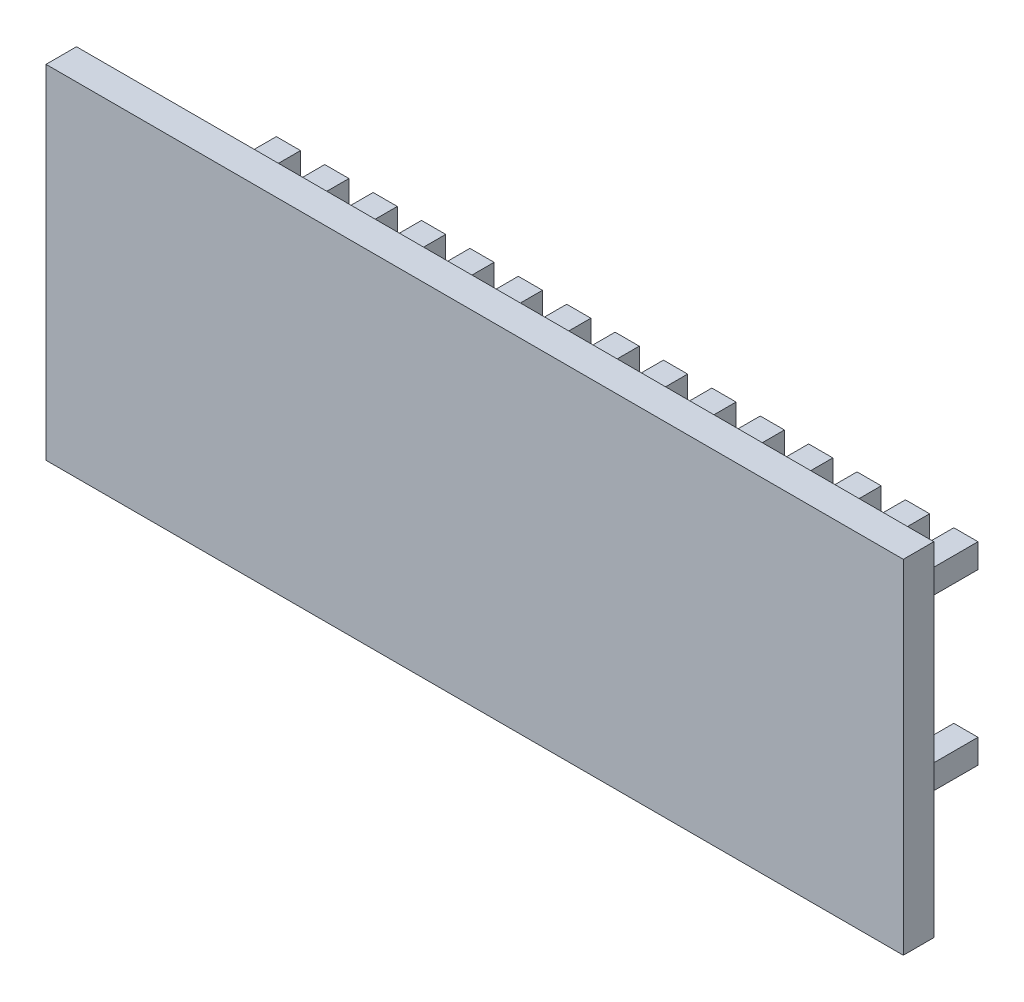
ISO-10303-21;
HEADER;
FILE_DESCRIPTION(('STEP AP214'),'2;1');
FILE_NAME('part.step','',(''),(''),'','','');
FILE_SCHEMA(('AUTOMOTIVE_DESIGN { 1 0 10303 214 1 1 1 1 }'));
ENDSEC;
DATA;
#1=APPLICATION_CONTEXT('core data for automotive mechanical design processes');
#2=APPLICATION_PROTOCOL_DEFINITION('international standard','automotive_design',2000,#1);
#3=PRODUCT_CONTEXT('',#1,'mechanical');
#4=PRODUCT('Part','Part','',(#3));
#5=PRODUCT_RELATED_PRODUCT_CATEGORY('part','',(#4));
#6=PRODUCT_DEFINITION_FORMATION('','',#4);
#7=PRODUCT_DEFINITION_CONTEXT('part definition',#1,'design');
#8=PRODUCT_DEFINITION('design','',#6,#7);
#9=PRODUCT_DEFINITION_SHAPE('','',#8);
#10=(LENGTH_UNIT() NAMED_UNIT(*) SI_UNIT(.MILLI.,.METRE.));
#11=(NAMED_UNIT(*) PLANE_ANGLE_UNIT() SI_UNIT($,.RADIAN.));
#12=(NAMED_UNIT(*) SI_UNIT($,.STERADIAN.) SOLID_ANGLE_UNIT());
#13=UNCERTAINTY_MEASURE_WITH_UNIT(LENGTH_MEASURE(1.E-05),#10,'distance_accuracy_value','');
#14=(GEOMETRIC_REPRESENTATION_CONTEXT(3) GLOBAL_UNCERTAINTY_ASSIGNED_CONTEXT((#13)) GLOBAL_UNIT_ASSIGNED_CONTEXT((#10,
#11,#12)) REPRESENTATION_CONTEXT('',''));
#15=CARTESIAN_POINT('',(0.,0.,0.));
#16=DIRECTION('',(0.,0.,1.));
#17=DIRECTION('',(1.,0.,0.));
#18=AXIS2_PLACEMENT_3D('',#15,#16,#17);
#19=CARTESIAN_POINT('',(0.,0.,0.));
#20=DIRECTION('',(0.,0.,1.));
#21=DIRECTION('',(1.,0.,0.));
#22=AXIS2_PLACEMENT_3D('',#19,#20,#21);
#23=PLANE('',#22);
#24=DIRECTION('',(-1.,0.,0.));
#25=VECTOR('',#24,1.);
#26=CARTESIAN_POINT('',(17.2,-5.08000000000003,0.));
#27=LINE('',#26,#25);
#28=CARTESIAN_POINT('',(17.2,-5.08000000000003,0.));
#29=VERTEX_POINT('',#28);
#30=CARTESIAN_POINT('',(15.93,-5.08000000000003,0.));
#31=VERTEX_POINT('',#30);
#32=EDGE_CURVE('E875',#29,#31,#27,.T.);
#33=ORIENTED_EDGE('',*,*,#32,.F.);
#34=DIRECTION('',(0.,-1.,0.));
#35=VECTOR('',#34,1.);
#36=CARTESIAN_POINT('',(17.2,-5.08000000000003,0.));
#37=LINE('',#36,#35);
#38=CARTESIAN_POINT('',(17.2,-3.81000000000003,0.));
#39=VERTEX_POINT('',#38);
#40=EDGE_CURVE('E862',#39,#29,#37,.T.);
#41=ORIENTED_EDGE('',*,*,#40,.F.);
#42=DIRECTION('',(1.,0.,0.));
#43=VECTOR('',#42,1.);
#44=CARTESIAN_POINT('',(17.2,-3.81000000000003,0.));
#45=LINE('',#44,#43);
#46=CARTESIAN_POINT('',(15.93,-3.81000000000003,0.));
#47=VERTEX_POINT('',#46);
#48=EDGE_CURVE('E866',#47,#39,#45,.T.);
#49=ORIENTED_EDGE('',*,*,#48,.F.);
#50=DIRECTION('',(0.,1.,0.));
#51=VECTOR('',#50,1.);
#52=CARTESIAN_POINT('',(15.93,-5.08000000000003,0.));
#53=LINE('',#52,#51);
#54=EDGE_CURVE('E871',#31,#47,#53,.T.);
#55=ORIENTED_EDGE('',*,*,#54,.F.);
#56=EDGE_LOOP('',(#33,#41,#49,#55));
#57=FACE_BOUND('',#56,.T.);
#58=DIRECTION('',(-1.,0.,0.));
#59=VECTOR('',#58,1.);
#60=CARTESIAN_POINT('',(12.12,-5.0800000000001,0.));
#61=LINE('',#60,#59);
#62=CARTESIAN_POINT('',(12.12,-5.0800000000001,0.));
#63=VERTEX_POINT('',#62);
#64=CARTESIAN_POINT('',(10.85,-5.0800000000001,0.));
#65=VERTEX_POINT('',#64);
#66=EDGE_CURVE('E965',#63,#65,#61,.T.);
#67=ORIENTED_EDGE('',*,*,#66,.F.);
#68=DIRECTION('',(0.,-1.,0.));
#69=VECTOR('',#68,1.);
#70=CARTESIAN_POINT('',(12.12,-5.0800000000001,0.));
#71=LINE('',#70,#69);
#72=CARTESIAN_POINT('',(12.12,-3.8100000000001,0.));
#73=VERTEX_POINT('',#72);
#74=EDGE_CURVE('E952',#73,#63,#71,.T.);
#75=ORIENTED_EDGE('',*,*,#74,.F.);
#76=DIRECTION('',(1.,0.,0.));
#77=VECTOR('',#76,1.);
#78=CARTESIAN_POINT('',(12.12,-3.8100000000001,0.));
#79=LINE('',#78,#77);
#80=CARTESIAN_POINT('',(10.85,-3.8100000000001,0.));
#81=VERTEX_POINT('',#80);
#82=EDGE_CURVE('E956',#81,#73,#79,.T.);
#83=ORIENTED_EDGE('',*,*,#82,.F.);
#84=DIRECTION('',(0.,1.,0.));
#85=VECTOR('',#84,1.);
#86=CARTESIAN_POINT('',(10.85,-5.0800000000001,0.));
#87=LINE('',#86,#85);
#88=EDGE_CURVE('E961',#65,#81,#87,.T.);
#89=ORIENTED_EDGE('',*,*,#88,.F.);
#90=EDGE_LOOP('',(#67,#75,#83,#89));
#91=FACE_BOUND('',#90,.T.);
#92=DIRECTION('',(-1.,0.,0.));
#93=VECTOR('',#92,1.);
#94=CARTESIAN_POINT('',(7.03999999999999,-5.08000000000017,0.));
#95=LINE('',#94,#93);
#96=CARTESIAN_POINT('',(7.03999999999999,-5.08000000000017,0.));
#97=VERTEX_POINT('',#96);
#98=CARTESIAN_POINT('',(5.76999999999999,-5.08000000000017,0.));
#99=VERTEX_POINT('',#98);
#100=EDGE_CURVE('E1055',#97,#99,#95,.T.);
#101=ORIENTED_EDGE('',*,*,#100,.F.);
#102=DIRECTION('',(0.,-1.,0.));
#103=VECTOR('',#102,1.);
#104=CARTESIAN_POINT('',(7.03999999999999,-5.08000000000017,0.));
#105=LINE('',#104,#103);
#106=CARTESIAN_POINT('',(7.03999999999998,-3.81000000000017,0.));
#107=VERTEX_POINT('',#106);
#108=EDGE_CURVE('E1042',#107,#97,#105,.T.);
#109=ORIENTED_EDGE('',*,*,#108,.F.);
#110=DIRECTION('',(1.,0.,0.));
#111=VECTOR('',#110,1.);
#112=CARTESIAN_POINT('',(7.03999999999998,-3.81000000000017,0.));
#113=LINE('',#112,#111);
#114=CARTESIAN_POINT('',(5.76999999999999,-3.81000000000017,0.));
#115=VERTEX_POINT('',#114);
#116=EDGE_CURVE('E1046',#115,#107,#113,.T.);
#117=ORIENTED_EDGE('',*,*,#116,.F.);
#118=DIRECTION('',(0.,1.,0.));
#119=VECTOR('',#118,1.);
#120=CARTESIAN_POINT('',(5.76999999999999,-5.08000000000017,0.));
#121=LINE('',#120,#119);
#122=EDGE_CURVE('E1051',#99,#115,#121,.T.);
#123=ORIENTED_EDGE('',*,*,#122,.F.);
#124=EDGE_LOOP('',(#101,#109,#117,#123));
#125=FACE_BOUND('',#124,.T.);
#126=DIRECTION('',(-1.,0.,0.));
#127=VECTOR('',#126,1.);
#128=CARTESIAN_POINT('',(1.95999999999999,-5.08000000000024,0.));
#129=LINE('',#128,#127);
#130=CARTESIAN_POINT('',(1.95999999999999,-5.08000000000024,0.));
#131=VERTEX_POINT('',#130);
#132=CARTESIAN_POINT('',(0.689999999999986,-5.08000000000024,0.));
#133=VERTEX_POINT('',#132);
#134=EDGE_CURVE('E1145',#131,#133,#129,.T.);
#135=ORIENTED_EDGE('',*,*,#134,.F.);
#136=DIRECTION('',(0.,-1.,0.));
#137=VECTOR('',#136,1.);
#138=CARTESIAN_POINT('',(1.95999999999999,-5.08000000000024,0.));
#139=LINE('',#138,#137);
#140=CARTESIAN_POINT('',(1.95999999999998,-3.81000000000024,0.));
#141=VERTEX_POINT('',#140);
#142=EDGE_CURVE('E1132',#141,#131,#139,.T.);
#143=ORIENTED_EDGE('',*,*,#142,.F.);
#144=DIRECTION('',(1.,0.,0.));
#145=VECTOR('',#144,1.);
#146=CARTESIAN_POINT('',(1.95999999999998,-3.81000000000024,0.));
#147=LINE('',#146,#145);
#148=CARTESIAN_POINT('',(0.689999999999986,-3.81000000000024,0.));
#149=VERTEX_POINT('',#148);
#150=EDGE_CURVE('E1136',#149,#141,#147,.T.);
#151=ORIENTED_EDGE('',*,*,#150,.F.);
#152=DIRECTION('',(0.,1.,0.));
#153=VECTOR('',#152,1.);
#154=CARTESIAN_POINT('',(0.689999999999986,-5.08000000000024,0.));
#155=LINE('',#154,#153);
#156=EDGE_CURVE('E1141',#133,#149,#155,.T.);
#157=ORIENTED_EDGE('',*,*,#156,.F.);
#158=EDGE_LOOP('',(#135,#143,#151,#157));
#159=FACE_BOUND('',#158,.T.);
#160=DIRECTION('',(-1.,0.,0.));
#161=VECTOR('',#160,1.);
#162=CARTESIAN_POINT('',(-3.12000000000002,-5.08000000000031,0.));
#163=LINE('',#162,#161);
#164=CARTESIAN_POINT('',(-3.12000000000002,-5.08000000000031,0.));
#165=VERTEX_POINT('',#164);
#166=CARTESIAN_POINT('',(-4.39000000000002,-5.08000000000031,0.));
#167=VERTEX_POINT('',#166);
#168=EDGE_CURVE('E1235',#165,#167,#163,.T.);
#169=ORIENTED_EDGE('',*,*,#168,.F.);
#170=DIRECTION('',(0.,-1.,0.));
#171=VECTOR('',#170,1.);
#172=CARTESIAN_POINT('',(-3.12000000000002,-5.08000000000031,0.));
#173=LINE('',#172,#171);
#174=CARTESIAN_POINT('',(-3.12000000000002,-3.81000000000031,0.));
#175=VERTEX_POINT('',#174);
#176=EDGE_CURVE('E1222',#175,#165,#173,.T.);
#177=ORIENTED_EDGE('',*,*,#176,.F.);
#178=DIRECTION('',(1.,0.,0.));
#179=VECTOR('',#178,1.);
#180=CARTESIAN_POINT('',(-3.12000000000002,-3.81000000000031,0.));
#181=LINE('',#180,#179);
#182=CARTESIAN_POINT('',(-4.39000000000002,-3.81000000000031,0.));
#183=VERTEX_POINT('',#182);
#184=EDGE_CURVE('E1226',#183,#175,#181,.T.);
#185=ORIENTED_EDGE('',*,*,#184,.F.);
#186=DIRECTION('',(0.,1.,0.));
#187=VECTOR('',#186,1.);
#188=CARTESIAN_POINT('',(-4.39000000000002,-5.08000000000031,0.));
#189=LINE('',#188,#187);
#190=EDGE_CURVE('E1231',#167,#183,#189,.T.);
#191=ORIENTED_EDGE('',*,*,#190,.F.);
#192=EDGE_LOOP('',(#169,#177,#185,#191));
#193=FACE_BOUND('',#192,.T.);
#194=DIRECTION('',(-1.,0.,0.));
#195=VECTOR('',#194,1.);
#196=CARTESIAN_POINT('',(-8.20000000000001,-5.08000000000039,0.));
#197=LINE('',#196,#195);
#198=CARTESIAN_POINT('',(-8.20000000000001,-5.08000000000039,0.));
#199=VERTEX_POINT('',#198);
#200=CARTESIAN_POINT('',(-9.47000000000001,-5.08000000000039,0.));
#201=VERTEX_POINT('',#200);
#202=EDGE_CURVE('E1325',#199,#201,#197,.T.);
#203=ORIENTED_EDGE('',*,*,#202,.F.);
#204=DIRECTION('',(0.,-1.,0.));
#205=VECTOR('',#204,1.);
#206=CARTESIAN_POINT('',(-8.20000000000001,-5.08000000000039,0.));
#207=LINE('',#206,#205);
#208=CARTESIAN_POINT('',(-8.20000000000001,-3.81000000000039,0.));
#209=VERTEX_POINT('',#208);
#210=EDGE_CURVE('E1312',#209,#199,#207,.T.);
#211=ORIENTED_EDGE('',*,*,#210,.F.);
#212=DIRECTION('',(1.,0.,0.));
#213=VECTOR('',#212,1.);
#214=CARTESIAN_POINT('',(-8.20000000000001,-3.81000000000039,0.));
#215=LINE('',#214,#213);
#216=CARTESIAN_POINT('',(-9.47000000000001,-3.81000000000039,0.));
#217=VERTEX_POINT('',#216);
#218=EDGE_CURVE('E1316',#217,#209,#215,.T.);
#219=ORIENTED_EDGE('',*,*,#218,.F.);
#220=DIRECTION('',(0.,1.,0.));
#221=VECTOR('',#220,1.);
#222=CARTESIAN_POINT('',(-9.47000000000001,-5.08000000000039,0.));
#223=LINE('',#222,#221);
#224=EDGE_CURVE('E1321',#201,#217,#223,.T.);
#225=ORIENTED_EDGE('',*,*,#224,.F.);
#226=EDGE_LOOP('',(#203,#211,#219,#225));
#227=FACE_BOUND('',#226,.T.);
#228=DIRECTION('',(-1.,0.,0.));
#229=VECTOR('',#228,1.);
#230=CARTESIAN_POINT('',(-13.28,-5.08000000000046,0.));
#231=LINE('',#230,#229);
#232=CARTESIAN_POINT('',(-13.28,-5.08000000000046,0.));
#233=VERTEX_POINT('',#232);
#234=CARTESIAN_POINT('',(-14.55,-5.08000000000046,0.));
#235=VERTEX_POINT('',#234);
#236=EDGE_CURVE('E1415',#233,#235,#231,.T.);
#237=ORIENTED_EDGE('',*,*,#236,.F.);
#238=DIRECTION('',(0.,-1.,0.));
#239=VECTOR('',#238,1.);
#240=CARTESIAN_POINT('',(-13.28,-5.08000000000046,0.));
#241=LINE('',#240,#239);
#242=CARTESIAN_POINT('',(-13.28,-3.81000000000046,0.));
#243=VERTEX_POINT('',#242);
#244=EDGE_CURVE('E1402',#243,#233,#241,.T.);
#245=ORIENTED_EDGE('',*,*,#244,.F.);
#246=DIRECTION('',(1.,0.,0.));
#247=VECTOR('',#246,1.);
#248=CARTESIAN_POINT('',(-13.28,-3.81000000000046,0.));
#249=LINE('',#248,#247);
#250=CARTESIAN_POINT('',(-14.55,-3.81000000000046,0.));
#251=VERTEX_POINT('',#250);
#252=EDGE_CURVE('E1406',#251,#243,#249,.T.);
#253=ORIENTED_EDGE('',*,*,#252,.F.);
#254=DIRECTION('',(0.,1.,0.));
#255=VECTOR('',#254,1.);
#256=CARTESIAN_POINT('',(-14.55,-5.08000000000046,0.));
#257=LINE('',#256,#255);
#258=EDGE_CURVE('E1411',#235,#251,#257,.T.);
#259=ORIENTED_EDGE('',*,*,#258,.F.);
#260=EDGE_LOOP('',(#237,#245,#253,#259));
#261=FACE_BOUND('',#260,.T.);
#262=DIRECTION('',(0.,-1.,0.));
#263=VECTOR('',#262,1.);
#264=CARTESIAN_POINT('',(-13.28,5.08000000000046,0.));
#265=LINE('',#264,#263);
#266=CARTESIAN_POINT('',(-13.28,5.08000000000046,0.));
#267=VERTEX_POINT('',#266);
#268=CARTESIAN_POINT('',(-13.28,3.81000000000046,0.));
#269=VERTEX_POINT('',#268);
#270=EDGE_CURVE('E1505',#267,#269,#265,.T.);
#271=ORIENTED_EDGE('',*,*,#270,.F.);
#272=DIRECTION('',(1.,0.,0.));
#273=VECTOR('',#272,1.);
#274=CARTESIAN_POINT('',(-13.28,5.08000000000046,0.));
#275=LINE('',#274,#273);
#276=CARTESIAN_POINT('',(-14.55,5.08000000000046,0.));
#277=VERTEX_POINT('',#276);
#278=EDGE_CURVE('E1492',#277,#267,#275,.T.);
#279=ORIENTED_EDGE('',*,*,#278,.F.);
#280=DIRECTION('',(0.,1.,0.));
#281=VECTOR('',#280,1.);
#282=CARTESIAN_POINT('',(-14.55,5.08000000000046,0.));
#283=LINE('',#282,#281);
#284=CARTESIAN_POINT('',(-14.55,3.81000000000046,0.));
#285=VERTEX_POINT('',#284);
#286=EDGE_CURVE('E1496',#285,#277,#283,.T.);
#287=ORIENTED_EDGE('',*,*,#286,.F.);
#288=DIRECTION('',(-1.,0.,0.));
#289=VECTOR('',#288,1.);
#290=CARTESIAN_POINT('',(-13.28,3.81000000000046,0.));
#291=LINE('',#290,#289);
#292=EDGE_CURVE('E1501',#269,#285,#291,.T.);
#293=ORIENTED_EDGE('',*,*,#292,.F.);
#294=EDGE_LOOP('',(#271,#279,#287,#293));
#295=FACE_BOUND('',#294,.T.);
#296=DIRECTION('',(0.,-1.,0.));
#297=VECTOR('',#296,1.);
#298=CARTESIAN_POINT('',(-8.2,5.08000000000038,0.));
#299=LINE('',#298,#297);
#300=CARTESIAN_POINT('',(-8.2,5.08000000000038,0.));
#301=VERTEX_POINT('',#300);
#302=CARTESIAN_POINT('',(-8.20000000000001,3.81000000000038,0.));
#303=VERTEX_POINT('',#302);
#304=EDGE_CURVE('E1595',#301,#303,#299,.T.);
#305=ORIENTED_EDGE('',*,*,#304,.F.);
#306=DIRECTION('',(1.,0.,0.));
#307=VECTOR('',#306,1.);
#308=CARTESIAN_POINT('',(-8.2,5.08000000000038,0.));
#309=LINE('',#308,#307);
#310=CARTESIAN_POINT('',(-9.47,5.08000000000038,0.));
#311=VERTEX_POINT('',#310);
#312=EDGE_CURVE('E1582',#311,#301,#309,.T.);
#313=ORIENTED_EDGE('',*,*,#312,.F.);
#314=DIRECTION('',(0.,1.,0.));
#315=VECTOR('',#314,1.);
#316=CARTESIAN_POINT('',(-9.47,5.08000000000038,0.));
#317=LINE('',#316,#315);
#318=CARTESIAN_POINT('',(-9.47,3.81000000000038,0.));
#319=VERTEX_POINT('',#318);
#320=EDGE_CURVE('E1586',#319,#311,#317,.T.);
#321=ORIENTED_EDGE('',*,*,#320,.F.);
#322=DIRECTION('',(-1.,0.,0.));
#323=VECTOR('',#322,1.);
#324=CARTESIAN_POINT('',(-8.20000000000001,3.81000000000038,0.));
#325=LINE('',#324,#323);
#326=EDGE_CURVE('E1591',#303,#319,#325,.T.);
#327=ORIENTED_EDGE('',*,*,#326,.F.);
#328=EDGE_LOOP('',(#305,#313,#321,#327));
#329=FACE_BOUND('',#328,.T.);
#330=DIRECTION('',(0.,-1.,0.));
#331=VECTOR('',#330,1.);
#332=CARTESIAN_POINT('',(-3.12,5.08000000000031,0.));
#333=LINE('',#332,#331);
#334=CARTESIAN_POINT('',(-3.12,5.08000000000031,0.));
#335=VERTEX_POINT('',#334);
#336=CARTESIAN_POINT('',(-3.12,3.81000000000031,0.));
#337=VERTEX_POINT('',#336);
#338=EDGE_CURVE('E1685',#335,#337,#333,.T.);
#339=ORIENTED_EDGE('',*,*,#338,.F.);
#340=DIRECTION('',(1.,0.,0.));
#341=VECTOR('',#340,1.);
#342=CARTESIAN_POINT('',(-3.12,5.08000000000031,0.));
#343=LINE('',#342,#341);
#344=CARTESIAN_POINT('',(-4.39,5.08000000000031,0.));
#345=VERTEX_POINT('',#344);
#346=EDGE_CURVE('E1672',#345,#335,#343,.T.);
#347=ORIENTED_EDGE('',*,*,#346,.F.);
#348=DIRECTION('',(0.,1.,0.));
#349=VECTOR('',#348,1.);
#350=CARTESIAN_POINT('',(-4.39,5.08000000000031,0.));
#351=LINE('',#350,#349);
#352=CARTESIAN_POINT('',(-4.39,3.81000000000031,0.));
#353=VERTEX_POINT('',#352);
#354=EDGE_CURVE('E1676',#353,#345,#351,.T.);
#355=ORIENTED_EDGE('',*,*,#354,.F.);
#356=DIRECTION('',(-1.,0.,0.));
#357=VECTOR('',#356,1.);
#358=CARTESIAN_POINT('',(-3.12,3.81000000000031,0.));
#359=LINE('',#358,#357);
#360=EDGE_CURVE('E1681',#337,#353,#359,.T.);
#361=ORIENTED_EDGE('',*,*,#360,.F.);
#362=EDGE_LOOP('',(#339,#347,#355,#361));
#363=FACE_BOUND('',#362,.T.);
#364=DIRECTION('',(0.,-1.,0.));
#365=VECTOR('',#364,1.);
#366=CARTESIAN_POINT('',(1.96,5.08000000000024,0.));
#367=LINE('',#366,#365);
#368=CARTESIAN_POINT('',(1.96,5.08000000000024,0.));
#369=VERTEX_POINT('',#368);
#370=CARTESIAN_POINT('',(1.96,3.81000000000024,0.));
#371=VERTEX_POINT('',#370);
#372=EDGE_CURVE('E1775',#369,#371,#367,.T.);
#373=ORIENTED_EDGE('',*,*,#372,.F.);
#374=DIRECTION('',(1.,0.,0.));
#375=VECTOR('',#374,1.);
#376=CARTESIAN_POINT('',(1.96,5.08000000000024,0.));
#377=LINE('',#376,#375);
#378=CARTESIAN_POINT('',(0.69,5.08000000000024,0.));
#379=VERTEX_POINT('',#378);
#380=EDGE_CURVE('E1762',#379,#369,#377,.T.);
#381=ORIENTED_EDGE('',*,*,#380,.F.);
#382=DIRECTION('',(0.,1.,0.));
#383=VECTOR('',#382,1.);
#384=CARTESIAN_POINT('',(0.69,5.08000000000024,0.));
#385=LINE('',#384,#383);
#386=CARTESIAN_POINT('',(0.69,3.81000000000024,0.));
#387=VERTEX_POINT('',#386);
#388=EDGE_CURVE('E1766',#387,#379,#385,.T.);
#389=ORIENTED_EDGE('',*,*,#388,.F.);
#390=DIRECTION('',(-1.,0.,0.));
#391=VECTOR('',#390,1.);
#392=CARTESIAN_POINT('',(1.96,3.81000000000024,0.));
#393=LINE('',#392,#391);
#394=EDGE_CURVE('E1771',#371,#387,#393,.T.);
#395=ORIENTED_EDGE('',*,*,#394,.F.);
#396=EDGE_LOOP('',(#373,#381,#389,#395));
#397=FACE_BOUND('',#396,.T.);
#398=DIRECTION('',(0.,-1.,0.));
#399=VECTOR('',#398,1.);
#400=CARTESIAN_POINT('',(7.04,5.08000000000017,0.));
#401=LINE('',#400,#399);
#402=CARTESIAN_POINT('',(7.04,5.08000000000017,0.));
#403=VERTEX_POINT('',#402);
#404=CARTESIAN_POINT('',(7.04,3.81000000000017,0.));
#405=VERTEX_POINT('',#404);
#406=EDGE_CURVE('E1865',#403,#405,#401,.T.);
#407=ORIENTED_EDGE('',*,*,#406,.F.);
#408=DIRECTION('',(1.,0.,0.));
#409=VECTOR('',#408,1.);
#410=CARTESIAN_POINT('',(7.04,5.08000000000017,0.));
#411=LINE('',#410,#409);
#412=CARTESIAN_POINT('',(5.77,5.08000000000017,0.));
#413=VERTEX_POINT('',#412);
#414=EDGE_CURVE('E1852',#413,#403,#411,.T.);
#415=ORIENTED_EDGE('',*,*,#414,.F.);
#416=DIRECTION('',(0.,1.,0.));
#417=VECTOR('',#416,1.);
#418=CARTESIAN_POINT('',(5.77,5.08000000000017,0.));
#419=LINE('',#418,#417);
#420=CARTESIAN_POINT('',(5.77,3.81000000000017,0.));
#421=VERTEX_POINT('',#420);
#422=EDGE_CURVE('E1856',#421,#413,#419,.T.);
#423=ORIENTED_EDGE('',*,*,#422,.F.);
#424=DIRECTION('',(-1.,0.,0.));
#425=VECTOR('',#424,1.);
#426=CARTESIAN_POINT('',(7.04,3.81000000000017,0.));
#427=LINE('',#426,#425);
#428=EDGE_CURVE('E1861',#405,#421,#427,.T.);
#429=ORIENTED_EDGE('',*,*,#428,.F.);
#430=EDGE_LOOP('',(#407,#415,#423,#429));
#431=FACE_BOUND('',#430,.T.);
#432=DIRECTION('',(0.,-1.,0.));
#433=VECTOR('',#432,1.);
#434=CARTESIAN_POINT('',(12.12,5.0800000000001,0.));
#435=LINE('',#434,#433);
#436=CARTESIAN_POINT('',(12.12,5.0800000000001,0.));
#437=VERTEX_POINT('',#436);
#438=CARTESIAN_POINT('',(12.12,3.8100000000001,0.));
#439=VERTEX_POINT('',#438);
#440=EDGE_CURVE('E1955',#437,#439,#435,.T.);
#441=ORIENTED_EDGE('',*,*,#440,.F.);
#442=DIRECTION('',(1.,0.,0.));
#443=VECTOR('',#442,1.);
#444=CARTESIAN_POINT('',(12.12,5.0800000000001,0.));
#445=LINE('',#444,#443);
#446=CARTESIAN_POINT('',(10.85,5.0800000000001,0.));
#447=VERTEX_POINT('',#446);
#448=EDGE_CURVE('E1942',#447,#437,#445,.T.);
#449=ORIENTED_EDGE('',*,*,#448,.F.);
#450=DIRECTION('',(0.,1.,0.));
#451=VECTOR('',#450,1.);
#452=CARTESIAN_POINT('',(10.85,5.0800000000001,0.));
#453=LINE('',#452,#451);
#454=CARTESIAN_POINT('',(10.85,3.8100000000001,0.));
#455=VERTEX_POINT('',#454);
#456=EDGE_CURVE('E1946',#455,#447,#453,.T.);
#457=ORIENTED_EDGE('',*,*,#456,.F.);
#458=DIRECTION('',(-1.,0.,0.));
#459=VECTOR('',#458,1.);
#460=CARTESIAN_POINT('',(12.12,3.8100000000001,0.));
#461=LINE('',#460,#459);
#462=EDGE_CURVE('E1951',#439,#455,#461,.T.);
#463=ORIENTED_EDGE('',*,*,#462,.F.);
#464=EDGE_LOOP('',(#441,#449,#457,#463));
#465=FACE_BOUND('',#464,.T.);
#466=DIRECTION('',(-1.,0.,0.));
#467=VECTOR('',#466,1.);
#468=CARTESIAN_POINT('',(-15.82,-5.08000000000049,0.));
#469=LINE('',#468,#467);
#470=CARTESIAN_POINT('',(-15.82,-5.08000000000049,0.));
#471=VERTEX_POINT('',#470);
#472=CARTESIAN_POINT('',(-17.09,-5.08000000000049,0.));
#473=VERTEX_POINT('',#472);
#474=EDGE_CURVE('E2045',#471,#473,#469,.T.);
#475=ORIENTED_EDGE('',*,*,#474,.F.);
#476=DIRECTION('',(0.,-1.,0.));
#477=VECTOR('',#476,1.);
#478=CARTESIAN_POINT('',(-15.82,-5.08000000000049,0.));
#479=LINE('',#478,#477);
#480=CARTESIAN_POINT('',(-15.82,-3.81000000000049,0.));
#481=VERTEX_POINT('',#480);
#482=EDGE_CURVE('E2032',#481,#471,#479,.T.);
#483=ORIENTED_EDGE('',*,*,#482,.F.);
#484=DIRECTION('',(1.,0.,0.));
#485=VECTOR('',#484,1.);
#486=CARTESIAN_POINT('',(-15.82,-3.81000000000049,0.));
#487=LINE('',#486,#485);
#488=CARTESIAN_POINT('',(-17.09,-3.81000000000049,0.));
#489=VERTEX_POINT('',#488);
#490=EDGE_CURVE('E2036',#489,#481,#487,.T.);
#491=ORIENTED_EDGE('',*,*,#490,.F.);
#492=DIRECTION('',(0.,1.,0.));
#493=VECTOR('',#492,1.);
#494=CARTESIAN_POINT('',(-17.09,-5.08000000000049,0.));
#495=LINE('',#494,#493);
#496=EDGE_CURVE('E2041',#473,#489,#495,.T.);
#497=ORIENTED_EDGE('',*,*,#496,.F.);
#498=EDGE_LOOP('',(#475,#483,#491,#497));
#499=FACE_BOUND('',#498,.T.);
#500=DIRECTION('',(0.,-1.,0.));
#501=VECTOR('',#500,1.);
#502=CARTESIAN_POINT('',(19.74,5.07999999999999,0.));
#503=LINE('',#502,#501);
#504=CARTESIAN_POINT('',(19.74,5.07999999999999,0.));
#505=VERTEX_POINT('',#504);
#506=CARTESIAN_POINT('',(19.74,3.80999999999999,0.));
#507=VERTEX_POINT('',#506);
#508=EDGE_CURVE('E2094',#505,#507,#503,.T.);
#509=ORIENTED_EDGE('',*,*,#508,.F.);
#510=DIRECTION('',(1.,0.,0.));
#511=VECTOR('',#510,1.);
#512=CARTESIAN_POINT('',(19.74,5.07999999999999,0.));
#513=LINE('',#512,#511);
#514=CARTESIAN_POINT('',(18.47,5.07999999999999,0.));
#515=VERTEX_POINT('',#514);
#516=EDGE_CURVE('E2111',#515,#505,#513,.T.);
#517=ORIENTED_EDGE('',*,*,#516,.F.);
#518=DIRECTION('',(0.,1.,0.));
#519=VECTOR('',#518,1.);
#520=CARTESIAN_POINT('',(18.47,5.07999999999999,0.));
#521=LINE('',#520,#519);
#522=CARTESIAN_POINT('',(18.47,3.80999999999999,0.));
#523=VERTEX_POINT('',#522);
#524=EDGE_CURVE('E2128',#523,#515,#521,.T.);
#525=ORIENTED_EDGE('',*,*,#524,.F.);
#526=DIRECTION('',(-1.,0.,0.));
#527=VECTOR('',#526,1.);
#528=CARTESIAN_POINT('',(19.74,3.80999999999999,0.));
#529=LINE('',#528,#527);
#530=EDGE_CURVE('E2124',#507,#523,#529,.T.);
#531=ORIENTED_EDGE('',*,*,#530,.F.);
#532=EDGE_LOOP('',(#509,#517,#525,#531));
#533=FACE_BOUND('',#532,.T.);
#534=DIRECTION('',(0.,1.,0.));
#535=VECTOR('',#534,1.);
#536=CARTESIAN_POINT('',(22.5,9.,0.));
#537=LINE('',#536,#535);
#538=CARTESIAN_POINT('',(22.5,-9.,0.));
#539=VERTEX_POINT('',#538);
#540=CARTESIAN_POINT('',(22.5,9.,0.));
#541=VERTEX_POINT('',#540);
#542=EDGE_CURVE('E2150',#539,#541,#537,.T.);
#543=ORIENTED_EDGE('',*,*,#542,.F.);
#544=DIRECTION('',(1.,0.,0.));
#545=VECTOR('',#544,1.);
#546=CARTESIAN_POINT('',(-22.5,-9.,0.));
#547=LINE('',#546,#545);
#548=CARTESIAN_POINT('',(-22.5,-9.,0.));
#549=VERTEX_POINT('',#548);
#550=EDGE_CURVE('E2156',#549,#539,#547,.T.);
#551=ORIENTED_EDGE('',*,*,#550,.F.);
#552=DIRECTION('',(0.,-1.,0.));
#553=VECTOR('',#552,1.);
#554=CARTESIAN_POINT('',(-22.5,9.,0.));
#555=LINE('',#554,#553);
#556=CARTESIAN_POINT('',(-22.5,9.,0.));
#557=VERTEX_POINT('',#556);
#558=EDGE_CURVE('E2172',#557,#549,#555,.T.);
#559=ORIENTED_EDGE('',*,*,#558,.F.);
#560=DIRECTION('',(-1.,0.,0.));
#561=VECTOR('',#560,1.);
#562=CARTESIAN_POINT('',(-22.5,9.,0.));
#563=LINE('',#562,#561);
#564=EDGE_CURVE('E2169',#541,#557,#563,.T.);
#565=ORIENTED_EDGE('',*,*,#564,.F.);
#566=EDGE_LOOP('',(#543,#551,#559,#565));
#567=FACE_BOUND('',#566,.T.);
#568=DIRECTION('',(0.,-1.,0.));
#569=VECTOR('',#568,1.);
#570=CARTESIAN_POINT('',(17.2,5.08000000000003,0.));
#571=LINE('',#570,#569);
#572=CARTESIAN_POINT('',(17.2,5.08000000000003,0.));
#573=VERTEX_POINT('',#572);
#574=CARTESIAN_POINT('',(17.2,3.81000000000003,0.));
#575=VERTEX_POINT('',#574);
#576=EDGE_CURVE('E2090',#573,#575,#571,.T.);
#577=ORIENTED_EDGE('',*,*,#576,.F.);
#578=DIRECTION('',(1.,0.,0.));
#579=VECTOR('',#578,1.);
#580=CARTESIAN_POINT('',(17.2,5.08000000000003,0.));
#581=LINE('',#580,#579);
#582=CARTESIAN_POINT('',(15.93,5.08000000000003,0.));
#583=VERTEX_POINT('',#582);
#584=EDGE_CURVE('E2077',#583,#573,#581,.T.);
#585=ORIENTED_EDGE('',*,*,#584,.F.);
#586=DIRECTION('',(0.,1.,0.));
#587=VECTOR('',#586,1.);
#588=CARTESIAN_POINT('',(15.93,5.08000000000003,0.));
#589=LINE('',#588,#587);
#590=CARTESIAN_POINT('',(15.93,3.81000000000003,0.));
#591=VERTEX_POINT('',#590);
#592=EDGE_CURVE('E2081',#591,#583,#589,.T.);
#593=ORIENTED_EDGE('',*,*,#592,.F.);
#594=DIRECTION('',(-1.,0.,0.));
#595=VECTOR('',#594,1.);
#596=CARTESIAN_POINT('',(17.2,3.81000000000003,0.));
#597=LINE('',#596,#595);
#598=EDGE_CURVE('E2086',#575,#591,#597,.T.);
#599=ORIENTED_EDGE('',*,*,#598,.F.);
#600=EDGE_LOOP('',(#577,#585,#593,#599));
#601=FACE_BOUND('',#600,.T.);
#602=DIRECTION('',(0.,-1.,0.));
#603=VECTOR('',#602,1.);
#604=CARTESIAN_POINT('',(14.66,5.08000000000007,0.));
#605=LINE('',#604,#603);
#606=CARTESIAN_POINT('',(14.66,5.08000000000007,0.));
#607=VERTEX_POINT('',#606);
#608=CARTESIAN_POINT('',(14.66,3.81000000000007,0.));
#609=VERTEX_POINT('',#608);
#610=EDGE_CURVE('E2000',#607,#609,#605,.T.);
#611=ORIENTED_EDGE('',*,*,#610,.F.);
#612=DIRECTION('',(1.,0.,0.));
#613=VECTOR('',#612,1.);
#614=CARTESIAN_POINT('',(14.66,5.08000000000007,0.));
#615=LINE('',#614,#613);
#616=CARTESIAN_POINT('',(13.39,5.08000000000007,0.));
#617=VERTEX_POINT('',#616);
#618=EDGE_CURVE('E1987',#617,#607,#615,.T.);
#619=ORIENTED_EDGE('',*,*,#618,.F.);
#620=DIRECTION('',(0.,1.,0.));
#621=VECTOR('',#620,1.);
#622=CARTESIAN_POINT('',(13.39,5.08000000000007,0.));
#623=LINE('',#622,#621);
#624=CARTESIAN_POINT('',(13.39,3.81000000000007,0.));
#625=VERTEX_POINT('',#624);
#626=EDGE_CURVE('E1991',#625,#617,#623,.T.);
#627=ORIENTED_EDGE('',*,*,#626,.F.);
#628=DIRECTION('',(-1.,0.,0.));
#629=VECTOR('',#628,1.);
#630=CARTESIAN_POINT('',(14.66,3.81000000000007,0.));
#631=LINE('',#630,#629);
#632=EDGE_CURVE('E1996',#609,#625,#631,.T.);
#633=ORIENTED_EDGE('',*,*,#632,.F.);
#634=EDGE_LOOP('',(#611,#619,#627,#633));
#635=FACE_BOUND('',#634,.T.);
#636=DIRECTION('',(0.,-1.,0.));
#637=VECTOR('',#636,1.);
#638=CARTESIAN_POINT('',(9.58,5.08000000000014,0.));
#639=LINE('',#638,#637);
#640=CARTESIAN_POINT('',(9.58,5.08000000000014,0.));
#641=VERTEX_POINT('',#640);
#642=CARTESIAN_POINT('',(9.58,3.81000000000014,0.));
#643=VERTEX_POINT('',#642);
#644=EDGE_CURVE('E1910',#641,#643,#639,.T.);
#645=ORIENTED_EDGE('',*,*,#644,.F.);
#646=DIRECTION('',(1.,0.,0.));
#647=VECTOR('',#646,1.);
#648=CARTESIAN_POINT('',(9.58,5.08000000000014,0.));
#649=LINE('',#648,#647);
#650=CARTESIAN_POINT('',(8.31,5.08000000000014,0.));
#651=VERTEX_POINT('',#650);
#652=EDGE_CURVE('E1897',#651,#641,#649,.T.);
#653=ORIENTED_EDGE('',*,*,#652,.F.);
#654=DIRECTION('',(0.,1.,0.));
#655=VECTOR('',#654,1.);
#656=CARTESIAN_POINT('',(8.31,5.08000000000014,0.));
#657=LINE('',#656,#655);
#658=CARTESIAN_POINT('',(8.31,3.81000000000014,0.));
#659=VERTEX_POINT('',#658);
#660=EDGE_CURVE('E1901',#659,#651,#657,.T.);
#661=ORIENTED_EDGE('',*,*,#660,.F.);
#662=DIRECTION('',(-1.,0.,0.));
#663=VECTOR('',#662,1.);
#664=CARTESIAN_POINT('',(9.58,3.81000000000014,0.));
#665=LINE('',#664,#663);
#666=EDGE_CURVE('E1906',#643,#659,#665,.T.);
#667=ORIENTED_EDGE('',*,*,#666,.F.);
#668=EDGE_LOOP('',(#645,#653,#661,#667));
#669=FACE_BOUND('',#668,.T.);
#670=DIRECTION('',(0.,-1.,0.));
#671=VECTOR('',#670,1.);
#672=CARTESIAN_POINT('',(4.5,5.08000000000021,0.));
#673=LINE('',#672,#671);
#674=CARTESIAN_POINT('',(4.5,5.08000000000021,0.));
#675=VERTEX_POINT('',#674);
#676=CARTESIAN_POINT('',(4.5,3.81000000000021,0.));
#677=VERTEX_POINT('',#676);
#678=EDGE_CURVE('E1820',#675,#677,#673,.T.);
#679=ORIENTED_EDGE('',*,*,#678,.F.);
#680=DIRECTION('',(1.,0.,0.));
#681=VECTOR('',#680,1.);
#682=CARTESIAN_POINT('',(4.5,5.08000000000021,0.));
#683=LINE('',#682,#681);
#684=CARTESIAN_POINT('',(3.23,5.08000000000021,0.));
#685=VERTEX_POINT('',#684);
#686=EDGE_CURVE('E1807',#685,#675,#683,.T.);
#687=ORIENTED_EDGE('',*,*,#686,.F.);
#688=DIRECTION('',(0.,1.,0.));
#689=VECTOR('',#688,1.);
#690=CARTESIAN_POINT('',(3.23,5.08000000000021,0.));
#691=LINE('',#690,#689);
#692=CARTESIAN_POINT('',(3.23,3.81000000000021,0.));
#693=VERTEX_POINT('',#692);
#694=EDGE_CURVE('E1811',#693,#685,#691,.T.);
#695=ORIENTED_EDGE('',*,*,#694,.F.);
#696=DIRECTION('',(-1.,0.,0.));
#697=VECTOR('',#696,1.);
#698=CARTESIAN_POINT('',(4.5,3.81000000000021,0.));
#699=LINE('',#698,#697);
#700=EDGE_CURVE('E1816',#677,#693,#699,.T.);
#701=ORIENTED_EDGE('',*,*,#700,.F.);
#702=EDGE_LOOP('',(#679,#687,#695,#701));
#703=FACE_BOUND('',#702,.T.);
#704=DIRECTION('',(0.,-1.,0.));
#705=VECTOR('',#704,1.);
#706=CARTESIAN_POINT('',(-0.580000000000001,5.08000000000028,0.));
#707=LINE('',#706,#705);
#708=CARTESIAN_POINT('',(-0.580000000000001,5.08000000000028,0.));
#709=VERTEX_POINT('',#708);
#710=CARTESIAN_POINT('',(-0.580000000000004,3.81000000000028,0.));
#711=VERTEX_POINT('',#710);
#712=EDGE_CURVE('E1730',#709,#711,#707,.T.);
#713=ORIENTED_EDGE('',*,*,#712,.F.);
#714=DIRECTION('',(1.,0.,0.));
#715=VECTOR('',#714,1.);
#716=CARTESIAN_POINT('',(-0.580000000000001,5.08000000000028,0.));
#717=LINE('',#716,#715);
#718=CARTESIAN_POINT('',(-1.85,5.08000000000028,0.));
#719=VERTEX_POINT('',#718);
#720=EDGE_CURVE('E1717',#719,#709,#717,.T.);
#721=ORIENTED_EDGE('',*,*,#720,.F.);
#722=DIRECTION('',(0.,1.,0.));
#723=VECTOR('',#722,1.);
#724=CARTESIAN_POINT('',(-1.85,5.08000000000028,0.));
#725=LINE('',#724,#723);
#726=CARTESIAN_POINT('',(-1.85,3.81000000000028,0.));
#727=VERTEX_POINT('',#726);
#728=EDGE_CURVE('E1721',#727,#719,#725,.T.);
#729=ORIENTED_EDGE('',*,*,#728,.F.);
#730=DIRECTION('',(-1.,0.,0.));
#731=VECTOR('',#730,1.);
#732=CARTESIAN_POINT('',(-0.580000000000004,3.81000000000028,0.));
#733=LINE('',#732,#731);
#734=EDGE_CURVE('E1726',#711,#727,#733,.T.);
#735=ORIENTED_EDGE('',*,*,#734,.F.);
#736=EDGE_LOOP('',(#713,#721,#729,#735));
#737=FACE_BOUND('',#736,.T.);
#738=DIRECTION('',(0.,-1.,0.));
#739=VECTOR('',#738,1.);
#740=CARTESIAN_POINT('',(-5.66,5.08000000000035,0.));
#741=LINE('',#740,#739);
#742=CARTESIAN_POINT('',(-5.66,5.08000000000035,0.));
#743=VERTEX_POINT('',#742);
#744=CARTESIAN_POINT('',(-5.66000000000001,3.81000000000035,0.));
#745=VERTEX_POINT('',#744);
#746=EDGE_CURVE('E1640',#743,#745,#741,.T.);
#747=ORIENTED_EDGE('',*,*,#746,.F.);
#748=DIRECTION('',(1.,0.,0.));
#749=VECTOR('',#748,1.);
#750=CARTESIAN_POINT('',(-5.66,5.08000000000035,0.));
#751=LINE('',#750,#749);
#752=CARTESIAN_POINT('',(-6.93,5.08000000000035,0.));
#753=VERTEX_POINT('',#752);
#754=EDGE_CURVE('E1627',#753,#743,#751,.T.);
#755=ORIENTED_EDGE('',*,*,#754,.F.);
#756=DIRECTION('',(0.,1.,0.));
#757=VECTOR('',#756,1.);
#758=CARTESIAN_POINT('',(-6.93,5.08000000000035,0.));
#759=LINE('',#758,#757);
#760=CARTESIAN_POINT('',(-6.93,3.81000000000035,0.));
#761=VERTEX_POINT('',#760);
#762=EDGE_CURVE('E1631',#761,#753,#759,.T.);
#763=ORIENTED_EDGE('',*,*,#762,.F.);
#764=DIRECTION('',(-1.,0.,0.));
#765=VECTOR('',#764,1.);
#766=CARTESIAN_POINT('',(-5.66000000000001,3.81000000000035,0.));
#767=LINE('',#766,#765);
#768=EDGE_CURVE('E1636',#745,#761,#767,.T.);
#769=ORIENTED_EDGE('',*,*,#768,.F.);
#770=EDGE_LOOP('',(#747,#755,#763,#769));
#771=FACE_BOUND('',#770,.T.);
#772=DIRECTION('',(0.,-1.,0.));
#773=VECTOR('',#772,1.);
#774=CARTESIAN_POINT('',(-10.74,5.08000000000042,0.));
#775=LINE('',#774,#773);
#776=CARTESIAN_POINT('',(-10.74,5.08000000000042,0.));
#777=VERTEX_POINT('',#776);
#778=CARTESIAN_POINT('',(-10.74,3.81000000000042,0.));
#779=VERTEX_POINT('',#778);
#780=EDGE_CURVE('E1550',#777,#779,#775,.T.);
#781=ORIENTED_EDGE('',*,*,#780,.F.);
#782=DIRECTION('',(1.,0.,0.));
#783=VECTOR('',#782,1.);
#784=CARTESIAN_POINT('',(-10.74,5.08000000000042,0.));
#785=LINE('',#784,#783);
#786=CARTESIAN_POINT('',(-12.01,5.08000000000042,0.));
#787=VERTEX_POINT('',#786);
#788=EDGE_CURVE('E1537',#787,#777,#785,.T.);
#789=ORIENTED_EDGE('',*,*,#788,.F.);
#790=DIRECTION('',(0.,1.,0.));
#791=VECTOR('',#790,1.);
#792=CARTESIAN_POINT('',(-12.01,5.08000000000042,0.));
#793=LINE('',#792,#791);
#794=CARTESIAN_POINT('',(-12.01,3.81000000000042,0.));
#795=VERTEX_POINT('',#794);
#796=EDGE_CURVE('E1541',#795,#787,#793,.T.);
#797=ORIENTED_EDGE('',*,*,#796,.F.);
#798=DIRECTION('',(-1.,0.,0.));
#799=VECTOR('',#798,1.);
#800=CARTESIAN_POINT('',(-10.74,3.81000000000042,0.));
#801=LINE('',#800,#799);
#802=EDGE_CURVE('E1546',#779,#795,#801,.T.);
#803=ORIENTED_EDGE('',*,*,#802,.F.);
#804=EDGE_LOOP('',(#781,#789,#797,#803));
#805=FACE_BOUND('',#804,.T.);
#806=DIRECTION('',(0.,-1.,0.));
#807=VECTOR('',#806,1.);
#808=CARTESIAN_POINT('',(-15.82,5.08000000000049,0.));
#809=LINE('',#808,#807);
#810=CARTESIAN_POINT('',(-15.82,5.08000000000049,0.));
#811=VERTEX_POINT('',#810);
#812=CARTESIAN_POINT('',(-15.82,3.81000000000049,0.));
#813=VERTEX_POINT('',#812);
#814=EDGE_CURVE('E1460',#811,#813,#809,.T.);
#815=ORIENTED_EDGE('',*,*,#814,.F.);
#816=DIRECTION('',(1.,0.,0.));
#817=VECTOR('',#816,1.);
#818=CARTESIAN_POINT('',(-15.82,5.08000000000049,0.));
#819=LINE('',#818,#817);
#820=CARTESIAN_POINT('',(-17.09,5.08000000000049,0.));
#821=VERTEX_POINT('',#820);
#822=EDGE_CURVE('E1447',#821,#811,#819,.T.);
#823=ORIENTED_EDGE('',*,*,#822,.F.);
#824=DIRECTION('',(0.,1.,0.));
#825=VECTOR('',#824,1.);
#826=CARTESIAN_POINT('',(-17.09,5.08000000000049,0.));
#827=LINE('',#826,#825);
#828=CARTESIAN_POINT('',(-17.09,3.81000000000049,0.));
#829=VERTEX_POINT('',#828);
#830=EDGE_CURVE('E1451',#829,#821,#827,.T.);
#831=ORIENTED_EDGE('',*,*,#830,.F.);
#832=DIRECTION('',(-1.,0.,0.));
#833=VECTOR('',#832,1.);
#834=CARTESIAN_POINT('',(-15.82,3.81000000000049,0.));
#835=LINE('',#834,#833);
#836=EDGE_CURVE('E1456',#813,#829,#835,.T.);
#837=ORIENTED_EDGE('',*,*,#836,.F.);
#838=EDGE_LOOP('',(#815,#823,#831,#837));
#839=FACE_BOUND('',#838,.T.);
#840=DIRECTION('',(-1.,0.,0.));
#841=VECTOR('',#840,1.);
#842=CARTESIAN_POINT('',(-10.74,-5.08000000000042,0.));
#843=LINE('',#842,#841);
#844=CARTESIAN_POINT('',(-10.74,-5.08000000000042,0.));
#845=VERTEX_POINT('',#844);
#846=CARTESIAN_POINT('',(-12.01,-5.08000000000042,0.));
#847=VERTEX_POINT('',#846);
#848=EDGE_CURVE('E1370',#845,#847,#843,.T.);
#849=ORIENTED_EDGE('',*,*,#848,.F.);
#850=DIRECTION('',(0.,-1.,0.));
#851=VECTOR('',#850,1.);
#852=CARTESIAN_POINT('',(-10.74,-5.08000000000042,0.));
#853=LINE('',#852,#851);
#854=CARTESIAN_POINT('',(-10.74,-3.81000000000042,0.));
#855=VERTEX_POINT('',#854);
#856=EDGE_CURVE('E1357',#855,#845,#853,.T.);
#857=ORIENTED_EDGE('',*,*,#856,.F.);
#858=DIRECTION('',(1.,0.,0.));
#859=VECTOR('',#858,1.);
#860=CARTESIAN_POINT('',(-10.74,-3.81000000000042,0.));
#861=LINE('',#860,#859);
#862=CARTESIAN_POINT('',(-12.01,-3.81000000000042,0.));
#863=VERTEX_POINT('',#862);
#864=EDGE_CURVE('E1361',#863,#855,#861,.T.);
#865=ORIENTED_EDGE('',*,*,#864,.F.);
#866=DIRECTION('',(0.,1.,0.));
#867=VECTOR('',#866,1.);
#868=CARTESIAN_POINT('',(-12.01,-5.08000000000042,0.));
#869=LINE('',#868,#867);
#870=EDGE_CURVE('E1366',#847,#863,#869,.T.);
#871=ORIENTED_EDGE('',*,*,#870,.F.);
#872=EDGE_LOOP('',(#849,#857,#865,#871));
#873=FACE_BOUND('',#872,.T.);
#874=DIRECTION('',(-1.,0.,0.));
#875=VECTOR('',#874,1.);
#876=CARTESIAN_POINT('',(-5.66000000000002,-5.08000000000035,0.));
#877=LINE('',#876,#875);
#878=CARTESIAN_POINT('',(-5.66000000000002,-5.08000000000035,0.));
#879=VERTEX_POINT('',#878);
#880=CARTESIAN_POINT('',(-6.93000000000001,-5.08000000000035,0.));
#881=VERTEX_POINT('',#880);
#882=EDGE_CURVE('E1280',#879,#881,#877,.T.);
#883=ORIENTED_EDGE('',*,*,#882,.F.);
#884=DIRECTION('',(0.,-1.,0.));
#885=VECTOR('',#884,1.);
#886=CARTESIAN_POINT('',(-5.66000000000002,-5.08000000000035,0.));
#887=LINE('',#886,#885);
#888=CARTESIAN_POINT('',(-5.66000000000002,-3.81000000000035,0.));
#889=VERTEX_POINT('',#888);
#890=EDGE_CURVE('E1267',#889,#879,#887,.T.);
#891=ORIENTED_EDGE('',*,*,#890,.F.);
#892=DIRECTION('',(1.,0.,0.));
#893=VECTOR('',#892,1.);
#894=CARTESIAN_POINT('',(-5.66000000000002,-3.81000000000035,0.));
#895=LINE('',#894,#893);
#896=CARTESIAN_POINT('',(-6.93000000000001,-3.81000000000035,0.));
#897=VERTEX_POINT('',#896);
#898=EDGE_CURVE('E1271',#897,#889,#895,.T.);
#899=ORIENTED_EDGE('',*,*,#898,.F.);
#900=DIRECTION('',(0.,1.,0.));
#901=VECTOR('',#900,1.);
#902=CARTESIAN_POINT('',(-6.93000000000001,-5.08000000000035,0.));
#903=LINE('',#902,#901);
#904=EDGE_CURVE('E1276',#881,#897,#903,.T.);
#905=ORIENTED_EDGE('',*,*,#904,.F.);
#906=EDGE_LOOP('',(#883,#891,#899,#905));
#907=FACE_BOUND('',#906,.T.);
#908=DIRECTION('',(-1.,0.,0.));
#909=VECTOR('',#908,1.);
#910=CARTESIAN_POINT('',(-0.580000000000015,-5.08000000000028,0.));
#911=LINE('',#910,#909);
#912=CARTESIAN_POINT('',(-0.580000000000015,-5.08000000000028,0.));
#913=VERTEX_POINT('',#912);
#914=CARTESIAN_POINT('',(-1.85000000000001,-5.08000000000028,0.));
#915=VERTEX_POINT('',#914);
#916=EDGE_CURVE('E1190',#913,#915,#911,.T.);
#917=ORIENTED_EDGE('',*,*,#916,.F.);
#918=DIRECTION('',(0.,-1.,0.));
#919=VECTOR('',#918,1.);
#920=CARTESIAN_POINT('',(-0.580000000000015,-5.08000000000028,0.));
#921=LINE('',#920,#919);
#922=CARTESIAN_POINT('',(-0.580000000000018,-3.81000000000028,0.));
#923=VERTEX_POINT('',#922);
#924=EDGE_CURVE('E1177',#923,#913,#921,.T.);
#925=ORIENTED_EDGE('',*,*,#924,.F.);
#926=DIRECTION('',(1.,0.,0.));
#927=VECTOR('',#926,1.);
#928=CARTESIAN_POINT('',(-0.580000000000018,-3.81000000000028,0.));
#929=LINE('',#928,#927);
#930=CARTESIAN_POINT('',(-1.85000000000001,-3.81000000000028,0.));
#931=VERTEX_POINT('',#930);
#932=EDGE_CURVE('E1181',#931,#923,#929,.T.);
#933=ORIENTED_EDGE('',*,*,#932,.F.);
#934=DIRECTION('',(0.,1.,0.));
#935=VECTOR('',#934,1.);
#936=CARTESIAN_POINT('',(-1.85000000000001,-5.08000000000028,0.));
#937=LINE('',#936,#935);
#938=EDGE_CURVE('E1186',#915,#931,#937,.T.);
#939=ORIENTED_EDGE('',*,*,#938,.F.);
#940=EDGE_LOOP('',(#917,#925,#933,#939));
#941=FACE_BOUND('',#940,.T.);
#942=DIRECTION('',(-1.,0.,0.));
#943=VECTOR('',#942,1.);
#944=CARTESIAN_POINT('',(4.49999999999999,-5.08000000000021,0.));
#945=LINE('',#944,#943);
#946=CARTESIAN_POINT('',(4.49999999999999,-5.08000000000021,0.));
#947=VERTEX_POINT('',#946);
#948=CARTESIAN_POINT('',(3.22999999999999,-5.08000000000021,0.));
#949=VERTEX_POINT('',#948);
#950=EDGE_CURVE('E1100',#947,#949,#945,.T.);
#951=ORIENTED_EDGE('',*,*,#950,.F.);
#952=DIRECTION('',(0.,-1.,0.));
#953=VECTOR('',#952,1.);
#954=CARTESIAN_POINT('',(4.49999999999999,-5.08000000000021,0.));
#955=LINE('',#954,#953);
#956=CARTESIAN_POINT('',(4.49999999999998,-3.81000000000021,0.));
#957=VERTEX_POINT('',#956);
#958=EDGE_CURVE('E1087',#957,#947,#955,.T.);
#959=ORIENTED_EDGE('',*,*,#958,.F.);
#960=DIRECTION('',(1.,0.,0.));
#961=VECTOR('',#960,1.);
#962=CARTESIAN_POINT('',(4.49999999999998,-3.81000000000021,0.));
#963=LINE('',#962,#961);
#964=CARTESIAN_POINT('',(3.22999999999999,-3.81000000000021,0.));
#965=VERTEX_POINT('',#964);
#966=EDGE_CURVE('E1091',#965,#957,#963,.T.);
#967=ORIENTED_EDGE('',*,*,#966,.F.);
#968=DIRECTION('',(0.,1.,0.));
#969=VECTOR('',#968,1.);
#970=CARTESIAN_POINT('',(3.22999999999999,-5.08000000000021,0.));
#971=LINE('',#970,#969);
#972=EDGE_CURVE('E1096',#949,#965,#971,.T.);
#973=ORIENTED_EDGE('',*,*,#972,.F.);
#974=EDGE_LOOP('',(#951,#959,#967,#973));
#975=FACE_BOUND('',#974,.T.);
#976=DIRECTION('',(-1.,0.,0.));
#977=VECTOR('',#976,1.);
#978=CARTESIAN_POINT('',(9.57999999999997,-5.08000000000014,0.));
#979=LINE('',#978,#977);
#980=CARTESIAN_POINT('',(9.57999999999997,-5.08000000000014,0.));
#981=VERTEX_POINT('',#980);
#982=CARTESIAN_POINT('',(8.30999999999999,-5.08000000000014,0.));
#983=VERTEX_POINT('',#982);
#984=EDGE_CURVE('E1010',#981,#983,#979,.T.);
#985=ORIENTED_EDGE('',*,*,#984,.F.);
#986=DIRECTION('',(0.,-1.,0.));
#987=VECTOR('',#986,1.);
#988=CARTESIAN_POINT('',(9.57999999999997,-5.08000000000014,0.));
#989=LINE('',#988,#987);
#990=CARTESIAN_POINT('',(9.57999999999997,-3.81000000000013,0.));
#991=VERTEX_POINT('',#990);
#992=EDGE_CURVE('E997',#991,#981,#989,.T.);
#993=ORIENTED_EDGE('',*,*,#992,.F.);
#994=DIRECTION('',(1.,0.,0.));
#995=VECTOR('',#994,1.);
#996=CARTESIAN_POINT('',(9.57999999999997,-3.81000000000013,0.));
#997=LINE('',#996,#995);
#998=CARTESIAN_POINT('',(8.30999999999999,-3.81000000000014,0.));
#999=VERTEX_POINT('',#998);
#1000=EDGE_CURVE('E1001',#999,#991,#997,.T.);
#1001=ORIENTED_EDGE('',*,*,#1000,.F.);
#1002=DIRECTION('',(0.,1.,0.));
#1003=VECTOR('',#1002,1.);
#1004=CARTESIAN_POINT('',(8.30999999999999,-5.08000000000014,0.));
#1005=LINE('',#1004,#1003);
#1006=EDGE_CURVE('E1006',#983,#999,#1005,.T.);
#1007=ORIENTED_EDGE('',*,*,#1006,.F.);
#1008=EDGE_LOOP('',(#985,#993,#1001,#1007));
#1009=FACE_BOUND('',#1008,.T.);
#1010=DIRECTION('',(-1.,0.,0.));
#1011=VECTOR('',#1010,1.);
#1012=CARTESIAN_POINT('',(14.66,-5.08000000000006,0.));
#1013=LINE('',#1012,#1011);
#1014=CARTESIAN_POINT('',(14.66,-5.08000000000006,0.));
#1015=VERTEX_POINT('',#1014);
#1016=CARTESIAN_POINT('',(13.39,-5.08000000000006,0.));
#1017=VERTEX_POINT('',#1016);
#1018=EDGE_CURVE('E920',#1015,#1017,#1013,.T.);
#1019=ORIENTED_EDGE('',*,*,#1018,.F.);
#1020=DIRECTION('',(0.,-1.,0.));
#1021=VECTOR('',#1020,1.);
#1022=CARTESIAN_POINT('',(14.66,-5.08000000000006,0.));
#1023=LINE('',#1022,#1021);
#1024=CARTESIAN_POINT('',(14.66,-3.81000000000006,0.));
#1025=VERTEX_POINT('',#1024);
#1026=EDGE_CURVE('E907',#1025,#1015,#1023,.T.);
#1027=ORIENTED_EDGE('',*,*,#1026,.F.);
#1028=DIRECTION('',(1.,0.,0.));
#1029=VECTOR('',#1028,1.);
#1030=CARTESIAN_POINT('',(14.66,-3.81000000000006,0.));
#1031=LINE('',#1030,#1029);
#1032=CARTESIAN_POINT('',(13.39,-3.81000000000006,0.));
#1033=VERTEX_POINT('',#1032);
#1034=EDGE_CURVE('E911',#1033,#1025,#1031,.T.);
#1035=ORIENTED_EDGE('',*,*,#1034,.F.);
#1036=DIRECTION('',(0.,1.,0.));
#1037=VECTOR('',#1036,1.);
#1038=CARTESIAN_POINT('',(13.39,-5.08000000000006,0.));
#1039=LINE('',#1038,#1037);
#1040=EDGE_CURVE('E916',#1017,#1033,#1039,.T.);
#1041=ORIENTED_EDGE('',*,*,#1040,.F.);
#1042=EDGE_LOOP('',(#1019,#1027,#1035,#1041));
#1043=FACE_BOUND('',#1042,.T.);
#1044=DIRECTION('',(-1.,0.,0.));
#1045=VECTOR('',#1044,1.);
#1046=CARTESIAN_POINT('',(19.74,-5.07999999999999,0.));
#1047=LINE('',#1046,#1045);
#1048=CARTESIAN_POINT('',(19.74,-5.07999999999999,0.));
#1049=VERTEX_POINT('',#1048);
#1050=CARTESIAN_POINT('',(18.47,-5.07999999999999,0.));
#1051=VERTEX_POINT('',#1050);
#1052=EDGE_CURVE('E801',#1049,#1051,#1047,.T.);
#1053=ORIENTED_EDGE('',*,*,#1052,.F.);
#1054=DIRECTION('',(0.,-1.,0.));
#1055=VECTOR('',#1054,1.);
#1056=CARTESIAN_POINT('',(19.74,-5.07999999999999,0.));
#1057=LINE('',#1056,#1055);
#1058=CARTESIAN_POINT('',(19.74,-3.80999999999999,0.));
#1059=VERTEX_POINT('',#1058);
#1060=EDGE_CURVE('E803',#1059,#1049,#1057,.T.);
#1061=ORIENTED_EDGE('',*,*,#1060,.F.);
#1062=DIRECTION('',(1.,0.,0.));
#1063=VECTOR('',#1062,1.);
#1064=CARTESIAN_POINT('',(19.74,-3.80999999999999,0.));
#1065=LINE('',#1064,#1063);
#1066=CARTESIAN_POINT('',(18.47,-3.80999999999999,0.));
#1067=VERTEX_POINT('',#1066);
#1068=EDGE_CURVE('E64',#1067,#1059,#1065,.T.);
#1069=ORIENTED_EDGE('',*,*,#1068,.F.);
#1070=DIRECTION('',(0.,1.,0.));
#1071=VECTOR('',#1070,1.);
#1072=CARTESIAN_POINT('',(18.47,-5.07999999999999,0.));
#1073=LINE('',#1072,#1071);
#1074=EDGE_CURVE('E59',#1051,#1067,#1073,.T.);
#1075=ORIENTED_EDGE('',*,*,#1074,.F.);
#1076=EDGE_LOOP('',(#1053,#1061,#1069,#1075));
#1077=FACE_BOUND('',#1076,.T.);
#1078=ADVANCED_FACE('F43',(#57,#91,#125,#159,#193,#227,#261,#295,#329,#363,#397,#431,#465,#499,
#533,#567,#601,#635,#669,#703,#737,#771,#805,#839,#873,#907,#941,#975,#1009,#1043,#1077),#23,.F.);
#1079=CARTESIAN_POINT('',(22.5,9.,1.6));
#1080=DIRECTION('',(-1.,0.,0.));
#1081=DIRECTION('',(0.,-1.,0.));
#1082=AXIS2_PLACEMENT_3D('',#1079,#1080,#1081);
#1083=PLANE('',#1082);
#1084=ORIENTED_EDGE('',*,*,#542,.T.);
#1085=DIRECTION('',(0.,0.,-1.));
#1086=VECTOR('',#1085,1.);
#1087=CARTESIAN_POINT('',(22.5,9.,1.6));
#1088=LINE('',#1087,#1086);
#1089=CARTESIAN_POINT('',(22.5,9.,1.6));
#1090=VERTEX_POINT('',#1089);
#1091=EDGE_CURVE('E11',#1090,#541,#1088,.T.);
#1092=ORIENTED_EDGE('',*,*,#1091,.F.);
#1093=DIRECTION('',(0.,1.,0.));
#1094=VECTOR('',#1093,1.);
#1095=CARTESIAN_POINT('',(22.5,9.,1.6));
#1096=LINE('',#1095,#1094);
#1097=CARTESIAN_POINT('',(22.5,-9.,1.6));
#1098=VERTEX_POINT('',#1097);
#1099=EDGE_CURVE('E2151',#1098,#1090,#1096,.T.);
#1100=ORIENTED_EDGE('',*,*,#1099,.F.);
#1101=DIRECTION('',(0.,0.,-1.));
#1102=VECTOR('',#1101,1.);
#1103=CARTESIAN_POINT('',(22.5,-9.,1.6));
#1104=LINE('',#1103,#1102);
#1105=EDGE_CURVE('E2165',#1098,#539,#1104,.T.);
#1106=ORIENTED_EDGE('',*,*,#1105,.T.);
#1107=EDGE_LOOP('',(#1084,#1092,#1100,#1106));
#1108=FACE_BOUND('',#1107,.T.);
#1109=ADVANCED_FACE('F45',(#1108),#1083,.F.);
#1110=CARTESIAN_POINT('',(-22.5,9.,1.6));
#1111=DIRECTION('',(0.,-1.,0.));
#1112=DIRECTION('',(0.,0.,-1.));
#1113=AXIS2_PLACEMENT_3D('',#1110,#1111,#1112);
#1114=PLANE('',#1113);
#1115=ORIENTED_EDGE('',*,*,#564,.T.);
#1116=DIRECTION('',(0.,0.,-1.));
#1117=VECTOR('',#1116,1.);
#1118=CARTESIAN_POINT('',(-22.5,9.,1.6));
#1119=LINE('',#1118,#1117);
#1120=CARTESIAN_POINT('',(-22.5,9.,1.6));
#1121=VERTEX_POINT('',#1120);
#1122=EDGE_CURVE('E52',#1121,#557,#1119,.T.);
#1123=ORIENTED_EDGE('',*,*,#1122,.F.);
#1124=DIRECTION('',(-1.,0.,0.));
#1125=VECTOR('',#1124,1.);
#1126=CARTESIAN_POINT('',(-22.5,9.,1.6));
#1127=LINE('',#1126,#1125);
#1128=EDGE_CURVE('E2155',#1090,#1121,#1127,.T.);
#1129=ORIENTED_EDGE('',*,*,#1128,.F.);
#1130=ORIENTED_EDGE('',*,*,#1091,.T.);
#1131=EDGE_LOOP('',(#1115,#1123,#1129,#1130));
#1132=FACE_BOUND('',#1131,.T.);
#1133=ADVANCED_FACE('F2205',(#1132),#1114,.F.);
#1134=CARTESIAN_POINT('',(-22.5,9.,1.6));
#1135=DIRECTION('',(1.,0.,0.));
#1136=DIRECTION('',(0.,1.,0.));
#1137=AXIS2_PLACEMENT_3D('',#1134,#1135,#1136);
#1138=PLANE('',#1137);
#1139=ORIENTED_EDGE('',*,*,#558,.T.);
#1140=DIRECTION('',(0.,0.,-1.));
#1141=VECTOR('',#1140,1.);
#1142=CARTESIAN_POINT('',(-22.5,-9.,1.6));
#1143=LINE('',#1142,#1141);
#1144=CARTESIAN_POINT('',(-22.5,-9.,1.6));
#1145=VERTEX_POINT('',#1144);
#1146=EDGE_CURVE('E2180',#1145,#549,#1143,.T.);
#1147=ORIENTED_EDGE('',*,*,#1146,.F.);
#1148=DIRECTION('',(0.,-1.,0.));
#1149=VECTOR('',#1148,1.);
#1150=CARTESIAN_POINT('',(-22.5,9.,1.6));
#1151=LINE('',#1150,#1149);
#1152=EDGE_CURVE('E2159',#1121,#1145,#1151,.T.);
#1153=ORIENTED_EDGE('',*,*,#1152,.F.);
#1154=ORIENTED_EDGE('',*,*,#1122,.T.);
#1155=EDGE_LOOP('',(#1139,#1147,#1153,#1154));
#1156=FACE_BOUND('',#1155,.T.);
#1157=ADVANCED_FACE('F2189',(#1156),#1138,.F.);
#1158=CARTESIAN_POINT('',(-22.5,-9.,1.6));
#1159=DIRECTION('',(0.,1.,0.));
#1160=DIRECTION('',(0.,0.,1.));
#1161=AXIS2_PLACEMENT_3D('',#1158,#1159,#1160);
#1162=PLANE('',#1161);
#1163=ORIENTED_EDGE('',*,*,#550,.T.);
#1164=ORIENTED_EDGE('',*,*,#1105,.F.);
#1165=DIRECTION('',(1.,0.,0.));
#1166=VECTOR('',#1165,1.);
#1167=CARTESIAN_POINT('',(-22.5,-9.,1.6));
#1168=LINE('',#1167,#1166);
#1169=EDGE_CURVE('E2162',#1145,#1098,#1168,.T.);
#1170=ORIENTED_EDGE('',*,*,#1169,.F.);
#1171=ORIENTED_EDGE('',*,*,#1146,.T.);
#1172=EDGE_LOOP('',(#1163,#1164,#1170,#1171));
#1173=FACE_BOUND('',#1172,.T.);
#1174=ADVANCED_FACE('F2198',(#1173),#1162,.F.);
#1175=CARTESIAN_POINT('',(0.,0.,1.6));
#1176=DIRECTION('',(0.,0.,1.));
#1177=DIRECTION('',(1.,0.,0.));
#1178=AXIS2_PLACEMENT_3D('',#1175,#1176,#1177);
#1179=PLANE('',#1178);
#1180=ORIENTED_EDGE('',*,*,#1099,.T.);
#1181=ORIENTED_EDGE('',*,*,#1128,.T.);
#1182=ORIENTED_EDGE('',*,*,#1152,.T.);
#1183=ORIENTED_EDGE('',*,*,#1169,.T.);
#1184=EDGE_LOOP('',(#1180,#1181,#1182,#1183));
#1185=FACE_BOUND('',#1184,.T.);
#1186=ADVANCED_FACE('F2204',(#1185),#1179,.T.);
#1187=CARTESIAN_POINT('',(19.74,5.07999999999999,-5.08));
#1188=DIRECTION('',(-1.,0.,0.));
#1189=DIRECTION('',(0.,-1.,0.));
#1190=AXIS2_PLACEMENT_3D('',#1187,#1188,#1189);
#1191=PLANE('',#1190);
#1192=ORIENTED_EDGE('',*,*,#508,.T.);
#1193=DIRECTION('',(0.,0.,1.));
#1194=VECTOR('',#1193,1.);
#1195=CARTESIAN_POINT('',(19.74,3.80999999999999,-5.08));
#1196=LINE('',#1195,#1194);
#1197=CARTESIAN_POINT('',(19.74,3.80999999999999,-5.08));
#1198=VERTEX_POINT('',#1197);
#1199=EDGE_CURVE('E2146',#1198,#507,#1196,.T.);
#1200=ORIENTED_EDGE('',*,*,#1199,.F.);
#1201=DIRECTION('',(0.,-1.,0.));
#1202=VECTOR('',#1201,1.);
#1203=CARTESIAN_POINT('',(19.74,5.07999999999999,-5.08));
#1204=LINE('',#1203,#1202);
#1205=CARTESIAN_POINT('',(19.74,5.07999999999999,-5.08));
#1206=VERTEX_POINT('',#1205);
#1207=EDGE_CURVE('E2106',#1206,#1198,#1204,.T.);
#1208=ORIENTED_EDGE('',*,*,#1207,.F.);
#1209=DIRECTION('',(0.,0.,1.));
#1210=VECTOR('',#1209,1.);
#1211=CARTESIAN_POINT('',(19.74,5.07999999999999,-5.08));
#1212=LINE('',#1211,#1210);
#1213=EDGE_CURVE('E2120',#1206,#505,#1212,.T.);
#1214=ORIENTED_EDGE('',*,*,#1213,.T.);
#1215=EDGE_LOOP('',(#1192,#1200,#1208,#1214));
#1216=FACE_BOUND('',#1215,.T.);
#1217=ADVANCED_FACE('F2225',(#1216),#1191,.F.);
#1218=CARTESIAN_POINT('',(19.74,3.80999999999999,-5.08));
#1219=DIRECTION('',(0.,1.,0.));
#1220=DIRECTION('',(0.,0.,1.));
#1221=AXIS2_PLACEMENT_3D('',#1218,#1219,#1220);
#1222=PLANE('',#1221);
#1223=ORIENTED_EDGE('',*,*,#530,.T.);
#1224=DIRECTION('',(0.,0.,1.));
#1225=VECTOR('',#1224,1.);
#1226=CARTESIAN_POINT('',(18.47,3.80999999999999,-5.08));
#1227=LINE('',#1226,#1225);
#1228=CARTESIAN_POINT('',(18.47,3.80999999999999,-5.08));
#1229=VERTEX_POINT('',#1228);
#1230=EDGE_CURVE('E2142',#1229,#523,#1227,.T.);
#1231=ORIENTED_EDGE('',*,*,#1230,.F.);
#1232=DIRECTION('',(-1.,0.,0.));
#1233=VECTOR('',#1232,1.);
#1234=CARTESIAN_POINT('',(19.74,3.80999999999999,-5.08));
#1235=LINE('',#1234,#1233);
#1236=EDGE_CURVE('E2110',#1198,#1229,#1235,.T.);
#1237=ORIENTED_EDGE('',*,*,#1236,.F.);
#1238=ORIENTED_EDGE('',*,*,#1199,.T.);
#1239=EDGE_LOOP('',(#1223,#1231,#1237,#1238));
#1240=FACE_BOUND('',#1239,.T.);
#1241=ADVANCED_FACE('F2229',(#1240),#1222,.F.);
#1242=CARTESIAN_POINT('',(18.47,5.07999999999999,-5.08));
#1243=DIRECTION('',(1.,0.,0.));
#1244=DIRECTION('',(0.,0.,-1.));
#1245=AXIS2_PLACEMENT_3D('',#1242,#1243,#1244);
#1246=PLANE('',#1245);
#1247=ORIENTED_EDGE('',*,*,#524,.T.);
#1248=DIRECTION('',(0.,0.,1.));
#1249=VECTOR('',#1248,1.);
#1250=CARTESIAN_POINT('',(18.47,5.07999999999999,-5.08));
#1251=LINE('',#1250,#1249);
#1252=CARTESIAN_POINT('',(18.47,5.07999999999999,-5.08));
#1253=VERTEX_POINT('',#1252);
#1254=EDGE_CURVE('E2138',#1253,#515,#1251,.T.);
#1255=ORIENTED_EDGE('',*,*,#1254,.F.);
#1256=DIRECTION('',(0.,1.,0.));
#1257=VECTOR('',#1256,1.);
#1258=CARTESIAN_POINT('',(18.47,5.07999999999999,-5.08));
#1259=LINE('',#1258,#1257);
#1260=EDGE_CURVE('E2114',#1229,#1253,#1259,.T.);
#1261=ORIENTED_EDGE('',*,*,#1260,.F.);
#1262=ORIENTED_EDGE('',*,*,#1230,.T.);
#1263=EDGE_LOOP('',(#1247,#1255,#1261,#1262));
#1264=FACE_BOUND('',#1263,.T.);
#1265=ADVANCED_FACE('F2234',(#1264),#1246,.F.);
#1266=CARTESIAN_POINT('',(19.74,5.07999999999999,-5.08));
#1267=DIRECTION('',(0.,-1.,0.));
#1268=DIRECTION('',(0.,0.,-1.));
#1269=AXIS2_PLACEMENT_3D('',#1266,#1267,#1268);
#1270=PLANE('',#1269);
#1271=ORIENTED_EDGE('',*,*,#516,.T.);
#1272=ORIENTED_EDGE('',*,*,#1213,.F.);
#1273=DIRECTION('',(1.,0.,0.));
#1274=VECTOR('',#1273,1.);
#1275=CARTESIAN_POINT('',(19.74,5.07999999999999,-5.08));
#1276=LINE('',#1275,#1274);
#1277=EDGE_CURVE('E2117',#1253,#1206,#1276,.T.);
#1278=ORIENTED_EDGE('',*,*,#1277,.F.);
#1279=ORIENTED_EDGE('',*,*,#1254,.T.);
#1280=EDGE_LOOP('',(#1271,#1272,#1278,#1279));
#1281=FACE_BOUND('',#1280,.T.);
#1282=ADVANCED_FACE('F2240',(#1281),#1270,.F.);
#1283=CARTESIAN_POINT('',(0.,0.,-5.08));
#1284=DIRECTION('',(0.,0.,-1.));
#1285=DIRECTION('',(-1.,0.,0.));
#1286=AXIS2_PLACEMENT_3D('',#1283,#1284,#1285);
#1287=PLANE('',#1286);
#1288=ORIENTED_EDGE('',*,*,#1207,.T.);
#1289=ORIENTED_EDGE('',*,*,#1236,.T.);
#1290=ORIENTED_EDGE('',*,*,#1260,.T.);
#1291=ORIENTED_EDGE('',*,*,#1277,.T.);
#1292=EDGE_LOOP('',(#1288,#1289,#1290,#1291));
#1293=FACE_BOUND('',#1292,.T.);
#1294=ADVANCED_FACE('F2244',(#1293),#1287,.T.);
#1295=CARTESIAN_POINT('',(17.2,5.08000000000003,-5.08));
#1296=DIRECTION('',(-1.,0.,0.));
#1297=DIRECTION('',(0.,-1.,0.));
#1298=AXIS2_PLACEMENT_3D('',#1295,#1296,#1297);
#1299=PLANE('',#1298);
#1300=ORIENTED_EDGE('',*,*,#576,.T.);
#1301=DIRECTION('',(0.,0.,1.));
#1302=VECTOR('',#1301,1.);
#1303=CARTESIAN_POINT('',(17.2,3.81000000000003,-5.08));
#1304=LINE('',#1303,#1302);
#1305=CARTESIAN_POINT('',(17.2,3.81000000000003,-5.08));
#1306=VERTEX_POINT('',#1305);
#1307=EDGE_CURVE('E2049',#1306,#575,#1304,.T.);
#1308=ORIENTED_EDGE('',*,*,#1307,.F.);
#1309=DIRECTION('',(0.,-1.,0.));
#1310=VECTOR('',#1309,1.);
#1311=CARTESIAN_POINT('',(17.2,5.08000000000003,-5.08));
#1312=LINE('',#1311,#1310);
#1313=CARTESIAN_POINT('',(17.2,5.08000000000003,-5.08));
#1314=VERTEX_POINT('',#1313);
#1315=EDGE_CURVE('E2082',#1314,#1306,#1312,.T.);
#1316=ORIENTED_EDGE('',*,*,#1315,.F.);
#1317=DIRECTION('',(0.,0.,1.));
#1318=VECTOR('',#1317,1.);
#1319=CARTESIAN_POINT('',(17.2,5.08000000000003,-5.08));
#1320=LINE('',#1319,#1318);
#1321=EDGE_CURVE('E2072',#1314,#573,#1320,.T.);
#1322=ORIENTED_EDGE('',*,*,#1321,.T.);
#1323=EDGE_LOOP('',(#1300,#1308,#1316,#1322));
#1324=FACE_BOUND('',#1323,.T.);
#1325=ADVANCED_FACE('F2248',(#1324),#1299,.F.);
#1326=CARTESIAN_POINT('',(17.2,3.81000000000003,-5.08));
#1327=DIRECTION('',(0.,1.,0.));
#1328=DIRECTION('',(0.,0.,1.));
#1329=AXIS2_PLACEMENT_3D('',#1326,#1327,#1328);
#1330=PLANE('',#1329);
#1331=ORIENTED_EDGE('',*,*,#598,.T.);
#1332=DIRECTION('',(0.,0.,1.));
#1333=VECTOR('',#1332,1.);
#1334=CARTESIAN_POINT('',(15.93,3.81000000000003,-5.08));
#1335=LINE('',#1334,#1333);
#1336=CARTESIAN_POINT('',(15.93,3.81000000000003,-5.08));
#1337=VERTEX_POINT('',#1336);
#1338=EDGE_CURVE('E2064',#1337,#591,#1335,.T.);
#1339=ORIENTED_EDGE('',*,*,#1338,.F.);
#1340=DIRECTION('',(-1.,0.,0.));
#1341=VECTOR('',#1340,1.);
#1342=CARTESIAN_POINT('',(17.2,3.81000000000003,-5.08));
#1343=LINE('',#1342,#1341);
#1344=EDGE_CURVE('E2100',#1306,#1337,#1343,.T.);
#1345=ORIENTED_EDGE('',*,*,#1344,.F.);
#1346=ORIENTED_EDGE('',*,*,#1307,.T.);
#1347=EDGE_LOOP('',(#1331,#1339,#1345,#1346));
#1348=FACE_BOUND('',#1347,.T.);
#1349=ADVANCED_FACE('F2262',(#1348),#1330,.F.);
#1350=CARTESIAN_POINT('',(15.93,5.08000000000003,-5.08));
#1351=DIRECTION('',(1.,0.,0.));
#1352=DIRECTION('',(0.,0.,-1.));
#1353=AXIS2_PLACEMENT_3D('',#1350,#1351,#1352);
#1354=PLANE('',#1353);
#1355=ORIENTED_EDGE('',*,*,#592,.T.);
#1356=DIRECTION('',(0.,0.,1.));
#1357=VECTOR('',#1356,1.);
#1358=CARTESIAN_POINT('',(15.93,5.08000000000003,-5.08));
#1359=LINE('',#1358,#1357);
#1360=CARTESIAN_POINT('',(15.93,5.08000000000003,-5.08));
#1361=VERTEX_POINT('',#1360);
#1362=EDGE_CURVE('E2068',#1361,#583,#1359,.T.);
#1363=ORIENTED_EDGE('',*,*,#1362,.F.);
#1364=DIRECTION('',(0.,1.,0.));
#1365=VECTOR('',#1364,1.);
#1366=CARTESIAN_POINT('',(15.93,5.08000000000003,-5.08));
#1367=LINE('',#1366,#1365);
#1368=EDGE_CURVE('E2097',#1337,#1361,#1367,.T.);
#1369=ORIENTED_EDGE('',*,*,#1368,.F.);
#1370=ORIENTED_EDGE('',*,*,#1338,.T.);
#1371=EDGE_LOOP('',(#1355,#1363,#1369,#1370));
#1372=FACE_BOUND('',#1371,.T.);
#1373=ADVANCED_FACE('F2258',(#1372),#1354,.F.);
#1374=CARTESIAN_POINT('',(17.2,5.08000000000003,-5.08));
#1375=DIRECTION('',(0.,-1.,0.));
#1376=DIRECTION('',(0.,0.,-1.));
#1377=AXIS2_PLACEMENT_3D('',#1374,#1375,#1376);
#1378=PLANE('',#1377);
#1379=ORIENTED_EDGE('',*,*,#584,.T.);
#1380=ORIENTED_EDGE('',*,*,#1321,.F.);
#1381=DIRECTION('',(1.,0.,0.));
#1382=VECTOR('',#1381,1.);
#1383=CARTESIAN_POINT('',(17.2,5.08000000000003,-5.08));
#1384=LINE('',#1383,#1382);
#1385=EDGE_CURVE('E2076',#1361,#1314,#1384,.T.);
#1386=ORIENTED_EDGE('',*,*,#1385,.F.);
#1387=ORIENTED_EDGE('',*,*,#1362,.T.);
#1388=EDGE_LOOP('',(#1379,#1380,#1386,#1387));
#1389=FACE_BOUND('',#1388,.T.);
#1390=ADVANCED_FACE('F2254',(#1389),#1378,.F.);
#1391=CARTESIAN_POINT('',(0.,0.,-5.08));
#1392=DIRECTION('',(0.,0.,-1.));
#1393=DIRECTION('',(-1.,0.,0.));
#1394=AXIS2_PLACEMENT_3D('',#1391,#1392,#1393);
#1395=PLANE('',#1394);
#1396=ORIENTED_EDGE('',*,*,#1315,.T.);
#1397=ORIENTED_EDGE('',*,*,#1344,.T.);
#1398=ORIENTED_EDGE('',*,*,#1368,.T.);
#1399=ORIENTED_EDGE('',*,*,#1385,.T.);
#1400=EDGE_LOOP('',(#1396,#1397,#1398,#1399));
#1401=FACE_BOUND('',#1400,.T.);
#1402=ADVANCED_FACE('F2250',(#1401),#1395,.T.);
#1403=CARTESIAN_POINT('',(-15.82,-5.08000000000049,-5.08));
#1404=DIRECTION('',(0.,1.,0.));
#1405=DIRECTION('',(-1.,0.,0.));
#1406=AXIS2_PLACEMENT_3D('',#1403,#1404,#1405);
#1407=PLANE('',#1406);
#1408=ORIENTED_EDGE('',*,*,#474,.T.);
#1409=DIRECTION('',(0.,0.,1.));
#1410=VECTOR('',#1409,1.);
#1411=CARTESIAN_POINT('',(-17.09,-5.08000000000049,-5.08));
#1412=LINE('',#1411,#1410);
#1413=CARTESIAN_POINT('',(-17.09,-5.08000000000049,-5.08));
#1414=VERTEX_POINT('',#1413);
#1415=EDGE_CURVE('E2004',#1414,#473,#1412,.T.);
#1416=ORIENTED_EDGE('',*,*,#1415,.F.);
#1417=DIRECTION('',(-1.,0.,0.));
#1418=VECTOR('',#1417,1.);
#1419=CARTESIAN_POINT('',(-15.82,-5.08000000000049,-5.08));
#1420=LINE('',#1419,#1418);
#1421=CARTESIAN_POINT('',(-15.82,-5.08000000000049,-5.08));
#1422=VERTEX_POINT('',#1421);
#1423=EDGE_CURVE('E2037',#1422,#1414,#1420,.T.);
#1424=ORIENTED_EDGE('',*,*,#1423,.F.);
#1425=DIRECTION('',(0.,0.,1.));
#1426=VECTOR('',#1425,1.);
#1427=CARTESIAN_POINT('',(-15.82,-5.08000000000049,-5.08));
#1428=LINE('',#1427,#1426);
#1429=EDGE_CURVE('E2027',#1422,#471,#1428,.T.);
#1430=ORIENTED_EDGE('',*,*,#1429,.T.);
#1431=EDGE_LOOP('',(#1408,#1416,#1424,#1430));
#1432=FACE_BOUND('',#1431,.T.);
#1433=ADVANCED_FACE('F2253',(#1432),#1407,.F.);
#1434=CARTESIAN_POINT('',(-17.09,-5.08000000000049,-5.08));
#1435=DIRECTION('',(1.,0.,0.));
#1436=DIRECTION('',(0.,0.,-1.));
#1437=AXIS2_PLACEMENT_3D('',#1434,#1435,#1436);
#1438=PLANE('',#1437);
#1439=ORIENTED_EDGE('',*,*,#496,.T.);
#1440=DIRECTION('',(0.,0.,1.));
#1441=VECTOR('',#1440,1.);
#1442=CARTESIAN_POINT('',(-17.09,-3.81000000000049,-5.08));
#1443=LINE('',#1442,#1441);
#1444=CARTESIAN_POINT('',(-17.09,-3.81000000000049,-5.08));
#1445=VERTEX_POINT('',#1444);
#1446=EDGE_CURVE('E2019',#1445,#489,#1443,.T.);
#1447=ORIENTED_EDGE('',*,*,#1446,.F.);
#1448=DIRECTION('',(0.,1.,0.));
#1449=VECTOR('',#1448,1.);
#1450=CARTESIAN_POINT('',(-17.09,-5.08000000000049,-5.08));
#1451=LINE('',#1450,#1449);
#1452=EDGE_CURVE('E2055',#1414,#1445,#1451,.T.);
#1453=ORIENTED_EDGE('',*,*,#1452,.F.);
#1454=ORIENTED_EDGE('',*,*,#1415,.T.);
#1455=EDGE_LOOP('',(#1439,#1447,#1453,#1454));
#1456=FACE_BOUND('',#1455,.T.);
#1457=ADVANCED_FACE('F2282',(#1456),#1438,.F.);
#1458=CARTESIAN_POINT('',(-15.82,-3.81000000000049,-5.08));
#1459=DIRECTION('',(0.,-1.,0.));
#1460=DIRECTION('',(0.,0.,-1.));
#1461=AXIS2_PLACEMENT_3D('',#1458,#1459,#1460);
#1462=PLANE('',#1461);
#1463=ORIENTED_EDGE('',*,*,#490,.T.);
#1464=DIRECTION('',(0.,0.,1.));
#1465=VECTOR('',#1464,1.);
#1466=CARTESIAN_POINT('',(-15.82,-3.81000000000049,-5.08));
#1467=LINE('',#1466,#1465);
#1468=CARTESIAN_POINT('',(-15.82,-3.81000000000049,-5.08));
#1469=VERTEX_POINT('',#1468);
#1470=EDGE_CURVE('E2023',#1469,#481,#1467,.T.);
#1471=ORIENTED_EDGE('',*,*,#1470,.F.);
#1472=DIRECTION('',(1.,0.,0.));
#1473=VECTOR('',#1472,1.);
#1474=CARTESIAN_POINT('',(-15.82,-3.81000000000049,-5.08));
#1475=LINE('',#1474,#1473);
#1476=EDGE_CURVE('E2052',#1445,#1469,#1475,.T.);
#1477=ORIENTED_EDGE('',*,*,#1476,.F.);
#1478=ORIENTED_EDGE('',*,*,#1446,.T.);
#1479=EDGE_LOOP('',(#1463,#1471,#1477,#1478));
#1480=FACE_BOUND('',#1479,.T.);
#1481=ADVANCED_FACE('F2278',(#1480),#1462,.F.);
#1482=CARTESIAN_POINT('',(-15.82,-5.08000000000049,-5.08));
#1483=DIRECTION('',(-1.,0.,0.));
#1484=DIRECTION('',(0.,-1.,0.));
#1485=AXIS2_PLACEMENT_3D('',#1482,#1483,#1484);
#1486=PLANE('',#1485);
#1487=ORIENTED_EDGE('',*,*,#482,.T.);
#1488=ORIENTED_EDGE('',*,*,#1429,.F.);
#1489=DIRECTION('',(0.,-1.,0.));
#1490=VECTOR('',#1489,1.);
#1491=CARTESIAN_POINT('',(-15.82,-5.08000000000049,-5.08));
#1492=LINE('',#1491,#1490);
#1493=EDGE_CURVE('E2031',#1469,#1422,#1492,.T.);
#1494=ORIENTED_EDGE('',*,*,#1493,.F.);
#1495=ORIENTED_EDGE('',*,*,#1470,.T.);
#1496=EDGE_LOOP('',(#1487,#1488,#1494,#1495));
#1497=FACE_BOUND('',#1496,.T.);
#1498=ADVANCED_FACE('F2274',(#1497),#1486,.F.);
#1499=CARTESIAN_POINT('',(0.,0.,-5.08));
#1500=DIRECTION('',(0.,0.,-1.));
#1501=DIRECTION('',(-1.,0.,0.));
#1502=AXIS2_PLACEMENT_3D('',#1499,#1500,#1501);
#1503=PLANE('',#1502);
#1504=ORIENTED_EDGE('',*,*,#1423,.T.);
#1505=ORIENTED_EDGE('',*,*,#1452,.T.);
#1506=ORIENTED_EDGE('',*,*,#1476,.T.);
#1507=ORIENTED_EDGE('',*,*,#1493,.T.);
#1508=EDGE_LOOP('',(#1504,#1505,#1506,#1507));
#1509=FACE_BOUND('',#1508,.T.);
#1510=ADVANCED_FACE('F2270',(#1509),#1503,.T.);
#1511=CARTESIAN_POINT('',(14.66,5.08000000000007,-5.08));
#1512=DIRECTION('',(-1.,0.,0.));
#1513=DIRECTION('',(0.,-1.,0.));
#1514=AXIS2_PLACEMENT_3D('',#1511,#1512,#1513);
#1515=PLANE('',#1514);
#1516=ORIENTED_EDGE('',*,*,#610,.T.);
#1517=DIRECTION('',(0.,0.,1.));
#1518=VECTOR('',#1517,1.);
#1519=CARTESIAN_POINT('',(14.66,3.81000000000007,-5.08));
#1520=LINE('',#1519,#1518);
#1521=CARTESIAN_POINT('',(14.66,3.81000000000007,-5.08));
#1522=VERTEX_POINT('',#1521);
#1523=EDGE_CURVE('E1959',#1522,#609,#1520,.T.);
#1524=ORIENTED_EDGE('',*,*,#1523,.F.);
#1525=DIRECTION('',(0.,-1.,0.));
#1526=VECTOR('',#1525,1.);
#1527=CARTESIAN_POINT('',(14.66,5.08000000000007,-5.08));
#1528=LINE('',#1527,#1526);
#1529=CARTESIAN_POINT('',(14.66,5.08000000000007,-5.08));
#1530=VERTEX_POINT('',#1529);
#1531=EDGE_CURVE('E1992',#1530,#1522,#1528,.T.);
#1532=ORIENTED_EDGE('',*,*,#1531,.F.);
#1533=DIRECTION('',(0.,0.,1.));
#1534=VECTOR('',#1533,1.);
#1535=CARTESIAN_POINT('',(14.66,5.08000000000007,-5.08));
#1536=LINE('',#1535,#1534);
#1537=EDGE_CURVE('E1982',#1530,#607,#1536,.T.);
#1538=ORIENTED_EDGE('',*,*,#1537,.T.);
#1539=EDGE_LOOP('',(#1516,#1524,#1532,#1538));
#1540=FACE_BOUND('',#1539,.T.);
#1541=ADVANCED_FACE('F2273',(#1540),#1515,.F.);
#1542=CARTESIAN_POINT('',(14.66,3.81000000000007,-5.08));
#1543=DIRECTION('',(0.,1.,0.));
#1544=DIRECTION('',(0.,0.,1.));
#1545=AXIS2_PLACEMENT_3D('',#1542,#1543,#1544);
#1546=PLANE('',#1545);
#1547=ORIENTED_EDGE('',*,*,#632,.T.);
#1548=DIRECTION('',(0.,0.,1.));
#1549=VECTOR('',#1548,1.);
#1550=CARTESIAN_POINT('',(13.39,3.81000000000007,-5.08));
#1551=LINE('',#1550,#1549);
#1552=CARTESIAN_POINT('',(13.39,3.81000000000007,-5.08));
#1553=VERTEX_POINT('',#1552);
#1554=EDGE_CURVE('E1974',#1553,#625,#1551,.T.);
#1555=ORIENTED_EDGE('',*,*,#1554,.F.);
#1556=DIRECTION('',(-1.,0.,0.));
#1557=VECTOR('',#1556,1.);
#1558=CARTESIAN_POINT('',(14.66,3.81000000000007,-5.08));
#1559=LINE('',#1558,#1557);
#1560=EDGE_CURVE('E2010',#1522,#1553,#1559,.T.);
#1561=ORIENTED_EDGE('',*,*,#1560,.F.);
#1562=ORIENTED_EDGE('',*,*,#1523,.T.);
#1563=EDGE_LOOP('',(#1547,#1555,#1561,#1562));
#1564=FACE_BOUND('',#1563,.T.);
#1565=ADVANCED_FACE('F2302',(#1564),#1546,.F.);
#1566=CARTESIAN_POINT('',(13.39,5.08000000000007,-5.08));
#1567=DIRECTION('',(1.,0.,0.));
#1568=DIRECTION('',(0.,0.,-1.));
#1569=AXIS2_PLACEMENT_3D('',#1566,#1567,#1568);
#1570=PLANE('',#1569);
#1571=ORIENTED_EDGE('',*,*,#626,.T.);
#1572=DIRECTION('',(0.,0.,1.));
#1573=VECTOR('',#1572,1.);
#1574=CARTESIAN_POINT('',(13.39,5.08000000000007,-5.08));
#1575=LINE('',#1574,#1573);
#1576=CARTESIAN_POINT('',(13.39,5.08000000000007,-5.08));
#1577=VERTEX_POINT('',#1576);
#1578=EDGE_CURVE('E1978',#1577,#617,#1575,.T.);
#1579=ORIENTED_EDGE('',*,*,#1578,.F.);
#1580=DIRECTION('',(0.,1.,0.));
#1581=VECTOR('',#1580,1.);
#1582=CARTESIAN_POINT('',(13.39,5.08000000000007,-5.08));
#1583=LINE('',#1582,#1581);
#1584=EDGE_CURVE('E2007',#1553,#1577,#1583,.T.);
#1585=ORIENTED_EDGE('',*,*,#1584,.F.);
#1586=ORIENTED_EDGE('',*,*,#1554,.T.);
#1587=EDGE_LOOP('',(#1571,#1579,#1585,#1586));
#1588=FACE_BOUND('',#1587,.T.);
#1589=ADVANCED_FACE('F2298',(#1588),#1570,.F.);
#1590=CARTESIAN_POINT('',(14.66,5.08000000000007,-5.08));
#1591=DIRECTION('',(0.,-1.,0.));
#1592=DIRECTION('',(0.,0.,-1.));
#1593=AXIS2_PLACEMENT_3D('',#1590,#1591,#1592);
#1594=PLANE('',#1593);
#1595=ORIENTED_EDGE('',*,*,#618,.T.);
#1596=ORIENTED_EDGE('',*,*,#1537,.F.);
#1597=DIRECTION('',(1.,0.,0.));
#1598=VECTOR('',#1597,1.);
#1599=CARTESIAN_POINT('',(14.66,5.08000000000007,-5.08));
#1600=LINE('',#1599,#1598);
#1601=EDGE_CURVE('E1986',#1577,#1530,#1600,.T.);
#1602=ORIENTED_EDGE('',*,*,#1601,.F.);
#1603=ORIENTED_EDGE('',*,*,#1578,.T.);
#1604=EDGE_LOOP('',(#1595,#1596,#1602,#1603));
#1605=FACE_BOUND('',#1604,.T.);
#1606=ADVANCED_FACE('F2294',(#1605),#1594,.F.);
#1607=CARTESIAN_POINT('',(0.,0.,-5.08));
#1608=DIRECTION('',(0.,0.,-1.));
#1609=DIRECTION('',(-1.,0.,0.));
#1610=AXIS2_PLACEMENT_3D('',#1607,#1608,#1609);
#1611=PLANE('',#1610);
#1612=ORIENTED_EDGE('',*,*,#1531,.T.);
#1613=ORIENTED_EDGE('',*,*,#1560,.T.);
#1614=ORIENTED_EDGE('',*,*,#1584,.T.);
#1615=ORIENTED_EDGE('',*,*,#1601,.T.);
#1616=EDGE_LOOP('',(#1612,#1613,#1614,#1615));
#1617=FACE_BOUND('',#1616,.T.);
#1618=ADVANCED_FACE('F2290',(#1617),#1611,.T.);
#1619=CARTESIAN_POINT('',(12.12,5.0800000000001,-5.08));
#1620=DIRECTION('',(-1.,0.,0.));
#1621=DIRECTION('',(0.,-1.,0.));
#1622=AXIS2_PLACEMENT_3D('',#1619,#1620,#1621);
#1623=PLANE('',#1622);
#1624=ORIENTED_EDGE('',*,*,#440,.T.);
#1625=DIRECTION('',(0.,0.,1.));
#1626=VECTOR('',#1625,1.);
#1627=CARTESIAN_POINT('',(12.12,3.8100000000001,-5.08));
#1628=LINE('',#1627,#1626);
#1629=CARTESIAN_POINT('',(12.12,3.8100000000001,-5.08));
#1630=VERTEX_POINT('',#1629);
#1631=EDGE_CURVE('E1914',#1630,#439,#1628,.T.);
#1632=ORIENTED_EDGE('',*,*,#1631,.F.);
#1633=DIRECTION('',(0.,-1.,0.));
#1634=VECTOR('',#1633,1.);
#1635=CARTESIAN_POINT('',(12.12,5.0800000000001,-5.08));
#1636=LINE('',#1635,#1634);
#1637=CARTESIAN_POINT('',(12.12,5.0800000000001,-5.08));
#1638=VERTEX_POINT('',#1637);
#1639=EDGE_CURVE('E1947',#1638,#1630,#1636,.T.);
#1640=ORIENTED_EDGE('',*,*,#1639,.F.);
#1641=DIRECTION('',(0.,0.,1.));
#1642=VECTOR('',#1641,1.);
#1643=CARTESIAN_POINT('',(12.12,5.0800000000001,-5.08));
#1644=LINE('',#1643,#1642);
#1645=EDGE_CURVE('E1937',#1638,#437,#1644,.T.);
#1646=ORIENTED_EDGE('',*,*,#1645,.T.);
#1647=EDGE_LOOP('',(#1624,#1632,#1640,#1646));
#1648=FACE_BOUND('',#1647,.T.);
#1649=ADVANCED_FACE('F2293',(#1648),#1623,.F.);
#1650=CARTESIAN_POINT('',(12.12,3.8100000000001,-5.08));
#1651=DIRECTION('',(0.,1.,0.));
#1652=DIRECTION('',(0.,0.,1.));
#1653=AXIS2_PLACEMENT_3D('',#1650,#1651,#1652);
#1654=PLANE('',#1653);
#1655=ORIENTED_EDGE('',*,*,#462,.T.);
#1656=DIRECTION('',(0.,0.,1.));
#1657=VECTOR('',#1656,1.);
#1658=CARTESIAN_POINT('',(10.85,3.8100000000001,-5.08));
#1659=LINE('',#1658,#1657);
#1660=CARTESIAN_POINT('',(10.85,3.8100000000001,-5.08));
#1661=VERTEX_POINT('',#1660);
#1662=EDGE_CURVE('E1929',#1661,#455,#1659,.T.);
#1663=ORIENTED_EDGE('',*,*,#1662,.F.);
#1664=DIRECTION('',(-1.,0.,0.));
#1665=VECTOR('',#1664,1.);
#1666=CARTESIAN_POINT('',(12.12,3.8100000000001,-5.08));
#1667=LINE('',#1666,#1665);
#1668=EDGE_CURVE('E1965',#1630,#1661,#1667,.T.);
#1669=ORIENTED_EDGE('',*,*,#1668,.F.);
#1670=ORIENTED_EDGE('',*,*,#1631,.T.);
#1671=EDGE_LOOP('',(#1655,#1663,#1669,#1670));
#1672=FACE_BOUND('',#1671,.T.);
#1673=ADVANCED_FACE('F2322',(#1672),#1654,.F.);
#1674=CARTESIAN_POINT('',(10.85,5.0800000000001,-5.08));
#1675=DIRECTION('',(1.,0.,0.));
#1676=DIRECTION('',(0.,0.,-1.));
#1677=AXIS2_PLACEMENT_3D('',#1674,#1675,#1676);
#1678=PLANE('',#1677);
#1679=ORIENTED_EDGE('',*,*,#456,.T.);
#1680=DIRECTION('',(0.,0.,1.));
#1681=VECTOR('',#1680,1.);
#1682=CARTESIAN_POINT('',(10.85,5.0800000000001,-5.08));
#1683=LINE('',#1682,#1681);
#1684=CARTESIAN_POINT('',(10.85,5.0800000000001,-5.08));
#1685=VERTEX_POINT('',#1684);
#1686=EDGE_CURVE('E1933',#1685,#447,#1683,.T.);
#1687=ORIENTED_EDGE('',*,*,#1686,.F.);
#1688=DIRECTION('',(0.,1.,0.));
#1689=VECTOR('',#1688,1.);
#1690=CARTESIAN_POINT('',(10.85,5.0800000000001,-5.08));
#1691=LINE('',#1690,#1689);
#1692=EDGE_CURVE('E1962',#1661,#1685,#1691,.T.);
#1693=ORIENTED_EDGE('',*,*,#1692,.F.);
#1694=ORIENTED_EDGE('',*,*,#1662,.T.);
#1695=EDGE_LOOP('',(#1679,#1687,#1693,#1694));
#1696=FACE_BOUND('',#1695,.T.);
#1697=ADVANCED_FACE('F2318',(#1696),#1678,.F.);
#1698=CARTESIAN_POINT('',(12.12,5.0800000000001,-5.08));
#1699=DIRECTION('',(0.,-1.,0.));
#1700=DIRECTION('',(0.,0.,-1.));
#1701=AXIS2_PLACEMENT_3D('',#1698,#1699,#1700);
#1702=PLANE('',#1701);
#1703=ORIENTED_EDGE('',*,*,#448,.T.);
#1704=ORIENTED_EDGE('',*,*,#1645,.F.);
#1705=DIRECTION('',(1.,0.,0.));
#1706=VECTOR('',#1705,1.);
#1707=CARTESIAN_POINT('',(12.12,5.0800000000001,-5.08));
#1708=LINE('',#1707,#1706);
#1709=EDGE_CURVE('E1941',#1685,#1638,#1708,.T.);
#1710=ORIENTED_EDGE('',*,*,#1709,.F.);
#1711=ORIENTED_EDGE('',*,*,#1686,.T.);
#1712=EDGE_LOOP('',(#1703,#1704,#1710,#1711));
#1713=FACE_BOUND('',#1712,.T.);
#1714=ADVANCED_FACE('F2314',(#1713),#1702,.F.);
#1715=CARTESIAN_POINT('',(0.,0.,-5.08));
#1716=DIRECTION('',(0.,0.,-1.));
#1717=DIRECTION('',(-1.,0.,0.));
#1718=AXIS2_PLACEMENT_3D('',#1715,#1716,#1717);
#1719=PLANE('',#1718);
#1720=ORIENTED_EDGE('',*,*,#1639,.T.);
#1721=ORIENTED_EDGE('',*,*,#1668,.T.);
#1722=ORIENTED_EDGE('',*,*,#1692,.T.);
#1723=ORIENTED_EDGE('',*,*,#1709,.T.);
#1724=EDGE_LOOP('',(#1720,#1721,#1722,#1723));
#1725=FACE_BOUND('',#1724,.T.);
#1726=ADVANCED_FACE('F2310',(#1725),#1719,.T.);
#1727=CARTESIAN_POINT('',(9.58,5.08000000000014,-5.08));
#1728=DIRECTION('',(-1.,0.,0.));
#1729=DIRECTION('',(0.,-1.,0.));
#1730=AXIS2_PLACEMENT_3D('',#1727,#1728,#1729);
#1731=PLANE('',#1730);
#1732=ORIENTED_EDGE('',*,*,#644,.T.);
#1733=DIRECTION('',(0.,0.,1.));
#1734=VECTOR('',#1733,1.);
#1735=CARTESIAN_POINT('',(9.58,3.81000000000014,-5.08));
#1736=LINE('',#1735,#1734);
#1737=CARTESIAN_POINT('',(9.58,3.81000000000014,-5.08));
#1738=VERTEX_POINT('',#1737);
#1739=EDGE_CURVE('E1869',#1738,#643,#1736,.T.);
#1740=ORIENTED_EDGE('',*,*,#1739,.F.);
#1741=DIRECTION('',(0.,-1.,0.));
#1742=VECTOR('',#1741,1.);
#1743=CARTESIAN_POINT('',(9.58,5.08000000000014,-5.08));
#1744=LINE('',#1743,#1742);
#1745=CARTESIAN_POINT('',(9.58,5.08000000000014,-5.08));
#1746=VERTEX_POINT('',#1745);
#1747=EDGE_CURVE('E1902',#1746,#1738,#1744,.T.);
#1748=ORIENTED_EDGE('',*,*,#1747,.F.);
#1749=DIRECTION('',(0.,0.,1.));
#1750=VECTOR('',#1749,1.);
#1751=CARTESIAN_POINT('',(9.58,5.08000000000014,-5.08));
#1752=LINE('',#1751,#1750);
#1753=EDGE_CURVE('E1892',#1746,#641,#1752,.T.);
#1754=ORIENTED_EDGE('',*,*,#1753,.T.);
#1755=EDGE_LOOP('',(#1732,#1740,#1748,#1754));
#1756=FACE_BOUND('',#1755,.T.);
#1757=ADVANCED_FACE('F2313',(#1756),#1731,.F.);
#1758=CARTESIAN_POINT('',(9.58,3.81000000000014,-5.08));
#1759=DIRECTION('',(0.,1.,0.));
#1760=DIRECTION('',(0.,0.,1.));
#1761=AXIS2_PLACEMENT_3D('',#1758,#1759,#1760);
#1762=PLANE('',#1761);
#1763=ORIENTED_EDGE('',*,*,#666,.T.);
#1764=DIRECTION('',(0.,0.,1.));
#1765=VECTOR('',#1764,1.);
#1766=CARTESIAN_POINT('',(8.31,3.81000000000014,-5.08));
#1767=LINE('',#1766,#1765);
#1768=CARTESIAN_POINT('',(8.31,3.81000000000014,-5.08));
#1769=VERTEX_POINT('',#1768);
#1770=EDGE_CURVE('E1884',#1769,#659,#1767,.T.);
#1771=ORIENTED_EDGE('',*,*,#1770,.F.);
#1772=DIRECTION('',(-1.,0.,0.));
#1773=VECTOR('',#1772,1.);
#1774=CARTESIAN_POINT('',(9.58,3.81000000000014,-5.08));
#1775=LINE('',#1774,#1773);
#1776=EDGE_CURVE('E1920',#1738,#1769,#1775,.T.);
#1777=ORIENTED_EDGE('',*,*,#1776,.F.);
#1778=ORIENTED_EDGE('',*,*,#1739,.T.);
#1779=EDGE_LOOP('',(#1763,#1771,#1777,#1778));
#1780=FACE_BOUND('',#1779,.T.);
#1781=ADVANCED_FACE('F2342',(#1780),#1762,.F.);
#1782=CARTESIAN_POINT('',(8.31,5.08000000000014,-5.08));
#1783=DIRECTION('',(1.,0.,0.));
#1784=DIRECTION('',(0.,0.,-1.));
#1785=AXIS2_PLACEMENT_3D('',#1782,#1783,#1784);
#1786=PLANE('',#1785);
#1787=ORIENTED_EDGE('',*,*,#660,.T.);
#1788=DIRECTION('',(0.,0.,1.));
#1789=VECTOR('',#1788,1.);
#1790=CARTESIAN_POINT('',(8.31,5.08000000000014,-5.08));
#1791=LINE('',#1790,#1789);
#1792=CARTESIAN_POINT('',(8.31,5.08000000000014,-5.08));
#1793=VERTEX_POINT('',#1792);
#1794=EDGE_CURVE('E1888',#1793,#651,#1791,.T.);
#1795=ORIENTED_EDGE('',*,*,#1794,.F.);
#1796=DIRECTION('',(0.,1.,0.));
#1797=VECTOR('',#1796,1.);
#1798=CARTESIAN_POINT('',(8.31,5.08000000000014,-5.08));
#1799=LINE('',#1798,#1797);
#1800=EDGE_CURVE('E1917',#1769,#1793,#1799,.T.);
#1801=ORIENTED_EDGE('',*,*,#1800,.F.);
#1802=ORIENTED_EDGE('',*,*,#1770,.T.);
#1803=EDGE_LOOP('',(#1787,#1795,#1801,#1802));
#1804=FACE_BOUND('',#1803,.T.);
#1805=ADVANCED_FACE('F2338',(#1804),#1786,.F.);
#1806=CARTESIAN_POINT('',(9.58,5.08000000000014,-5.08));
#1807=DIRECTION('',(0.,-1.,0.));
#1808=DIRECTION('',(0.,0.,-1.));
#1809=AXIS2_PLACEMENT_3D('',#1806,#1807,#1808);
#1810=PLANE('',#1809);
#1811=ORIENTED_EDGE('',*,*,#652,.T.);
#1812=ORIENTED_EDGE('',*,*,#1753,.F.);
#1813=DIRECTION('',(1.,0.,0.));
#1814=VECTOR('',#1813,1.);
#1815=CARTESIAN_POINT('',(9.58,5.08000000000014,-5.08));
#1816=LINE('',#1815,#1814);
#1817=EDGE_CURVE('E1896',#1793,#1746,#1816,.T.);
#1818=ORIENTED_EDGE('',*,*,#1817,.F.);
#1819=ORIENTED_EDGE('',*,*,#1794,.T.);
#1820=EDGE_LOOP('',(#1811,#1812,#1818,#1819));
#1821=FACE_BOUND('',#1820,.T.);
#1822=ADVANCED_FACE('F2334',(#1821),#1810,.F.);
#1823=CARTESIAN_POINT('',(0.,0.,-5.08));
#1824=DIRECTION('',(0.,0.,-1.));
#1825=DIRECTION('',(-1.,0.,0.));
#1826=AXIS2_PLACEMENT_3D('',#1823,#1824,#1825);
#1827=PLANE('',#1826);
#1828=ORIENTED_EDGE('',*,*,#1747,.T.);
#1829=ORIENTED_EDGE('',*,*,#1776,.T.);
#1830=ORIENTED_EDGE('',*,*,#1800,.T.);
#1831=ORIENTED_EDGE('',*,*,#1817,.T.);
#1832=EDGE_LOOP('',(#1828,#1829,#1830,#1831));
#1833=FACE_BOUND('',#1832,.T.);
#1834=ADVANCED_FACE('F2330',(#1833),#1827,.T.);
#1835=CARTESIAN_POINT('',(7.04,5.08000000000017,-5.08));
#1836=DIRECTION('',(-1.,0.,0.));
#1837=DIRECTION('',(0.,-1.,0.));
#1838=AXIS2_PLACEMENT_3D('',#1835,#1836,#1837);
#1839=PLANE('',#1838);
#1840=ORIENTED_EDGE('',*,*,#406,.T.);
#1841=DIRECTION('',(0.,0.,1.));
#1842=VECTOR('',#1841,1.);
#1843=CARTESIAN_POINT('',(7.04,3.81000000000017,-5.08));
#1844=LINE('',#1843,#1842);
#1845=CARTESIAN_POINT('',(7.04,3.81000000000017,-5.08));
#1846=VERTEX_POINT('',#1845);
#1847=EDGE_CURVE('E1824',#1846,#405,#1844,.T.);
#1848=ORIENTED_EDGE('',*,*,#1847,.F.);
#1849=DIRECTION('',(0.,-1.,0.));
#1850=VECTOR('',#1849,1.);
#1851=CARTESIAN_POINT('',(7.04,5.08000000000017,-5.08));
#1852=LINE('',#1851,#1850);
#1853=CARTESIAN_POINT('',(7.04,5.08000000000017,-5.08));
#1854=VERTEX_POINT('',#1853);
#1855=EDGE_CURVE('E1857',#1854,#1846,#1852,.T.);
#1856=ORIENTED_EDGE('',*,*,#1855,.F.);
#1857=DIRECTION('',(0.,0.,1.));
#1858=VECTOR('',#1857,1.);
#1859=CARTESIAN_POINT('',(7.04,5.08000000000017,-5.08));
#1860=LINE('',#1859,#1858);
#1861=EDGE_CURVE('E1847',#1854,#403,#1860,.T.);
#1862=ORIENTED_EDGE('',*,*,#1861,.T.);
#1863=EDGE_LOOP('',(#1840,#1848,#1856,#1862));
#1864=FACE_BOUND('',#1863,.T.);
#1865=ADVANCED_FACE('F2333',(#1864),#1839,.F.);
#1866=CARTESIAN_POINT('',(7.04,3.81000000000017,-5.08));
#1867=DIRECTION('',(0.,1.,0.));
#1868=DIRECTION('',(0.,0.,1.));
#1869=AXIS2_PLACEMENT_3D('',#1866,#1867,#1868);
#1870=PLANE('',#1869);
#1871=ORIENTED_EDGE('',*,*,#428,.T.);
#1872=DIRECTION('',(0.,0.,1.));
#1873=VECTOR('',#1872,1.);
#1874=CARTESIAN_POINT('',(5.77,3.81000000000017,-5.08));
#1875=LINE('',#1874,#1873);
#1876=CARTESIAN_POINT('',(5.77,3.81000000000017,-5.08));
#1877=VERTEX_POINT('',#1876);
#1878=EDGE_CURVE('E1839',#1877,#421,#1875,.T.);
#1879=ORIENTED_EDGE('',*,*,#1878,.F.);
#1880=DIRECTION('',(-1.,0.,0.));
#1881=VECTOR('',#1880,1.);
#1882=CARTESIAN_POINT('',(7.04,3.81000000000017,-5.08));
#1883=LINE('',#1882,#1881);
#1884=EDGE_CURVE('E1875',#1846,#1877,#1883,.T.);
#1885=ORIENTED_EDGE('',*,*,#1884,.F.);
#1886=ORIENTED_EDGE('',*,*,#1847,.T.);
#1887=EDGE_LOOP('',(#1871,#1879,#1885,#1886));
#1888=FACE_BOUND('',#1887,.T.);
#1889=ADVANCED_FACE('F2362',(#1888),#1870,.F.);
#1890=CARTESIAN_POINT('',(5.77,5.08000000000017,-5.08));
#1891=DIRECTION('',(1.,0.,0.));
#1892=DIRECTION('',(0.,0.,-1.));
#1893=AXIS2_PLACEMENT_3D('',#1890,#1891,#1892);
#1894=PLANE('',#1893);
#1895=ORIENTED_EDGE('',*,*,#422,.T.);
#1896=DIRECTION('',(0.,0.,1.));
#1897=VECTOR('',#1896,1.);
#1898=CARTESIAN_POINT('',(5.77,5.08000000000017,-5.08));
#1899=LINE('',#1898,#1897);
#1900=CARTESIAN_POINT('',(5.77,5.08000000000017,-5.08));
#1901=VERTEX_POINT('',#1900);
#1902=EDGE_CURVE('E1843',#1901,#413,#1899,.T.);
#1903=ORIENTED_EDGE('',*,*,#1902,.F.);
#1904=DIRECTION('',(0.,1.,0.));
#1905=VECTOR('',#1904,1.);
#1906=CARTESIAN_POINT('',(5.77,5.08000000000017,-5.08));
#1907=LINE('',#1906,#1905);
#1908=EDGE_CURVE('E1872',#1877,#1901,#1907,.T.);
#1909=ORIENTED_EDGE('',*,*,#1908,.F.);
#1910=ORIENTED_EDGE('',*,*,#1878,.T.);
#1911=EDGE_LOOP('',(#1895,#1903,#1909,#1910));
#1912=FACE_BOUND('',#1911,.T.);
#1913=ADVANCED_FACE('F2358',(#1912),#1894,.F.);
#1914=CARTESIAN_POINT('',(7.04,5.08000000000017,-5.08));
#1915=DIRECTION('',(0.,-1.,0.));
#1916=DIRECTION('',(0.,0.,-1.));
#1917=AXIS2_PLACEMENT_3D('',#1914,#1915,#1916);
#1918=PLANE('',#1917);
#1919=ORIENTED_EDGE('',*,*,#414,.T.);
#1920=ORIENTED_EDGE('',*,*,#1861,.F.);
#1921=DIRECTION('',(1.,0.,0.));
#1922=VECTOR('',#1921,1.);
#1923=CARTESIAN_POINT('',(7.04,5.08000000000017,-5.08));
#1924=LINE('',#1923,#1922);
#1925=EDGE_CURVE('E1851',#1901,#1854,#1924,.T.);
#1926=ORIENTED_EDGE('',*,*,#1925,.F.);
#1927=ORIENTED_EDGE('',*,*,#1902,.T.);
#1928=EDGE_LOOP('',(#1919,#1920,#1926,#1927));
#1929=FACE_BOUND('',#1928,.T.);
#1930=ADVANCED_FACE('F2354',(#1929),#1918,.F.);
#1931=CARTESIAN_POINT('',(0.,0.,-5.08));
#1932=DIRECTION('',(0.,0.,-1.));
#1933=DIRECTION('',(-1.,0.,0.));
#1934=AXIS2_PLACEMENT_3D('',#1931,#1932,#1933);
#1935=PLANE('',#1934);
#1936=ORIENTED_EDGE('',*,*,#1855,.T.);
#1937=ORIENTED_EDGE('',*,*,#1884,.T.);
#1938=ORIENTED_EDGE('',*,*,#1908,.T.);
#1939=ORIENTED_EDGE('',*,*,#1925,.T.);
#1940=EDGE_LOOP('',(#1936,#1937,#1938,#1939));
#1941=FACE_BOUND('',#1940,.T.);
#1942=ADVANCED_FACE('F2350',(#1941),#1935,.T.);
#1943=CARTESIAN_POINT('',(4.5,5.08000000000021,-5.08));
#1944=DIRECTION('',(-1.,0.,0.));
#1945=DIRECTION('',(0.,-1.,0.));
#1946=AXIS2_PLACEMENT_3D('',#1943,#1944,#1945);
#1947=PLANE('',#1946);
#1948=ORIENTED_EDGE('',*,*,#678,.T.);
#1949=DIRECTION('',(0.,0.,1.));
#1950=VECTOR('',#1949,1.);
#1951=CARTESIAN_POINT('',(4.5,3.81000000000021,-5.08));
#1952=LINE('',#1951,#1950);
#1953=CARTESIAN_POINT('',(4.5,3.81000000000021,-5.08));
#1954=VERTEX_POINT('',#1953);
#1955=EDGE_CURVE('E1779',#1954,#677,#1952,.T.);
#1956=ORIENTED_EDGE('',*,*,#1955,.F.);
#1957=DIRECTION('',(0.,-1.,0.));
#1958=VECTOR('',#1957,1.);
#1959=CARTESIAN_POINT('',(4.5,5.08000000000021,-5.08));
#1960=LINE('',#1959,#1958);
#1961=CARTESIAN_POINT('',(4.5,5.08000000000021,-5.08));
#1962=VERTEX_POINT('',#1961);
#1963=EDGE_CURVE('E1812',#1962,#1954,#1960,.T.);
#1964=ORIENTED_EDGE('',*,*,#1963,.F.);
#1965=DIRECTION('',(0.,0.,1.));
#1966=VECTOR('',#1965,1.);
#1967=CARTESIAN_POINT('',(4.5,5.08000000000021,-5.08));
#1968=LINE('',#1967,#1966);
#1969=EDGE_CURVE('E1802',#1962,#675,#1968,.T.);
#1970=ORIENTED_EDGE('',*,*,#1969,.T.);
#1971=EDGE_LOOP('',(#1948,#1956,#1964,#1970));
#1972=FACE_BOUND('',#1971,.T.);
#1973=ADVANCED_FACE('F2353',(#1972),#1947,.F.);
#1974=CARTESIAN_POINT('',(4.5,3.81000000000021,-5.08));
#1975=DIRECTION('',(0.,1.,0.));
#1976=DIRECTION('',(0.,0.,1.));
#1977=AXIS2_PLACEMENT_3D('',#1974,#1975,#1976);
#1978=PLANE('',#1977);
#1979=ORIENTED_EDGE('',*,*,#700,.T.);
#1980=DIRECTION('',(0.,0.,1.));
#1981=VECTOR('',#1980,1.);
#1982=CARTESIAN_POINT('',(3.23,3.81000000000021,-5.08));
#1983=LINE('',#1982,#1981);
#1984=CARTESIAN_POINT('',(3.23,3.81000000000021,-5.08));
#1985=VERTEX_POINT('',#1984);
#1986=EDGE_CURVE('E1794',#1985,#693,#1983,.T.);
#1987=ORIENTED_EDGE('',*,*,#1986,.F.);
#1988=DIRECTION('',(-1.,0.,0.));
#1989=VECTOR('',#1988,1.);
#1990=CARTESIAN_POINT('',(4.5,3.81000000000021,-5.08));
#1991=LINE('',#1990,#1989);
#1992=EDGE_CURVE('E1830',#1954,#1985,#1991,.T.);
#1993=ORIENTED_EDGE('',*,*,#1992,.F.);
#1994=ORIENTED_EDGE('',*,*,#1955,.T.);
#1995=EDGE_LOOP('',(#1979,#1987,#1993,#1994));
#1996=FACE_BOUND('',#1995,.T.);
#1997=ADVANCED_FACE('F2382',(#1996),#1978,.F.);
#1998=CARTESIAN_POINT('',(3.23,5.08000000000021,-5.08));
#1999=DIRECTION('',(1.,0.,0.));
#2000=DIRECTION('',(0.,0.,-1.));
#2001=AXIS2_PLACEMENT_3D('',#1998,#1999,#2000);
#2002=PLANE('',#2001);
#2003=ORIENTED_EDGE('',*,*,#694,.T.);
#2004=DIRECTION('',(0.,0.,1.));
#2005=VECTOR('',#2004,1.);
#2006=CARTESIAN_POINT('',(3.23,5.08000000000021,-5.08));
#2007=LINE('',#2006,#2005);
#2008=CARTESIAN_POINT('',(3.23,5.08000000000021,-5.08));
#2009=VERTEX_POINT('',#2008);
#2010=EDGE_CURVE('E1798',#2009,#685,#2007,.T.);
#2011=ORIENTED_EDGE('',*,*,#2010,.F.);
#2012=DIRECTION('',(0.,1.,0.));
#2013=VECTOR('',#2012,1.);
#2014=CARTESIAN_POINT('',(3.23,5.08000000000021,-5.08));
#2015=LINE('',#2014,#2013);
#2016=EDGE_CURVE('E1827',#1985,#2009,#2015,.T.);
#2017=ORIENTED_EDGE('',*,*,#2016,.F.);
#2018=ORIENTED_EDGE('',*,*,#1986,.T.);
#2019=EDGE_LOOP('',(#2003,#2011,#2017,#2018));
#2020=FACE_BOUND('',#2019,.T.);
#2021=ADVANCED_FACE('F2378',(#2020),#2002,.F.);
#2022=CARTESIAN_POINT('',(4.5,5.08000000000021,-5.08));
#2023=DIRECTION('',(0.,-1.,0.));
#2024=DIRECTION('',(0.,0.,-1.));
#2025=AXIS2_PLACEMENT_3D('',#2022,#2023,#2024);
#2026=PLANE('',#2025);
#2027=ORIENTED_EDGE('',*,*,#686,.T.);
#2028=ORIENTED_EDGE('',*,*,#1969,.F.);
#2029=DIRECTION('',(1.,0.,0.));
#2030=VECTOR('',#2029,1.);
#2031=CARTESIAN_POINT('',(4.5,5.08000000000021,-5.08));
#2032=LINE('',#2031,#2030);
#2033=EDGE_CURVE('E1806',#2009,#1962,#2032,.T.);
#2034=ORIENTED_EDGE('',*,*,#2033,.F.);
#2035=ORIENTED_EDGE('',*,*,#2010,.T.);
#2036=EDGE_LOOP('',(#2027,#2028,#2034,#2035));
#2037=FACE_BOUND('',#2036,.T.);
#2038=ADVANCED_FACE('F2374',(#2037),#2026,.F.);
#2039=CARTESIAN_POINT('',(0.,0.,-5.08));
#2040=DIRECTION('',(0.,0.,-1.));
#2041=DIRECTION('',(-1.,0.,0.));
#2042=AXIS2_PLACEMENT_3D('',#2039,#2040,#2041);
#2043=PLANE('',#2042);
#2044=ORIENTED_EDGE('',*,*,#1963,.T.);
#2045=ORIENTED_EDGE('',*,*,#1992,.T.);
#2046=ORIENTED_EDGE('',*,*,#2016,.T.);
#2047=ORIENTED_EDGE('',*,*,#2033,.T.);
#2048=EDGE_LOOP('',(#2044,#2045,#2046,#2047));
#2049=FACE_BOUND('',#2048,.T.);
#2050=ADVANCED_FACE('F2370',(#2049),#2043,.T.);
#2051=CARTESIAN_POINT('',(1.96,5.08000000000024,-5.08));
#2052=DIRECTION('',(-1.,0.,0.));
#2053=DIRECTION('',(0.,-1.,0.));
#2054=AXIS2_PLACEMENT_3D('',#2051,#2052,#2053);
#2055=PLANE('',#2054);
#2056=ORIENTED_EDGE('',*,*,#372,.T.);
#2057=DIRECTION('',(0.,0.,1.));
#2058=VECTOR('',#2057,1.);
#2059=CARTESIAN_POINT('',(1.96,3.81000000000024,-5.08));
#2060=LINE('',#2059,#2058);
#2061=CARTESIAN_POINT('',(1.96,3.81000000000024,-5.08));
#2062=VERTEX_POINT('',#2061);
#2063=EDGE_CURVE('E1734',#2062,#371,#2060,.T.);
#2064=ORIENTED_EDGE('',*,*,#2063,.F.);
#2065=DIRECTION('',(0.,-1.,0.));
#2066=VECTOR('',#2065,1.);
#2067=CARTESIAN_POINT('',(1.96,5.08000000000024,-5.08));
#2068=LINE('',#2067,#2066);
#2069=CARTESIAN_POINT('',(1.96,5.08000000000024,-5.08));
#2070=VERTEX_POINT('',#2069);
#2071=EDGE_CURVE('E1767',#2070,#2062,#2068,.T.);
#2072=ORIENTED_EDGE('',*,*,#2071,.F.);
#2073=DIRECTION('',(0.,0.,1.));
#2074=VECTOR('',#2073,1.);
#2075=CARTESIAN_POINT('',(1.96,5.08000000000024,-5.08));
#2076=LINE('',#2075,#2074);
#2077=EDGE_CURVE('E1757',#2070,#369,#2076,.T.);
#2078=ORIENTED_EDGE('',*,*,#2077,.T.);
#2079=EDGE_LOOP('',(#2056,#2064,#2072,#2078));
#2080=FACE_BOUND('',#2079,.T.);
#2081=ADVANCED_FACE('F2373',(#2080),#2055,.F.);
#2082=CARTESIAN_POINT('',(1.96,3.81000000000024,-5.08));
#2083=DIRECTION('',(0.,1.,0.));
#2084=DIRECTION('',(0.,0.,1.));
#2085=AXIS2_PLACEMENT_3D('',#2082,#2083,#2084);
#2086=PLANE('',#2085);
#2087=ORIENTED_EDGE('',*,*,#394,.T.);
#2088=DIRECTION('',(0.,0.,1.));
#2089=VECTOR('',#2088,1.);
#2090=CARTESIAN_POINT('',(0.69,3.81000000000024,-5.08));
#2091=LINE('',#2090,#2089);
#2092=CARTESIAN_POINT('',(0.69,3.81000000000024,-5.08));
#2093=VERTEX_POINT('',#2092);
#2094=EDGE_CURVE('E1749',#2093,#387,#2091,.T.);
#2095=ORIENTED_EDGE('',*,*,#2094,.F.);
#2096=DIRECTION('',(-1.,0.,0.));
#2097=VECTOR('',#2096,1.);
#2098=CARTESIAN_POINT('',(1.96,3.81000000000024,-5.08));
#2099=LINE('',#2098,#2097);
#2100=EDGE_CURVE('E1785',#2062,#2093,#2099,.T.);
#2101=ORIENTED_EDGE('',*,*,#2100,.F.);
#2102=ORIENTED_EDGE('',*,*,#2063,.T.);
#2103=EDGE_LOOP('',(#2087,#2095,#2101,#2102));
#2104=FACE_BOUND('',#2103,.T.);
#2105=ADVANCED_FACE('F2402',(#2104),#2086,.F.);
#2106=CARTESIAN_POINT('',(0.69,5.08000000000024,-5.08));
#2107=DIRECTION('',(1.,0.,0.));
#2108=DIRECTION('',(0.,0.,-1.));
#2109=AXIS2_PLACEMENT_3D('',#2106,#2107,#2108);
#2110=PLANE('',#2109);
#2111=ORIENTED_EDGE('',*,*,#388,.T.);
#2112=DIRECTION('',(0.,0.,1.));
#2113=VECTOR('',#2112,1.);
#2114=CARTESIAN_POINT('',(0.69,5.08000000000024,-5.08));
#2115=LINE('',#2114,#2113);
#2116=CARTESIAN_POINT('',(0.69,5.08000000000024,-5.08));
#2117=VERTEX_POINT('',#2116);
#2118=EDGE_CURVE('E1753',#2117,#379,#2115,.T.);
#2119=ORIENTED_EDGE('',*,*,#2118,.F.);
#2120=DIRECTION('',(0.,1.,0.));
#2121=VECTOR('',#2120,1.);
#2122=CARTESIAN_POINT('',(0.69,5.08000000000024,-5.08));
#2123=LINE('',#2122,#2121);
#2124=EDGE_CURVE('E1782',#2093,#2117,#2123,.T.);
#2125=ORIENTED_EDGE('',*,*,#2124,.F.);
#2126=ORIENTED_EDGE('',*,*,#2094,.T.);
#2127=EDGE_LOOP('',(#2111,#2119,#2125,#2126));
#2128=FACE_BOUND('',#2127,.T.);
#2129=ADVANCED_FACE('F2398',(#2128),#2110,.F.);
#2130=CARTESIAN_POINT('',(1.96,5.08000000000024,-5.08));
#2131=DIRECTION('',(0.,-1.,0.));
#2132=DIRECTION('',(0.,0.,-1.));
#2133=AXIS2_PLACEMENT_3D('',#2130,#2131,#2132);
#2134=PLANE('',#2133);
#2135=ORIENTED_EDGE('',*,*,#380,.T.);
#2136=ORIENTED_EDGE('',*,*,#2077,.F.);
#2137=DIRECTION('',(1.,0.,0.));
#2138=VECTOR('',#2137,1.);
#2139=CARTESIAN_POINT('',(1.96,5.08000000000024,-5.08));
#2140=LINE('',#2139,#2138);
#2141=EDGE_CURVE('E1761',#2117,#2070,#2140,.T.);
#2142=ORIENTED_EDGE('',*,*,#2141,.F.);
#2143=ORIENTED_EDGE('',*,*,#2118,.T.);
#2144=EDGE_LOOP('',(#2135,#2136,#2142,#2143));
#2145=FACE_BOUND('',#2144,.T.);
#2146=ADVANCED_FACE('F2394',(#2145),#2134,.F.);
#2147=CARTESIAN_POINT('',(0.,0.,-5.08));
#2148=DIRECTION('',(0.,0.,-1.));
#2149=DIRECTION('',(-1.,0.,0.));
#2150=AXIS2_PLACEMENT_3D('',#2147,#2148,#2149);
#2151=PLANE('',#2150);
#2152=ORIENTED_EDGE('',*,*,#2071,.T.);
#2153=ORIENTED_EDGE('',*,*,#2100,.T.);
#2154=ORIENTED_EDGE('',*,*,#2124,.T.);
#2155=ORIENTED_EDGE('',*,*,#2141,.T.);
#2156=EDGE_LOOP('',(#2152,#2153,#2154,#2155));
#2157=FACE_BOUND('',#2156,.T.);
#2158=ADVANCED_FACE('F2390',(#2157),#2151,.T.);
#2159=CARTESIAN_POINT('',(-0.580000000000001,5.08000000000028,-5.08));
#2160=DIRECTION('',(-1.,0.,0.));
#2161=DIRECTION('',(0.,-1.,0.));
#2162=AXIS2_PLACEMENT_3D('',#2159,#2160,#2161);
#2163=PLANE('',#2162);
#2164=ORIENTED_EDGE('',*,*,#712,.T.);
#2165=DIRECTION('',(0.,0.,1.));
#2166=VECTOR('',#2165,1.);
#2167=CARTESIAN_POINT('',(-0.580000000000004,3.81000000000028,-5.08));
#2168=LINE('',#2167,#2166);
#2169=CARTESIAN_POINT('',(-0.580000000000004,3.81000000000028,-5.08));
#2170=VERTEX_POINT('',#2169);
#2171=EDGE_CURVE('E1689',#2170,#711,#2168,.T.);
#2172=ORIENTED_EDGE('',*,*,#2171,.F.);
#2173=DIRECTION('',(0.,-1.,0.));
#2174=VECTOR('',#2173,1.);
#2175=CARTESIAN_POINT('',(-0.580000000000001,5.08000000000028,-5.08));
#2176=LINE('',#2175,#2174);
#2177=CARTESIAN_POINT('',(-0.580000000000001,5.08000000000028,-5.08));
#2178=VERTEX_POINT('',#2177);
#2179=EDGE_CURVE('E1722',#2178,#2170,#2176,.T.);
#2180=ORIENTED_EDGE('',*,*,#2179,.F.);
#2181=DIRECTION('',(0.,0.,1.));
#2182=VECTOR('',#2181,1.);
#2183=CARTESIAN_POINT('',(-0.580000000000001,5.08000000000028,-5.08));
#2184=LINE('',#2183,#2182);
#2185=EDGE_CURVE('E1712',#2178,#709,#2184,.T.);
#2186=ORIENTED_EDGE('',*,*,#2185,.T.);
#2187=EDGE_LOOP('',(#2164,#2172,#2180,#2186));
#2188=FACE_BOUND('',#2187,.T.);
#2189=ADVANCED_FACE('F2393',(#2188),#2163,.F.);
#2190=CARTESIAN_POINT('',(-0.580000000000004,3.81000000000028,-5.08));
#2191=DIRECTION('',(0.,1.,0.));
#2192=DIRECTION('',(0.,0.,1.));
#2193=AXIS2_PLACEMENT_3D('',#2190,#2191,#2192);
#2194=PLANE('',#2193);
#2195=ORIENTED_EDGE('',*,*,#734,.T.);
#2196=DIRECTION('',(0.,0.,1.));
#2197=VECTOR('',#2196,1.);
#2198=CARTESIAN_POINT('',(-1.85,3.81000000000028,-5.08));
#2199=LINE('',#2198,#2197);
#2200=CARTESIAN_POINT('',(-1.85,3.81000000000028,-5.08));
#2201=VERTEX_POINT('',#2200);
#2202=EDGE_CURVE('E1704',#2201,#727,#2199,.T.);
#2203=ORIENTED_EDGE('',*,*,#2202,.F.);
#2204=DIRECTION('',(-1.,0.,0.));
#2205=VECTOR('',#2204,1.);
#2206=CARTESIAN_POINT('',(-0.580000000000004,3.81000000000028,-5.08));
#2207=LINE('',#2206,#2205);
#2208=EDGE_CURVE('E1740',#2170,#2201,#2207,.T.);
#2209=ORIENTED_EDGE('',*,*,#2208,.F.);
#2210=ORIENTED_EDGE('',*,*,#2171,.T.);
#2211=EDGE_LOOP('',(#2195,#2203,#2209,#2210));
#2212=FACE_BOUND('',#2211,.T.);
#2213=ADVANCED_FACE('F2422',(#2212),#2194,.F.);
#2214=CARTESIAN_POINT('',(-1.85,5.08000000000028,-5.08));
#2215=DIRECTION('',(1.,0.,0.));
#2216=DIRECTION('',(0.,0.,-1.));
#2217=AXIS2_PLACEMENT_3D('',#2214,#2215,#2216);
#2218=PLANE('',#2217);
#2219=ORIENTED_EDGE('',*,*,#728,.T.);
#2220=DIRECTION('',(0.,0.,1.));
#2221=VECTOR('',#2220,1.);
#2222=CARTESIAN_POINT('',(-1.85,5.08000000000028,-5.08));
#2223=LINE('',#2222,#2221);
#2224=CARTESIAN_POINT('',(-1.85,5.08000000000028,-5.08));
#2225=VERTEX_POINT('',#2224);
#2226=EDGE_CURVE('E1708',#2225,#719,#2223,.T.);
#2227=ORIENTED_EDGE('',*,*,#2226,.F.);
#2228=DIRECTION('',(0.,1.,0.));
#2229=VECTOR('',#2228,1.);
#2230=CARTESIAN_POINT('',(-1.85,5.08000000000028,-5.08));
#2231=LINE('',#2230,#2229);
#2232=EDGE_CURVE('E1737',#2201,#2225,#2231,.T.);
#2233=ORIENTED_EDGE('',*,*,#2232,.F.);
#2234=ORIENTED_EDGE('',*,*,#2202,.T.);
#2235=EDGE_LOOP('',(#2219,#2227,#2233,#2234));
#2236=FACE_BOUND('',#2235,.T.);
#2237=ADVANCED_FACE('F2418',(#2236),#2218,.F.);
#2238=CARTESIAN_POINT('',(-0.580000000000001,5.08000000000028,-5.08));
#2239=DIRECTION('',(0.,-1.,0.));
#2240=DIRECTION('',(0.,0.,-1.));
#2241=AXIS2_PLACEMENT_3D('',#2238,#2239,#2240);
#2242=PLANE('',#2241);
#2243=ORIENTED_EDGE('',*,*,#720,.T.);
#2244=ORIENTED_EDGE('',*,*,#2185,.F.);
#2245=DIRECTION('',(1.,0.,0.));
#2246=VECTOR('',#2245,1.);
#2247=CARTESIAN_POINT('',(-0.580000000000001,5.08000000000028,-5.08));
#2248=LINE('',#2247,#2246);
#2249=EDGE_CURVE('E1716',#2225,#2178,#2248,.T.);
#2250=ORIENTED_EDGE('',*,*,#2249,.F.);
#2251=ORIENTED_EDGE('',*,*,#2226,.T.);
#2252=EDGE_LOOP('',(#2243,#2244,#2250,#2251));
#2253=FACE_BOUND('',#2252,.T.);
#2254=ADVANCED_FACE('F2414',(#2253),#2242,.F.);
#2255=CARTESIAN_POINT('',(0.,0.,-5.08));
#2256=DIRECTION('',(0.,0.,-1.));
#2257=DIRECTION('',(-1.,0.,0.));
#2258=AXIS2_PLACEMENT_3D('',#2255,#2256,#2257);
#2259=PLANE('',#2258);
#2260=ORIENTED_EDGE('',*,*,#2179,.T.);
#2261=ORIENTED_EDGE('',*,*,#2208,.T.);
#2262=ORIENTED_EDGE('',*,*,#2232,.T.);
#2263=ORIENTED_EDGE('',*,*,#2249,.T.);
#2264=EDGE_LOOP('',(#2260,#2261,#2262,#2263));
#2265=FACE_BOUND('',#2264,.T.);
#2266=ADVANCED_FACE('F2410',(#2265),#2259,.T.);
#2267=CARTESIAN_POINT('',(-3.12,5.08000000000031,-5.08));
#2268=DIRECTION('',(-1.,0.,0.));
#2269=DIRECTION('',(0.,-1.,0.));
#2270=AXIS2_PLACEMENT_3D('',#2267,#2268,#2269);
#2271=PLANE('',#2270);
#2272=ORIENTED_EDGE('',*,*,#338,.T.);
#2273=DIRECTION('',(0.,0.,1.));
#2274=VECTOR('',#2273,1.);
#2275=CARTESIAN_POINT('',(-3.12,3.81000000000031,-5.08));
#2276=LINE('',#2275,#2274);
#2277=CARTESIAN_POINT('',(-3.12,3.81000000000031,-5.08));
#2278=VERTEX_POINT('',#2277);
#2279=EDGE_CURVE('E1644',#2278,#337,#2276,.T.);
#2280=ORIENTED_EDGE('',*,*,#2279,.F.);
#2281=DIRECTION('',(0.,-1.,0.));
#2282=VECTOR('',#2281,1.);
#2283=CARTESIAN_POINT('',(-3.12,5.08000000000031,-5.08));
#2284=LINE('',#2283,#2282);
#2285=CARTESIAN_POINT('',(-3.12,5.08000000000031,-5.08));
#2286=VERTEX_POINT('',#2285);
#2287=EDGE_CURVE('E1677',#2286,#2278,#2284,.T.);
#2288=ORIENTED_EDGE('',*,*,#2287,.F.);
#2289=DIRECTION('',(0.,0.,1.));
#2290=VECTOR('',#2289,1.);
#2291=CARTESIAN_POINT('',(-3.12,5.08000000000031,-5.08));
#2292=LINE('',#2291,#2290);
#2293=EDGE_CURVE('E1667',#2286,#335,#2292,.T.);
#2294=ORIENTED_EDGE('',*,*,#2293,.T.);
#2295=EDGE_LOOP('',(#2272,#2280,#2288,#2294));
#2296=FACE_BOUND('',#2295,.T.);
#2297=ADVANCED_FACE('F2413',(#2296),#2271,.F.);
#2298=CARTESIAN_POINT('',(-3.12,3.81000000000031,-5.08));
#2299=DIRECTION('',(0.,1.,0.));
#2300=DIRECTION('',(0.,0.,1.));
#2301=AXIS2_PLACEMENT_3D('',#2298,#2299,#2300);
#2302=PLANE('',#2301);
#2303=ORIENTED_EDGE('',*,*,#360,.T.);
#2304=DIRECTION('',(0.,0.,1.));
#2305=VECTOR('',#2304,1.);
#2306=CARTESIAN_POINT('',(-4.39,3.81000000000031,-5.08));
#2307=LINE('',#2306,#2305);
#2308=CARTESIAN_POINT('',(-4.39,3.81000000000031,-5.08));
#2309=VERTEX_POINT('',#2308);
#2310=EDGE_CURVE('E1659',#2309,#353,#2307,.T.);
#2311=ORIENTED_EDGE('',*,*,#2310,.F.);
#2312=DIRECTION('',(-1.,0.,0.));
#2313=VECTOR('',#2312,1.);
#2314=CARTESIAN_POINT('',(-3.12,3.81000000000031,-5.08));
#2315=LINE('',#2314,#2313);
#2316=EDGE_CURVE('E1695',#2278,#2309,#2315,.T.);
#2317=ORIENTED_EDGE('',*,*,#2316,.F.);
#2318=ORIENTED_EDGE('',*,*,#2279,.T.);
#2319=EDGE_LOOP('',(#2303,#2311,#2317,#2318));
#2320=FACE_BOUND('',#2319,.T.);
#2321=ADVANCED_FACE('F2442',(#2320),#2302,.F.);
#2322=CARTESIAN_POINT('',(-4.39,5.08000000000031,-5.08));
#2323=DIRECTION('',(1.,0.,0.));
#2324=DIRECTION('',(0.,0.,-1.));
#2325=AXIS2_PLACEMENT_3D('',#2322,#2323,#2324);
#2326=PLANE('',#2325);
#2327=ORIENTED_EDGE('',*,*,#354,.T.);
#2328=DIRECTION('',(0.,0.,1.));
#2329=VECTOR('',#2328,1.);
#2330=CARTESIAN_POINT('',(-4.39,5.08000000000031,-5.08));
#2331=LINE('',#2330,#2329);
#2332=CARTESIAN_POINT('',(-4.39,5.08000000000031,-5.08));
#2333=VERTEX_POINT('',#2332);
#2334=EDGE_CURVE('E1663',#2333,#345,#2331,.T.);
#2335=ORIENTED_EDGE('',*,*,#2334,.F.);
#2336=DIRECTION('',(0.,1.,0.));
#2337=VECTOR('',#2336,1.);
#2338=CARTESIAN_POINT('',(-4.39,5.08000000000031,-5.08));
#2339=LINE('',#2338,#2337);
#2340=EDGE_CURVE('E1692',#2309,#2333,#2339,.T.);
#2341=ORIENTED_EDGE('',*,*,#2340,.F.);
#2342=ORIENTED_EDGE('',*,*,#2310,.T.);
#2343=EDGE_LOOP('',(#2327,#2335,#2341,#2342));
#2344=FACE_BOUND('',#2343,.T.);
#2345=ADVANCED_FACE('F2438',(#2344),#2326,.F.);
#2346=CARTESIAN_POINT('',(-3.12,5.08000000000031,-5.08));
#2347=DIRECTION('',(0.,-1.,0.));
#2348=DIRECTION('',(0.,0.,-1.));
#2349=AXIS2_PLACEMENT_3D('',#2346,#2347,#2348);
#2350=PLANE('',#2349);
#2351=ORIENTED_EDGE('',*,*,#346,.T.);
#2352=ORIENTED_EDGE('',*,*,#2293,.F.);
#2353=DIRECTION('',(1.,0.,0.));
#2354=VECTOR('',#2353,1.);
#2355=CARTESIAN_POINT('',(-3.12,5.08000000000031,-5.08));
#2356=LINE('',#2355,#2354);
#2357=EDGE_CURVE('E1671',#2333,#2286,#2356,.T.);
#2358=ORIENTED_EDGE('',*,*,#2357,.F.);
#2359=ORIENTED_EDGE('',*,*,#2334,.T.);
#2360=EDGE_LOOP('',(#2351,#2352,#2358,#2359));
#2361=FACE_BOUND('',#2360,.T.);
#2362=ADVANCED_FACE('F2434',(#2361),#2350,.F.);
#2363=CARTESIAN_POINT('',(0.,0.,-5.08));
#2364=DIRECTION('',(0.,0.,-1.));
#2365=DIRECTION('',(-1.,0.,0.));
#2366=AXIS2_PLACEMENT_3D('',#2363,#2364,#2365);
#2367=PLANE('',#2366);
#2368=ORIENTED_EDGE('',*,*,#2287,.T.);
#2369=ORIENTED_EDGE('',*,*,#2316,.T.);
#2370=ORIENTED_EDGE('',*,*,#2340,.T.);
#2371=ORIENTED_EDGE('',*,*,#2357,.T.);
#2372=EDGE_LOOP('',(#2368,#2369,#2370,#2371));
#2373=FACE_BOUND('',#2372,.T.);
#2374=ADVANCED_FACE('F2430',(#2373),#2367,.T.);
#2375=CARTESIAN_POINT('',(-5.66,5.08000000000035,-5.08));
#2376=DIRECTION('',(-1.,0.,0.));
#2377=DIRECTION('',(0.,-1.,0.));
#2378=AXIS2_PLACEMENT_3D('',#2375,#2376,#2377);
#2379=PLANE('',#2378);
#2380=ORIENTED_EDGE('',*,*,#746,.T.);
#2381=DIRECTION('',(0.,0.,1.));
#2382=VECTOR('',#2381,1.);
#2383=CARTESIAN_POINT('',(-5.66000000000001,3.81000000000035,-5.08));
#2384=LINE('',#2383,#2382);
#2385=CARTESIAN_POINT('',(-5.66000000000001,3.81000000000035,-5.08));
#2386=VERTEX_POINT('',#2385);
#2387=EDGE_CURVE('E1599',#2386,#745,#2384,.T.);
#2388=ORIENTED_EDGE('',*,*,#2387,.F.);
#2389=DIRECTION('',(0.,-1.,0.));
#2390=VECTOR('',#2389,1.);
#2391=CARTESIAN_POINT('',(-5.66,5.08000000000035,-5.08));
#2392=LINE('',#2391,#2390);
#2393=CARTESIAN_POINT('',(-5.66,5.08000000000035,-5.08));
#2394=VERTEX_POINT('',#2393);
#2395=EDGE_CURVE('E1632',#2394,#2386,#2392,.T.);
#2396=ORIENTED_EDGE('',*,*,#2395,.F.);
#2397=DIRECTION('',(0.,0.,1.));
#2398=VECTOR('',#2397,1.);
#2399=CARTESIAN_POINT('',(-5.66,5.08000000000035,-5.08));
#2400=LINE('',#2399,#2398);
#2401=EDGE_CURVE('E1622',#2394,#743,#2400,.T.);
#2402=ORIENTED_EDGE('',*,*,#2401,.T.);
#2403=EDGE_LOOP('',(#2380,#2388,#2396,#2402));
#2404=FACE_BOUND('',#2403,.T.);
#2405=ADVANCED_FACE('F2433',(#2404),#2379,.F.);
#2406=CARTESIAN_POINT('',(-5.66000000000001,3.81000000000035,-5.08));
#2407=DIRECTION('',(0.,1.,0.));
#2408=DIRECTION('',(0.,0.,1.));
#2409=AXIS2_PLACEMENT_3D('',#2406,#2407,#2408);
#2410=PLANE('',#2409);
#2411=ORIENTED_EDGE('',*,*,#768,.T.);
#2412=DIRECTION('',(0.,0.,1.));
#2413=VECTOR('',#2412,1.);
#2414=CARTESIAN_POINT('',(-6.93,3.81000000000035,-5.08));
#2415=LINE('',#2414,#2413);
#2416=CARTESIAN_POINT('',(-6.93,3.81000000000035,-5.08));
#2417=VERTEX_POINT('',#2416);
#2418=EDGE_CURVE('E1614',#2417,#761,#2415,.T.);
#2419=ORIENTED_EDGE('',*,*,#2418,.F.);
#2420=DIRECTION('',(-1.,0.,0.));
#2421=VECTOR('',#2420,1.);
#2422=CARTESIAN_POINT('',(-5.66000000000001,3.81000000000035,-5.08));
#2423=LINE('',#2422,#2421);
#2424=EDGE_CURVE('E1650',#2386,#2417,#2423,.T.);
#2425=ORIENTED_EDGE('',*,*,#2424,.F.);
#2426=ORIENTED_EDGE('',*,*,#2387,.T.);
#2427=EDGE_LOOP('',(#2411,#2419,#2425,#2426));
#2428=FACE_BOUND('',#2427,.T.);
#2429=ADVANCED_FACE('F2462',(#2428),#2410,.F.);
#2430=CARTESIAN_POINT('',(-6.93,5.08000000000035,-5.08));
#2431=DIRECTION('',(1.,0.,0.));
#2432=DIRECTION('',(0.,0.,-1.));
#2433=AXIS2_PLACEMENT_3D('',#2430,#2431,#2432);
#2434=PLANE('',#2433);
#2435=ORIENTED_EDGE('',*,*,#762,.T.);
#2436=DIRECTION('',(0.,0.,1.));
#2437=VECTOR('',#2436,1.);
#2438=CARTESIAN_POINT('',(-6.93,5.08000000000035,-5.08));
#2439=LINE('',#2438,#2437);
#2440=CARTESIAN_POINT('',(-6.93,5.08000000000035,-5.08));
#2441=VERTEX_POINT('',#2440);
#2442=EDGE_CURVE('E1618',#2441,#753,#2439,.T.);
#2443=ORIENTED_EDGE('',*,*,#2442,.F.);
#2444=DIRECTION('',(0.,1.,0.));
#2445=VECTOR('',#2444,1.);
#2446=CARTESIAN_POINT('',(-6.93,5.08000000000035,-5.08));
#2447=LINE('',#2446,#2445);
#2448=EDGE_CURVE('E1647',#2417,#2441,#2447,.T.);
#2449=ORIENTED_EDGE('',*,*,#2448,.F.);
#2450=ORIENTED_EDGE('',*,*,#2418,.T.);
#2451=EDGE_LOOP('',(#2435,#2443,#2449,#2450));
#2452=FACE_BOUND('',#2451,.T.);
#2453=ADVANCED_FACE('F2458',(#2452),#2434,.F.);
#2454=CARTESIAN_POINT('',(-5.66,5.08000000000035,-5.08));
#2455=DIRECTION('',(0.,-1.,0.));
#2456=DIRECTION('',(0.,0.,-1.));
#2457=AXIS2_PLACEMENT_3D('',#2454,#2455,#2456);
#2458=PLANE('',#2457);
#2459=ORIENTED_EDGE('',*,*,#754,.T.);
#2460=ORIENTED_EDGE('',*,*,#2401,.F.);
#2461=DIRECTION('',(1.,0.,0.));
#2462=VECTOR('',#2461,1.);
#2463=CARTESIAN_POINT('',(-5.66,5.08000000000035,-5.08));
#2464=LINE('',#2463,#2462);
#2465=EDGE_CURVE('E1626',#2441,#2394,#2464,.T.);
#2466=ORIENTED_EDGE('',*,*,#2465,.F.);
#2467=ORIENTED_EDGE('',*,*,#2442,.T.);
#2468=EDGE_LOOP('',(#2459,#2460,#2466,#2467));
#2469=FACE_BOUND('',#2468,.T.);
#2470=ADVANCED_FACE('F2454',(#2469),#2458,.F.);
#2471=CARTESIAN_POINT('',(0.,0.,-5.08));
#2472=DIRECTION('',(0.,0.,-1.));
#2473=DIRECTION('',(-1.,0.,0.));
#2474=AXIS2_PLACEMENT_3D('',#2471,#2472,#2473);
#2475=PLANE('',#2474);
#2476=ORIENTED_EDGE('',*,*,#2395,.T.);
#2477=ORIENTED_EDGE('',*,*,#2424,.T.);
#2478=ORIENTED_EDGE('',*,*,#2448,.T.);
#2479=ORIENTED_EDGE('',*,*,#2465,.T.);
#2480=EDGE_LOOP('',(#2476,#2477,#2478,#2479));
#2481=FACE_BOUND('',#2480,.T.);
#2482=ADVANCED_FACE('F2450',(#2481),#2475,.T.);
#2483=CARTESIAN_POINT('',(-8.2,5.08000000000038,-5.08));
#2484=DIRECTION('',(-1.,0.,0.));
#2485=DIRECTION('',(0.,-1.,0.));
#2486=AXIS2_PLACEMENT_3D('',#2483,#2484,#2485);
#2487=PLANE('',#2486);
#2488=ORIENTED_EDGE('',*,*,#304,.T.);
#2489=DIRECTION('',(0.,0.,1.));
#2490=VECTOR('',#2489,1.);
#2491=CARTESIAN_POINT('',(-8.20000000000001,3.81000000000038,-5.08));
#2492=LINE('',#2491,#2490);
#2493=CARTESIAN_POINT('',(-8.20000000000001,3.81000000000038,-5.08));
#2494=VERTEX_POINT('',#2493);
#2495=EDGE_CURVE('E1554',#2494,#303,#2492,.T.);
#2496=ORIENTED_EDGE('',*,*,#2495,.F.);
#2497=DIRECTION('',(0.,-1.,0.));
#2498=VECTOR('',#2497,1.);
#2499=CARTESIAN_POINT('',(-8.2,5.08000000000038,-5.08));
#2500=LINE('',#2499,#2498);
#2501=CARTESIAN_POINT('',(-8.2,5.08000000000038,-5.08));
#2502=VERTEX_POINT('',#2501);
#2503=EDGE_CURVE('E1587',#2502,#2494,#2500,.T.);
#2504=ORIENTED_EDGE('',*,*,#2503,.F.);
#2505=DIRECTION('',(0.,0.,1.));
#2506=VECTOR('',#2505,1.);
#2507=CARTESIAN_POINT('',(-8.2,5.08000000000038,-5.08));
#2508=LINE('',#2507,#2506);
#2509=EDGE_CURVE('E1577',#2502,#301,#2508,.T.);
#2510=ORIENTED_EDGE('',*,*,#2509,.T.);
#2511=EDGE_LOOP('',(#2488,#2496,#2504,#2510));
#2512=FACE_BOUND('',#2511,.T.);
#2513=ADVANCED_FACE('F2453',(#2512),#2487,.F.);
#2514=CARTESIAN_POINT('',(-8.20000000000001,3.81000000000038,-5.08));
#2515=DIRECTION('',(0.,1.,0.));
#2516=DIRECTION('',(0.,0.,1.));
#2517=AXIS2_PLACEMENT_3D('',#2514,#2515,#2516);
#2518=PLANE('',#2517);
#2519=ORIENTED_EDGE('',*,*,#326,.T.);
#2520=DIRECTION('',(0.,0.,1.));
#2521=VECTOR('',#2520,1.);
#2522=CARTESIAN_POINT('',(-9.47,3.81000000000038,-5.08));
#2523=LINE('',#2522,#2521);
#2524=CARTESIAN_POINT('',(-9.47,3.81000000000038,-5.08));
#2525=VERTEX_POINT('',#2524);
#2526=EDGE_CURVE('E1569',#2525,#319,#2523,.T.);
#2527=ORIENTED_EDGE('',*,*,#2526,.F.);
#2528=DIRECTION('',(-1.,0.,0.));
#2529=VECTOR('',#2528,1.);
#2530=CARTESIAN_POINT('',(-8.20000000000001,3.81000000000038,-5.08));
#2531=LINE('',#2530,#2529);
#2532=EDGE_CURVE('E1605',#2494,#2525,#2531,.T.);
#2533=ORIENTED_EDGE('',*,*,#2532,.F.);
#2534=ORIENTED_EDGE('',*,*,#2495,.T.);
#2535=EDGE_LOOP('',(#2519,#2527,#2533,#2534));
#2536=FACE_BOUND('',#2535,.T.);
#2537=ADVANCED_FACE('F2482',(#2536),#2518,.F.);
#2538=CARTESIAN_POINT('',(-9.47,5.08000000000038,-5.08));
#2539=DIRECTION('',(1.,0.,0.));
#2540=DIRECTION('',(0.,0.,-1.));
#2541=AXIS2_PLACEMENT_3D('',#2538,#2539,#2540);
#2542=PLANE('',#2541);
#2543=ORIENTED_EDGE('',*,*,#320,.T.);
#2544=DIRECTION('',(0.,0.,1.));
#2545=VECTOR('',#2544,1.);
#2546=CARTESIAN_POINT('',(-9.47,5.08000000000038,-5.08));
#2547=LINE('',#2546,#2545);
#2548=CARTESIAN_POINT('',(-9.47,5.08000000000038,-5.08));
#2549=VERTEX_POINT('',#2548);
#2550=EDGE_CURVE('E1573',#2549,#311,#2547,.T.);
#2551=ORIENTED_EDGE('',*,*,#2550,.F.);
#2552=DIRECTION('',(0.,1.,0.));
#2553=VECTOR('',#2552,1.);
#2554=CARTESIAN_POINT('',(-9.47,5.08000000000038,-5.08));
#2555=LINE('',#2554,#2553);
#2556=EDGE_CURVE('E1602',#2525,#2549,#2555,.T.);
#2557=ORIENTED_EDGE('',*,*,#2556,.F.);
#2558=ORIENTED_EDGE('',*,*,#2526,.T.);
#2559=EDGE_LOOP('',(#2543,#2551,#2557,#2558));
#2560=FACE_BOUND('',#2559,.T.);
#2561=ADVANCED_FACE('F2478',(#2560),#2542,.F.);
#2562=CARTESIAN_POINT('',(-8.2,5.08000000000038,-5.08));
#2563=DIRECTION('',(0.,-1.,0.));
#2564=DIRECTION('',(0.,0.,-1.));
#2565=AXIS2_PLACEMENT_3D('',#2562,#2563,#2564);
#2566=PLANE('',#2565);
#2567=ORIENTED_EDGE('',*,*,#312,.T.);
#2568=ORIENTED_EDGE('',*,*,#2509,.F.);
#2569=DIRECTION('',(1.,0.,0.));
#2570=VECTOR('',#2569,1.);
#2571=CARTESIAN_POINT('',(-8.2,5.08000000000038,-5.08));
#2572=LINE('',#2571,#2570);
#2573=EDGE_CURVE('E1581',#2549,#2502,#2572,.T.);
#2574=ORIENTED_EDGE('',*,*,#2573,.F.);
#2575=ORIENTED_EDGE('',*,*,#2550,.T.);
#2576=EDGE_LOOP('',(#2567,#2568,#2574,#2575));
#2577=FACE_BOUND('',#2576,.T.);
#2578=ADVANCED_FACE('F2474',(#2577),#2566,.F.);
#2579=CARTESIAN_POINT('',(0.,0.,-5.08));
#2580=DIRECTION('',(0.,0.,-1.));
#2581=DIRECTION('',(-1.,0.,0.));
#2582=AXIS2_PLACEMENT_3D('',#2579,#2580,#2581);
#2583=PLANE('',#2582);
#2584=ORIENTED_EDGE('',*,*,#2503,.T.);
#2585=ORIENTED_EDGE('',*,*,#2532,.T.);
#2586=ORIENTED_EDGE('',*,*,#2556,.T.);
#2587=ORIENTED_EDGE('',*,*,#2573,.T.);
#2588=EDGE_LOOP('',(#2584,#2585,#2586,#2587));
#2589=FACE_BOUND('',#2588,.T.);
#2590=ADVANCED_FACE('F2470',(#2589),#2583,.T.);
#2591=CARTESIAN_POINT('',(-10.74,5.08000000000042,-5.08));
#2592=DIRECTION('',(-1.,0.,0.));
#2593=DIRECTION('',(0.,-1.,0.));
#2594=AXIS2_PLACEMENT_3D('',#2591,#2592,#2593);
#2595=PLANE('',#2594);
#2596=ORIENTED_EDGE('',*,*,#780,.T.);
#2597=DIRECTION('',(0.,0.,1.));
#2598=VECTOR('',#2597,1.);
#2599=CARTESIAN_POINT('',(-10.74,3.81000000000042,-5.08));
#2600=LINE('',#2599,#2598);
#2601=CARTESIAN_POINT('',(-10.74,3.81000000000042,-5.08));
#2602=VERTEX_POINT('',#2601);
#2603=EDGE_CURVE('E1509',#2602,#779,#2600,.T.);
#2604=ORIENTED_EDGE('',*,*,#2603,.F.);
#2605=DIRECTION('',(0.,-1.,0.));
#2606=VECTOR('',#2605,1.);
#2607=CARTESIAN_POINT('',(-10.74,5.08000000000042,-5.08));
#2608=LINE('',#2607,#2606);
#2609=CARTESIAN_POINT('',(-10.74,5.08000000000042,-5.08));
#2610=VERTEX_POINT('',#2609);
#2611=EDGE_CURVE('E1542',#2610,#2602,#2608,.T.);
#2612=ORIENTED_EDGE('',*,*,#2611,.F.);
#2613=DIRECTION('',(0.,0.,1.));
#2614=VECTOR('',#2613,1.);
#2615=CARTESIAN_POINT('',(-10.74,5.08000000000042,-5.08));
#2616=LINE('',#2615,#2614);
#2617=EDGE_CURVE('E1532',#2610,#777,#2616,.T.);
#2618=ORIENTED_EDGE('',*,*,#2617,.T.);
#2619=EDGE_LOOP('',(#2596,#2604,#2612,#2618));
#2620=FACE_BOUND('',#2619,.T.);
#2621=ADVANCED_FACE('F2473',(#2620),#2595,.F.);
#2622=CARTESIAN_POINT('',(-10.74,3.81000000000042,-5.08));
#2623=DIRECTION('',(0.,1.,0.));
#2624=DIRECTION('',(0.,0.,1.));
#2625=AXIS2_PLACEMENT_3D('',#2622,#2623,#2624);
#2626=PLANE('',#2625);
#2627=ORIENTED_EDGE('',*,*,#802,.T.);
#2628=DIRECTION('',(0.,0.,1.));
#2629=VECTOR('',#2628,1.);
#2630=CARTESIAN_POINT('',(-12.01,3.81000000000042,-5.08));
#2631=LINE('',#2630,#2629);
#2632=CARTESIAN_POINT('',(-12.01,3.81000000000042,-5.08));
#2633=VERTEX_POINT('',#2632);
#2634=EDGE_CURVE('E1524',#2633,#795,#2631,.T.);
#2635=ORIENTED_EDGE('',*,*,#2634,.F.);
#2636=DIRECTION('',(-1.,0.,0.));
#2637=VECTOR('',#2636,1.);
#2638=CARTESIAN_POINT('',(-10.74,3.81000000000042,-5.08));
#2639=LINE('',#2638,#2637);
#2640=EDGE_CURVE('E1560',#2602,#2633,#2639,.T.);
#2641=ORIENTED_EDGE('',*,*,#2640,.F.);
#2642=ORIENTED_EDGE('',*,*,#2603,.T.);
#2643=EDGE_LOOP('',(#2627,#2635,#2641,#2642));
#2644=FACE_BOUND('',#2643,.T.);
#2645=ADVANCED_FACE('F2502',(#2644),#2626,.F.);
#2646=CARTESIAN_POINT('',(-12.01,5.08000000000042,-5.08));
#2647=DIRECTION('',(1.,0.,0.));
#2648=DIRECTION('',(0.,0.,-1.));
#2649=AXIS2_PLACEMENT_3D('',#2646,#2647,#2648);
#2650=PLANE('',#2649);
#2651=ORIENTED_EDGE('',*,*,#796,.T.);
#2652=DIRECTION('',(0.,0.,1.));
#2653=VECTOR('',#2652,1.);
#2654=CARTESIAN_POINT('',(-12.01,5.08000000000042,-5.08));
#2655=LINE('',#2654,#2653);
#2656=CARTESIAN_POINT('',(-12.01,5.08000000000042,-5.08));
#2657=VERTEX_POINT('',#2656);
#2658=EDGE_CURVE('E1528',#2657,#787,#2655,.T.);
#2659=ORIENTED_EDGE('',*,*,#2658,.F.);
#2660=DIRECTION('',(0.,1.,0.));
#2661=VECTOR('',#2660,1.);
#2662=CARTESIAN_POINT('',(-12.01,5.08000000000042,-5.08));
#2663=LINE('',#2662,#2661);
#2664=EDGE_CURVE('E1557',#2633,#2657,#2663,.T.);
#2665=ORIENTED_EDGE('',*,*,#2664,.F.);
#2666=ORIENTED_EDGE('',*,*,#2634,.T.);
#2667=EDGE_LOOP('',(#2651,#2659,#2665,#2666));
#2668=FACE_BOUND('',#2667,.T.);
#2669=ADVANCED_FACE('F2498',(#2668),#2650,.F.);
#2670=CARTESIAN_POINT('',(-10.74,5.08000000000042,-5.08));
#2671=DIRECTION('',(0.,-1.,0.));
#2672=DIRECTION('',(0.,0.,-1.));
#2673=AXIS2_PLACEMENT_3D('',#2670,#2671,#2672);
#2674=PLANE('',#2673);
#2675=ORIENTED_EDGE('',*,*,#788,.T.);
#2676=ORIENTED_EDGE('',*,*,#2617,.F.);
#2677=DIRECTION('',(1.,0.,0.));
#2678=VECTOR('',#2677,1.);
#2679=CARTESIAN_POINT('',(-10.74,5.08000000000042,-5.08));
#2680=LINE('',#2679,#2678);
#2681=EDGE_CURVE('E1536',#2657,#2610,#2680,.T.);
#2682=ORIENTED_EDGE('',*,*,#2681,.F.);
#2683=ORIENTED_EDGE('',*,*,#2658,.T.);
#2684=EDGE_LOOP('',(#2675,#2676,#2682,#2683));
#2685=FACE_BOUND('',#2684,.T.);
#2686=ADVANCED_FACE('F2494',(#2685),#2674,.F.);
#2687=CARTESIAN_POINT('',(0.,0.,-5.08));
#2688=DIRECTION('',(0.,0.,-1.));
#2689=DIRECTION('',(-1.,0.,0.));
#2690=AXIS2_PLACEMENT_3D('',#2687,#2688,#2689);
#2691=PLANE('',#2690);
#2692=ORIENTED_EDGE('',*,*,#2611,.T.);
#2693=ORIENTED_EDGE('',*,*,#2640,.T.);
#2694=ORIENTED_EDGE('',*,*,#2664,.T.);
#2695=ORIENTED_EDGE('',*,*,#2681,.T.);
#2696=EDGE_LOOP('',(#2692,#2693,#2694,#2695));
#2697=FACE_BOUND('',#2696,.T.);
#2698=ADVANCED_FACE('F2490',(#2697),#2691,.T.);
#2699=CARTESIAN_POINT('',(-13.28,5.08000000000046,-5.08));
#2700=DIRECTION('',(-1.,0.,0.));
#2701=DIRECTION('',(0.,-1.,0.));
#2702=AXIS2_PLACEMENT_3D('',#2699,#2700,#2701);
#2703=PLANE('',#2702);
#2704=ORIENTED_EDGE('',*,*,#270,.T.);
#2705=DIRECTION('',(0.,0.,1.));
#2706=VECTOR('',#2705,1.);
#2707=CARTESIAN_POINT('',(-13.28,3.81000000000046,-5.08));
#2708=LINE('',#2707,#2706);
#2709=CARTESIAN_POINT('',(-13.28,3.81000000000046,-5.08));
#2710=VERTEX_POINT('',#2709);
#2711=EDGE_CURVE('E1464',#2710,#269,#2708,.T.);
#2712=ORIENTED_EDGE('',*,*,#2711,.F.);
#2713=DIRECTION('',(0.,-1.,0.));
#2714=VECTOR('',#2713,1.);
#2715=CARTESIAN_POINT('',(-13.28,5.08000000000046,-5.08));
#2716=LINE('',#2715,#2714);
#2717=CARTESIAN_POINT('',(-13.28,5.08000000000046,-5.08));
#2718=VERTEX_POINT('',#2717);
#2719=EDGE_CURVE('E1497',#2718,#2710,#2716,.T.);
#2720=ORIENTED_EDGE('',*,*,#2719,.F.);
#2721=DIRECTION('',(0.,0.,1.));
#2722=VECTOR('',#2721,1.);
#2723=CARTESIAN_POINT('',(-13.28,5.08000000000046,-5.08));
#2724=LINE('',#2723,#2722);
#2725=EDGE_CURVE('E1487',#2718,#267,#2724,.T.);
#2726=ORIENTED_EDGE('',*,*,#2725,.T.);
#2727=EDGE_LOOP('',(#2704,#2712,#2720,#2726));
#2728=FACE_BOUND('',#2727,.T.);
#2729=ADVANCED_FACE('F2493',(#2728),#2703,.F.);
#2730=CARTESIAN_POINT('',(-13.28,3.81000000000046,-5.08));
#2731=DIRECTION('',(0.,1.,0.));
#2732=DIRECTION('',(0.,0.,1.));
#2733=AXIS2_PLACEMENT_3D('',#2730,#2731,#2732);
#2734=PLANE('',#2733);
#2735=ORIENTED_EDGE('',*,*,#292,.T.);
#2736=DIRECTION('',(0.,0.,1.));
#2737=VECTOR('',#2736,1.);
#2738=CARTESIAN_POINT('',(-14.55,3.81000000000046,-5.08));
#2739=LINE('',#2738,#2737);
#2740=CARTESIAN_POINT('',(-14.55,3.81000000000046,-5.08));
#2741=VERTEX_POINT('',#2740);
#2742=EDGE_CURVE('E1479',#2741,#285,#2739,.T.);
#2743=ORIENTED_EDGE('',*,*,#2742,.F.);
#2744=DIRECTION('',(-1.,0.,0.));
#2745=VECTOR('',#2744,1.);
#2746=CARTESIAN_POINT('',(-13.28,3.81000000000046,-5.08));
#2747=LINE('',#2746,#2745);
#2748=EDGE_CURVE('E1515',#2710,#2741,#2747,.T.);
#2749=ORIENTED_EDGE('',*,*,#2748,.F.);
#2750=ORIENTED_EDGE('',*,*,#2711,.T.);
#2751=EDGE_LOOP('',(#2735,#2743,#2749,#2750));
#2752=FACE_BOUND('',#2751,.T.);
#2753=ADVANCED_FACE('F2522',(#2752),#2734,.F.);
#2754=CARTESIAN_POINT('',(-14.55,5.08000000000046,-5.08));
#2755=DIRECTION('',(1.,0.,0.));
#2756=DIRECTION('',(0.,0.,-1.));
#2757=AXIS2_PLACEMENT_3D('',#2754,#2755,#2756);
#2758=PLANE('',#2757);
#2759=ORIENTED_EDGE('',*,*,#286,.T.);
#2760=DIRECTION('',(0.,0.,1.));
#2761=VECTOR('',#2760,1.);
#2762=CARTESIAN_POINT('',(-14.55,5.08000000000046,-5.08));
#2763=LINE('',#2762,#2761);
#2764=CARTESIAN_POINT('',(-14.55,5.08000000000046,-5.08));
#2765=VERTEX_POINT('',#2764);
#2766=EDGE_CURVE('E1483',#2765,#277,#2763,.T.);
#2767=ORIENTED_EDGE('',*,*,#2766,.F.);
#2768=DIRECTION('',(0.,1.,0.));
#2769=VECTOR('',#2768,1.);
#2770=CARTESIAN_POINT('',(-14.55,5.08000000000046,-5.08));
#2771=LINE('',#2770,#2769);
#2772=EDGE_CURVE('E1512',#2741,#2765,#2771,.T.);
#2773=ORIENTED_EDGE('',*,*,#2772,.F.);
#2774=ORIENTED_EDGE('',*,*,#2742,.T.);
#2775=EDGE_LOOP('',(#2759,#2767,#2773,#2774));
#2776=FACE_BOUND('',#2775,.T.);
#2777=ADVANCED_FACE('F2518',(#2776),#2758,.F.);
#2778=CARTESIAN_POINT('',(-13.28,5.08000000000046,-5.08));
#2779=DIRECTION('',(0.,-1.,0.));
#2780=DIRECTION('',(0.,0.,-1.));
#2781=AXIS2_PLACEMENT_3D('',#2778,#2779,#2780);
#2782=PLANE('',#2781);
#2783=ORIENTED_EDGE('',*,*,#278,.T.);
#2784=ORIENTED_EDGE('',*,*,#2725,.F.);
#2785=DIRECTION('',(1.,0.,0.));
#2786=VECTOR('',#2785,1.);
#2787=CARTESIAN_POINT('',(-13.28,5.08000000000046,-5.08));
#2788=LINE('',#2787,#2786);
#2789=EDGE_CURVE('E1491',#2765,#2718,#2788,.T.);
#2790=ORIENTED_EDGE('',*,*,#2789,.F.);
#2791=ORIENTED_EDGE('',*,*,#2766,.T.);
#2792=EDGE_LOOP('',(#2783,#2784,#2790,#2791));
#2793=FACE_BOUND('',#2792,.T.);
#2794=ADVANCED_FACE('F2514',(#2793),#2782,.F.);
#2795=CARTESIAN_POINT('',(0.,0.,-5.08));
#2796=DIRECTION('',(0.,0.,-1.));
#2797=DIRECTION('',(-1.,0.,0.));
#2798=AXIS2_PLACEMENT_3D('',#2795,#2796,#2797);
#2799=PLANE('',#2798);
#2800=ORIENTED_EDGE('',*,*,#2719,.T.);
#2801=ORIENTED_EDGE('',*,*,#2748,.T.);
#2802=ORIENTED_EDGE('',*,*,#2772,.T.);
#2803=ORIENTED_EDGE('',*,*,#2789,.T.);
#2804=EDGE_LOOP('',(#2800,#2801,#2802,#2803));
#2805=FACE_BOUND('',#2804,.T.);
#2806=ADVANCED_FACE('F2510',(#2805),#2799,.T.);
#2807=CARTESIAN_POINT('',(-15.82,5.08000000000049,-5.08));
#2808=DIRECTION('',(-1.,0.,0.));
#2809=DIRECTION('',(0.,-1.,0.));
#2810=AXIS2_PLACEMENT_3D('',#2807,#2808,#2809);
#2811=PLANE('',#2810);
#2812=ORIENTED_EDGE('',*,*,#814,.T.);
#2813=DIRECTION('',(0.,0.,1.));
#2814=VECTOR('',#2813,1.);
#2815=CARTESIAN_POINT('',(-15.82,3.81000000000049,-5.08));
#2816=LINE('',#2815,#2814);
#2817=CARTESIAN_POINT('',(-15.82,3.81000000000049,-5.08));
#2818=VERTEX_POINT('',#2817);
#2819=EDGE_CURVE('E1419',#2818,#813,#2816,.T.);
#2820=ORIENTED_EDGE('',*,*,#2819,.F.);
#2821=DIRECTION('',(0.,-1.,0.));
#2822=VECTOR('',#2821,1.);
#2823=CARTESIAN_POINT('',(-15.82,5.08000000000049,-5.08));
#2824=LINE('',#2823,#2822);
#2825=CARTESIAN_POINT('',(-15.82,5.08000000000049,-5.08));
#2826=VERTEX_POINT('',#2825);
#2827=EDGE_CURVE('E1452',#2826,#2818,#2824,.T.);
#2828=ORIENTED_EDGE('',*,*,#2827,.F.);
#2829=DIRECTION('',(0.,0.,1.));
#2830=VECTOR('',#2829,1.);
#2831=CARTESIAN_POINT('',(-15.82,5.08000000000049,-5.08));
#2832=LINE('',#2831,#2830);
#2833=EDGE_CURVE('E1442',#2826,#811,#2832,.T.);
#2834=ORIENTED_EDGE('',*,*,#2833,.T.);
#2835=EDGE_LOOP('',(#2812,#2820,#2828,#2834));
#2836=FACE_BOUND('',#2835,.T.);
#2837=ADVANCED_FACE('F2513',(#2836),#2811,.F.);
#2838=CARTESIAN_POINT('',(-15.82,3.81000000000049,-5.08));
#2839=DIRECTION('',(0.,1.,0.));
#2840=DIRECTION('',(0.,0.,1.));
#2841=AXIS2_PLACEMENT_3D('',#2838,#2839,#2840);
#2842=PLANE('',#2841);
#2843=ORIENTED_EDGE('',*,*,#836,.T.);
#2844=DIRECTION('',(0.,0.,1.));
#2845=VECTOR('',#2844,1.);
#2846=CARTESIAN_POINT('',(-17.09,3.81000000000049,-5.08));
#2847=LINE('',#2846,#2845);
#2848=CARTESIAN_POINT('',(-17.09,3.81000000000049,-5.08));
#2849=VERTEX_POINT('',#2848);
#2850=EDGE_CURVE('E1434',#2849,#829,#2847,.T.);
#2851=ORIENTED_EDGE('',*,*,#2850,.F.);
#2852=DIRECTION('',(-1.,0.,0.));
#2853=VECTOR('',#2852,1.);
#2854=CARTESIAN_POINT('',(-15.82,3.81000000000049,-5.08));
#2855=LINE('',#2854,#2853);
#2856=EDGE_CURVE('E1470',#2818,#2849,#2855,.T.);
#2857=ORIENTED_EDGE('',*,*,#2856,.F.);
#2858=ORIENTED_EDGE('',*,*,#2819,.T.);
#2859=EDGE_LOOP('',(#2843,#2851,#2857,#2858));
#2860=FACE_BOUND('',#2859,.T.);
#2861=ADVANCED_FACE('F2542',(#2860),#2842,.F.);
#2862=CARTESIAN_POINT('',(-17.09,5.08000000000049,-5.08));
#2863=DIRECTION('',(1.,0.,0.));
#2864=DIRECTION('',(0.,0.,-1.));
#2865=AXIS2_PLACEMENT_3D('',#2862,#2863,#2864);
#2866=PLANE('',#2865);
#2867=ORIENTED_EDGE('',*,*,#830,.T.);
#2868=DIRECTION('',(0.,0.,1.));
#2869=VECTOR('',#2868,1.);
#2870=CARTESIAN_POINT('',(-17.09,5.08000000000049,-5.08));
#2871=LINE('',#2870,#2869);
#2872=CARTESIAN_POINT('',(-17.09,5.08000000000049,-5.08));
#2873=VERTEX_POINT('',#2872);
#2874=EDGE_CURVE('E1438',#2873,#821,#2871,.T.);
#2875=ORIENTED_EDGE('',*,*,#2874,.F.);
#2876=DIRECTION('',(0.,1.,0.));
#2877=VECTOR('',#2876,1.);
#2878=CARTESIAN_POINT('',(-17.09,5.08000000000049,-5.08));
#2879=LINE('',#2878,#2877);
#2880=EDGE_CURVE('E1467',#2849,#2873,#2879,.T.);
#2881=ORIENTED_EDGE('',*,*,#2880,.F.);
#2882=ORIENTED_EDGE('',*,*,#2850,.T.);
#2883=EDGE_LOOP('',(#2867,#2875,#2881,#2882));
#2884=FACE_BOUND('',#2883,.T.);
#2885=ADVANCED_FACE('F2538',(#2884),#2866,.F.);
#2886=CARTESIAN_POINT('',(-15.82,5.08000000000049,-5.08));
#2887=DIRECTION('',(0.,-1.,0.));
#2888=DIRECTION('',(0.,0.,-1.));
#2889=AXIS2_PLACEMENT_3D('',#2886,#2887,#2888);
#2890=PLANE('',#2889);
#2891=ORIENTED_EDGE('',*,*,#822,.T.);
#2892=ORIENTED_EDGE('',*,*,#2833,.F.);
#2893=DIRECTION('',(1.,0.,0.));
#2894=VECTOR('',#2893,1.);
#2895=CARTESIAN_POINT('',(-15.82,5.08000000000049,-5.08));
#2896=LINE('',#2895,#2894);
#2897=EDGE_CURVE('E1446',#2873,#2826,#2896,.T.);
#2898=ORIENTED_EDGE('',*,*,#2897,.F.);
#2899=ORIENTED_EDGE('',*,*,#2874,.T.);
#2900=EDGE_LOOP('',(#2891,#2892,#2898,#2899));
#2901=FACE_BOUND('',#2900,.T.);
#2902=ADVANCED_FACE('F2534',(#2901),#2890,.F.);
#2903=CARTESIAN_POINT('',(0.,0.,-5.08));
#2904=DIRECTION('',(0.,0.,-1.));
#2905=DIRECTION('',(-1.,0.,0.));
#2906=AXIS2_PLACEMENT_3D('',#2903,#2904,#2905);
#2907=PLANE('',#2906);
#2908=ORIENTED_EDGE('',*,*,#2827,.T.);
#2909=ORIENTED_EDGE('',*,*,#2856,.T.);
#2910=ORIENTED_EDGE('',*,*,#2880,.T.);
#2911=ORIENTED_EDGE('',*,*,#2897,.T.);
#2912=EDGE_LOOP('',(#2908,#2909,#2910,#2911));
#2913=FACE_BOUND('',#2912,.T.);
#2914=ADVANCED_FACE('F2530',(#2913),#2907,.T.);
#2915=CARTESIAN_POINT('',(-13.28,-5.08000000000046,-5.08));
#2916=DIRECTION('',(0.,1.,0.));
#2917=DIRECTION('',(0.,0.,1.));
#2918=AXIS2_PLACEMENT_3D('',#2915,#2916,#2917);
#2919=PLANE('',#2918);
#2920=ORIENTED_EDGE('',*,*,#236,.T.);
#2921=DIRECTION('',(0.,0.,1.));
#2922=VECTOR('',#2921,1.);
#2923=CARTESIAN_POINT('',(-14.55,-5.08000000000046,-5.08));
#2924=LINE('',#2923,#2922);
#2925=CARTESIAN_POINT('',(-14.55,-5.08000000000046,-5.08));
#2926=VERTEX_POINT('',#2925);
#2927=EDGE_CURVE('E1374',#2926,#235,#2924,.T.);
#2928=ORIENTED_EDGE('',*,*,#2927,.F.);
#2929=DIRECTION('',(-1.,0.,0.));
#2930=VECTOR('',#2929,1.);
#2931=CARTESIAN_POINT('',(-13.28,-5.08000000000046,-5.08));
#2932=LINE('',#2931,#2930);
#2933=CARTESIAN_POINT('',(-13.28,-5.08000000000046,-5.08));
#2934=VERTEX_POINT('',#2933);
#2935=EDGE_CURVE('E1407',#2934,#2926,#2932,.T.);
#2936=ORIENTED_EDGE('',*,*,#2935,.F.);
#2937=DIRECTION('',(0.,0.,1.));
#2938=VECTOR('',#2937,1.);
#2939=CARTESIAN_POINT('',(-13.28,-5.08000000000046,-5.08));
#2940=LINE('',#2939,#2938);
#2941=EDGE_CURVE('E1397',#2934,#233,#2940,.T.);
#2942=ORIENTED_EDGE('',*,*,#2941,.T.);
#2943=EDGE_LOOP('',(#2920,#2928,#2936,#2942));
#2944=FACE_BOUND('',#2943,.T.);
#2945=ADVANCED_FACE('F2533',(#2944),#2919,.F.);
#2946=CARTESIAN_POINT('',(-14.55,-5.08000000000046,-5.08));
#2947=DIRECTION('',(1.,0.,0.));
#2948=DIRECTION('',(0.,0.,-1.));
#2949=AXIS2_PLACEMENT_3D('',#2946,#2947,#2948);
#2950=PLANE('',#2949);
#2951=ORIENTED_EDGE('',*,*,#258,.T.);
#2952=DIRECTION('',(0.,0.,1.));
#2953=VECTOR('',#2952,1.);
#2954=CARTESIAN_POINT('',(-14.55,-3.81000000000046,-5.08));
#2955=LINE('',#2954,#2953);
#2956=CARTESIAN_POINT('',(-14.55,-3.81000000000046,-5.08));
#2957=VERTEX_POINT('',#2956);
#2958=EDGE_CURVE('E1389',#2957,#251,#2955,.T.);
#2959=ORIENTED_EDGE('',*,*,#2958,.F.);
#2960=DIRECTION('',(0.,1.,0.));
#2961=VECTOR('',#2960,1.);
#2962=CARTESIAN_POINT('',(-14.55,-5.08000000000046,-5.08));
#2963=LINE('',#2962,#2961);
#2964=EDGE_CURVE('E1425',#2926,#2957,#2963,.T.);
#2965=ORIENTED_EDGE('',*,*,#2964,.F.);
#2966=ORIENTED_EDGE('',*,*,#2927,.T.);
#2967=EDGE_LOOP('',(#2951,#2959,#2965,#2966));
#2968=FACE_BOUND('',#2967,.T.);
#2969=ADVANCED_FACE('F2562',(#2968),#2950,.F.);
#2970=CARTESIAN_POINT('',(-13.28,-3.81000000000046,-5.08));
#2971=DIRECTION('',(0.,-1.,0.));
#2972=DIRECTION('',(1.,0.,0.));
#2973=AXIS2_PLACEMENT_3D('',#2970,#2971,#2972);
#2974=PLANE('',#2973);
#2975=ORIENTED_EDGE('',*,*,#252,.T.);
#2976=DIRECTION('',(0.,0.,1.));
#2977=VECTOR('',#2976,1.);
#2978=CARTESIAN_POINT('',(-13.28,-3.81000000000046,-5.08));
#2979=LINE('',#2978,#2977);
#2980=CARTESIAN_POINT('',(-13.28,-3.81000000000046,-5.08));
#2981=VERTEX_POINT('',#2980);
#2982=EDGE_CURVE('E1393',#2981,#243,#2979,.T.);
#2983=ORIENTED_EDGE('',*,*,#2982,.F.);
#2984=DIRECTION('',(1.,0.,0.));
#2985=VECTOR('',#2984,1.);
#2986=CARTESIAN_POINT('',(-13.28,-3.81000000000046,-5.08));
#2987=LINE('',#2986,#2985);
#2988=EDGE_CURVE('E1422',#2957,#2981,#2987,.T.);
#2989=ORIENTED_EDGE('',*,*,#2988,.F.);
#2990=ORIENTED_EDGE('',*,*,#2958,.T.);
#2991=EDGE_LOOP('',(#2975,#2983,#2989,#2990));
#2992=FACE_BOUND('',#2991,.T.);
#2993=ADVANCED_FACE('F2558',(#2992),#2974,.F.);
#2994=CARTESIAN_POINT('',(-13.28,-5.08000000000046,-5.08));
#2995=DIRECTION('',(-1.,0.,0.));
#2996=DIRECTION('',(0.,-1.,0.));
#2997=AXIS2_PLACEMENT_3D('',#2994,#2995,#2996);
#2998=PLANE('',#2997);
#2999=ORIENTED_EDGE('',*,*,#244,.T.);
#3000=ORIENTED_EDGE('',*,*,#2941,.F.);
#3001=DIRECTION('',(0.,-1.,0.));
#3002=VECTOR('',#3001,1.);
#3003=CARTESIAN_POINT('',(-13.28,-5.08000000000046,-5.08));
#3004=LINE('',#3003,#3002);
#3005=EDGE_CURVE('E1401',#2981,#2934,#3004,.T.);
#3006=ORIENTED_EDGE('',*,*,#3005,.F.);
#3007=ORIENTED_EDGE('',*,*,#2982,.T.);
#3008=EDGE_LOOP('',(#2999,#3000,#3006,#3007));
#3009=FACE_BOUND('',#3008,.T.);
#3010=ADVANCED_FACE('F2554',(#3009),#2998,.F.);
#3011=CARTESIAN_POINT('',(0.,0.,-5.08));
#3012=DIRECTION('',(0.,0.,-1.));
#3013=DIRECTION('',(-1.,0.,0.));
#3014=AXIS2_PLACEMENT_3D('',#3011,#3012,#3013);
#3015=PLANE('',#3014);
#3016=ORIENTED_EDGE('',*,*,#2935,.T.);
#3017=ORIENTED_EDGE('',*,*,#2964,.T.);
#3018=ORIENTED_EDGE('',*,*,#2988,.T.);
#3019=ORIENTED_EDGE('',*,*,#3005,.T.);
#3020=EDGE_LOOP('',(#3016,#3017,#3018,#3019));
#3021=FACE_BOUND('',#3020,.T.);
#3022=ADVANCED_FACE('F2550',(#3021),#3015,.T.);
#3023=CARTESIAN_POINT('',(-10.74,-5.08000000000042,-5.08));
#3024=DIRECTION('',(0.,1.,0.));
#3025=DIRECTION('',(0.,0.,1.));
#3026=AXIS2_PLACEMENT_3D('',#3023,#3024,#3025);
#3027=PLANE('',#3026);
#3028=ORIENTED_EDGE('',*,*,#848,.T.);
#3029=DIRECTION('',(0.,0.,1.));
#3030=VECTOR('',#3029,1.);
#3031=CARTESIAN_POINT('',(-12.01,-5.08000000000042,-5.08));
#3032=LINE('',#3031,#3030);
#3033=CARTESIAN_POINT('',(-12.01,-5.08000000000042,-5.08));
#3034=VERTEX_POINT('',#3033);
#3035=EDGE_CURVE('E1329',#3034,#847,#3032,.T.);
#3036=ORIENTED_EDGE('',*,*,#3035,.F.);
#3037=DIRECTION('',(-1.,0.,0.));
#3038=VECTOR('',#3037,1.);
#3039=CARTESIAN_POINT('',(-10.74,-5.08000000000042,-5.08));
#3040=LINE('',#3039,#3038);
#3041=CARTESIAN_POINT('',(-10.74,-5.08000000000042,-5.08));
#3042=VERTEX_POINT('',#3041);
#3043=EDGE_CURVE('E1362',#3042,#3034,#3040,.T.);
#3044=ORIENTED_EDGE('',*,*,#3043,.F.);
#3045=DIRECTION('',(0.,0.,1.));
#3046=VECTOR('',#3045,1.);
#3047=CARTESIAN_POINT('',(-10.74,-5.08000000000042,-5.08));
#3048=LINE('',#3047,#3046);
#3049=EDGE_CURVE('E1352',#3042,#845,#3048,.T.);
#3050=ORIENTED_EDGE('',*,*,#3049,.T.);
#3051=EDGE_LOOP('',(#3028,#3036,#3044,#3050));
#3052=FACE_BOUND('',#3051,.T.);
#3053=ADVANCED_FACE('F2553',(#3052),#3027,.F.);
#3054=CARTESIAN_POINT('',(-12.01,-5.08000000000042,-5.08));
#3055=DIRECTION('',(1.,0.,0.));
#3056=DIRECTION('',(0.,0.,-1.));
#3057=AXIS2_PLACEMENT_3D('',#3054,#3055,#3056);
#3058=PLANE('',#3057);
#3059=ORIENTED_EDGE('',*,*,#870,.T.);
#3060=DIRECTION('',(0.,0.,1.));
#3061=VECTOR('',#3060,1.);
#3062=CARTESIAN_POINT('',(-12.01,-3.81000000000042,-5.08));
#3063=LINE('',#3062,#3061);
#3064=CARTESIAN_POINT('',(-12.01,-3.81000000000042,-5.08));
#3065=VERTEX_POINT('',#3064);
#3066=EDGE_CURVE('E1344',#3065,#863,#3063,.T.);
#3067=ORIENTED_EDGE('',*,*,#3066,.F.);
#3068=DIRECTION('',(0.,1.,0.));
#3069=VECTOR('',#3068,1.);
#3070=CARTESIAN_POINT('',(-12.01,-5.08000000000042,-5.08));
#3071=LINE('',#3070,#3069);
#3072=EDGE_CURVE('E1380',#3034,#3065,#3071,.T.);
#3073=ORIENTED_EDGE('',*,*,#3072,.F.);
#3074=ORIENTED_EDGE('',*,*,#3035,.T.);
#3075=EDGE_LOOP('',(#3059,#3067,#3073,#3074));
#3076=FACE_BOUND('',#3075,.T.);
#3077=ADVANCED_FACE('F2582',(#3076),#3058,.F.);
#3078=CARTESIAN_POINT('',(-10.74,-3.81000000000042,-5.08));
#3079=DIRECTION('',(0.,-1.,0.));
#3080=DIRECTION('',(0.,0.,-1.));
#3081=AXIS2_PLACEMENT_3D('',#3078,#3079,#3080);
#3082=PLANE('',#3081);
#3083=ORIENTED_EDGE('',*,*,#864,.T.);
#3084=DIRECTION('',(0.,0.,1.));
#3085=VECTOR('',#3084,1.);
#3086=CARTESIAN_POINT('',(-10.74,-3.81000000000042,-5.08));
#3087=LINE('',#3086,#3085);
#3088=CARTESIAN_POINT('',(-10.74,-3.81000000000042,-5.08));
#3089=VERTEX_POINT('',#3088);
#3090=EDGE_CURVE('E1348',#3089,#855,#3087,.T.);
#3091=ORIENTED_EDGE('',*,*,#3090,.F.);
#3092=DIRECTION('',(1.,0.,0.));
#3093=VECTOR('',#3092,1.);
#3094=CARTESIAN_POINT('',(-10.74,-3.81000000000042,-5.08));
#3095=LINE('',#3094,#3093);
#3096=EDGE_CURVE('E1377',#3065,#3089,#3095,.T.);
#3097=ORIENTED_EDGE('',*,*,#3096,.F.);
#3098=ORIENTED_EDGE('',*,*,#3066,.T.);
#3099=EDGE_LOOP('',(#3083,#3091,#3097,#3098));
#3100=FACE_BOUND('',#3099,.T.);
#3101=ADVANCED_FACE('F2578',(#3100),#3082,.F.);
#3102=CARTESIAN_POINT('',(-10.74,-5.08000000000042,-5.08));
#3103=DIRECTION('',(-1.,0.,0.));
#3104=DIRECTION('',(0.,-1.,0.));
#3105=AXIS2_PLACEMENT_3D('',#3102,#3103,#3104);
#3106=PLANE('',#3105);
#3107=ORIENTED_EDGE('',*,*,#856,.T.);
#3108=ORIENTED_EDGE('',*,*,#3049,.F.);
#3109=DIRECTION('',(0.,-1.,0.));
#3110=VECTOR('',#3109,1.);
#3111=CARTESIAN_POINT('',(-10.74,-5.08000000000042,-5.08));
#3112=LINE('',#3111,#3110);
#3113=EDGE_CURVE('E1356',#3089,#3042,#3112,.T.);
#3114=ORIENTED_EDGE('',*,*,#3113,.F.);
#3115=ORIENTED_EDGE('',*,*,#3090,.T.);
#3116=EDGE_LOOP('',(#3107,#3108,#3114,#3115));
#3117=FACE_BOUND('',#3116,.T.);
#3118=ADVANCED_FACE('F2574',(#3117),#3106,.F.);
#3119=CARTESIAN_POINT('',(0.,0.,-5.08));
#3120=DIRECTION('',(0.,0.,-1.));
#3121=DIRECTION('',(-1.,0.,0.));
#3122=AXIS2_PLACEMENT_3D('',#3119,#3120,#3121);
#3123=PLANE('',#3122);
#3124=ORIENTED_EDGE('',*,*,#3043,.T.);
#3125=ORIENTED_EDGE('',*,*,#3072,.T.);
#3126=ORIENTED_EDGE('',*,*,#3096,.T.);
#3127=ORIENTED_EDGE('',*,*,#3113,.T.);
#3128=EDGE_LOOP('',(#3124,#3125,#3126,#3127));
#3129=FACE_BOUND('',#3128,.T.);
#3130=ADVANCED_FACE('F2570',(#3129),#3123,.T.);
#3131=CARTESIAN_POINT('',(-8.20000000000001,-5.08000000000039,-5.08));
#3132=DIRECTION('',(0.,1.,0.));
#3133=DIRECTION('',(0.,0.,1.));
#3134=AXIS2_PLACEMENT_3D('',#3131,#3132,#3133);
#3135=PLANE('',#3134);
#3136=ORIENTED_EDGE('',*,*,#202,.T.);
#3137=DIRECTION('',(0.,0.,1.));
#3138=VECTOR('',#3137,1.);
#3139=CARTESIAN_POINT('',(-9.47000000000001,-5.08000000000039,-5.08));
#3140=LINE('',#3139,#3138);
#3141=CARTESIAN_POINT('',(-9.47000000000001,-5.08000000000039,-5.08));
#3142=VERTEX_POINT('',#3141);
#3143=EDGE_CURVE('E1284',#3142,#201,#3140,.T.);
#3144=ORIENTED_EDGE('',*,*,#3143,.F.);
#3145=DIRECTION('',(-1.,0.,0.));
#3146=VECTOR('',#3145,1.);
#3147=CARTESIAN_POINT('',(-8.20000000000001,-5.08000000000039,-5.08));
#3148=LINE('',#3147,#3146);
#3149=CARTESIAN_POINT('',(-8.20000000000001,-5.08000000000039,-5.08));
#3150=VERTEX_POINT('',#3149);
#3151=EDGE_CURVE('E1317',#3150,#3142,#3148,.T.);
#3152=ORIENTED_EDGE('',*,*,#3151,.F.);
#3153=DIRECTION('',(0.,0.,1.));
#3154=VECTOR('',#3153,1.);
#3155=CARTESIAN_POINT('',(-8.20000000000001,-5.08000000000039,-5.08));
#3156=LINE('',#3155,#3154);
#3157=EDGE_CURVE('E1307',#3150,#199,#3156,.T.);
#3158=ORIENTED_EDGE('',*,*,#3157,.T.);
#3159=EDGE_LOOP('',(#3136,#3144,#3152,#3158));
#3160=FACE_BOUND('',#3159,.T.);
#3161=ADVANCED_FACE('F2573',(#3160),#3135,.F.);
#3162=CARTESIAN_POINT('',(-9.47000000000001,-5.08000000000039,-5.08));
#3163=DIRECTION('',(1.,0.,0.));
#3164=DIRECTION('',(0.,0.,-1.));
#3165=AXIS2_PLACEMENT_3D('',#3162,#3163,#3164);
#3166=PLANE('',#3165);
#3167=ORIENTED_EDGE('',*,*,#224,.T.);
#3168=DIRECTION('',(0.,0.,1.));
#3169=VECTOR('',#3168,1.);
#3170=CARTESIAN_POINT('',(-9.47000000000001,-3.81000000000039,-5.08));
#3171=LINE('',#3170,#3169);
#3172=CARTESIAN_POINT('',(-9.47000000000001,-3.81000000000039,-5.08));
#3173=VERTEX_POINT('',#3172);
#3174=EDGE_CURVE('E1299',#3173,#217,#3171,.T.);
#3175=ORIENTED_EDGE('',*,*,#3174,.F.);
#3176=DIRECTION('',(0.,1.,0.));
#3177=VECTOR('',#3176,1.);
#3178=CARTESIAN_POINT('',(-9.47000000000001,-5.08000000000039,-5.08));
#3179=LINE('',#3178,#3177);
#3180=EDGE_CURVE('E1335',#3142,#3173,#3179,.T.);
#3181=ORIENTED_EDGE('',*,*,#3180,.F.);
#3182=ORIENTED_EDGE('',*,*,#3143,.T.);
#3183=EDGE_LOOP('',(#3167,#3175,#3181,#3182));
#3184=FACE_BOUND('',#3183,.T.);
#3185=ADVANCED_FACE('F2602',(#3184),#3166,.F.);
#3186=CARTESIAN_POINT('',(-8.20000000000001,-3.81000000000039,-5.08));
#3187=DIRECTION('',(0.,-1.,0.));
#3188=DIRECTION('',(1.,0.,0.));
#3189=AXIS2_PLACEMENT_3D('',#3186,#3187,#3188);
#3190=PLANE('',#3189);
#3191=ORIENTED_EDGE('',*,*,#218,.T.);
#3192=DIRECTION('',(0.,0.,1.));
#3193=VECTOR('',#3192,1.);
#3194=CARTESIAN_POINT('',(-8.20000000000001,-3.81000000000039,-5.08));
#3195=LINE('',#3194,#3193);
#3196=CARTESIAN_POINT('',(-8.20000000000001,-3.81000000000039,-5.08));
#3197=VERTEX_POINT('',#3196);
#3198=EDGE_CURVE('E1303',#3197,#209,#3195,.T.);
#3199=ORIENTED_EDGE('',*,*,#3198,.F.);
#3200=DIRECTION('',(1.,0.,0.));
#3201=VECTOR('',#3200,1.);
#3202=CARTESIAN_POINT('',(-8.20000000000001,-3.81000000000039,-5.08));
#3203=LINE('',#3202,#3201);
#3204=EDGE_CURVE('E1332',#3173,#3197,#3203,.T.);
#3205=ORIENTED_EDGE('',*,*,#3204,.F.);
#3206=ORIENTED_EDGE('',*,*,#3174,.T.);
#3207=EDGE_LOOP('',(#3191,#3199,#3205,#3206));
#3208=FACE_BOUND('',#3207,.T.);
#3209=ADVANCED_FACE('F2598',(#3208),#3190,.F.);
#3210=CARTESIAN_POINT('',(-8.20000000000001,-5.08000000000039,-5.08));
#3211=DIRECTION('',(-1.,0.,0.));
#3212=DIRECTION('',(0.,-1.,0.));
#3213=AXIS2_PLACEMENT_3D('',#3210,#3211,#3212);
#3214=PLANE('',#3213);
#3215=ORIENTED_EDGE('',*,*,#210,.T.);
#3216=ORIENTED_EDGE('',*,*,#3157,.F.);
#3217=DIRECTION('',(0.,-1.,0.));
#3218=VECTOR('',#3217,1.);
#3219=CARTESIAN_POINT('',(-8.20000000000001,-5.08000000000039,-5.08));
#3220=LINE('',#3219,#3218);
#3221=EDGE_CURVE('E1311',#3197,#3150,#3220,.T.);
#3222=ORIENTED_EDGE('',*,*,#3221,.F.);
#3223=ORIENTED_EDGE('',*,*,#3198,.T.);
#3224=EDGE_LOOP('',(#3215,#3216,#3222,#3223));
#3225=FACE_BOUND('',#3224,.T.);
#3226=ADVANCED_FACE('F2594',(#3225),#3214,.F.);
#3227=CARTESIAN_POINT('',(0.,0.,-5.08));
#3228=DIRECTION('',(0.,0.,-1.));
#3229=DIRECTION('',(-1.,0.,0.));
#3230=AXIS2_PLACEMENT_3D('',#3227,#3228,#3229);
#3231=PLANE('',#3230);
#3232=ORIENTED_EDGE('',*,*,#3151,.T.);
#3233=ORIENTED_EDGE('',*,*,#3180,.T.);
#3234=ORIENTED_EDGE('',*,*,#3204,.T.);
#3235=ORIENTED_EDGE('',*,*,#3221,.T.);
#3236=EDGE_LOOP('',(#3232,#3233,#3234,#3235));
#3237=FACE_BOUND('',#3236,.T.);
#3238=ADVANCED_FACE('F2590',(#3237),#3231,.T.);
#3239=CARTESIAN_POINT('',(-5.66000000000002,-5.08000000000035,-5.08));
#3240=DIRECTION('',(0.,1.,0.));
#3241=DIRECTION('',(0.,0.,1.));
#3242=AXIS2_PLACEMENT_3D('',#3239,#3240,#3241);
#3243=PLANE('',#3242);
#3244=ORIENTED_EDGE('',*,*,#882,.T.);
#3245=DIRECTION('',(0.,0.,1.));
#3246=VECTOR('',#3245,1.);
#3247=CARTESIAN_POINT('',(-6.93000000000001,-5.08000000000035,-5.08));
#3248=LINE('',#3247,#3246);
#3249=CARTESIAN_POINT('',(-6.93000000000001,-5.08000000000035,-5.08));
#3250=VERTEX_POINT('',#3249);
#3251=EDGE_CURVE('E1239',#3250,#881,#3248,.T.);
#3252=ORIENTED_EDGE('',*,*,#3251,.F.);
#3253=DIRECTION('',(-1.,0.,0.));
#3254=VECTOR('',#3253,1.);
#3255=CARTESIAN_POINT('',(-5.66000000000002,-5.08000000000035,-5.08));
#3256=LINE('',#3255,#3254);
#3257=CARTESIAN_POINT('',(-5.66000000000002,-5.08000000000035,-5.08));
#3258=VERTEX_POINT('',#3257);
#3259=EDGE_CURVE('E1272',#3258,#3250,#3256,.T.);
#3260=ORIENTED_EDGE('',*,*,#3259,.F.);
#3261=DIRECTION('',(0.,0.,1.));
#3262=VECTOR('',#3261,1.);
#3263=CARTESIAN_POINT('',(-5.66000000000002,-5.08000000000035,-5.08));
#3264=LINE('',#3263,#3262);
#3265=EDGE_CURVE('E1262',#3258,#879,#3264,.T.);
#3266=ORIENTED_EDGE('',*,*,#3265,.T.);
#3267=EDGE_LOOP('',(#3244,#3252,#3260,#3266));
#3268=FACE_BOUND('',#3267,.T.);
#3269=ADVANCED_FACE('F2593',(#3268),#3243,.F.);
#3270=CARTESIAN_POINT('',(-6.93000000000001,-5.08000000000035,-5.08));
#3271=DIRECTION('',(1.,0.,0.));
#3272=DIRECTION('',(0.,0.,-1.));
#3273=AXIS2_PLACEMENT_3D('',#3270,#3271,#3272);
#3274=PLANE('',#3273);
#3275=ORIENTED_EDGE('',*,*,#904,.T.);
#3276=DIRECTION('',(0.,0.,1.));
#3277=VECTOR('',#3276,1.);
#3278=CARTESIAN_POINT('',(-6.93000000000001,-3.81000000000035,-5.08));
#3279=LINE('',#3278,#3277);
#3280=CARTESIAN_POINT('',(-6.93000000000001,-3.81000000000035,-5.08));
#3281=VERTEX_POINT('',#3280);
#3282=EDGE_CURVE('E1254',#3281,#897,#3279,.T.);
#3283=ORIENTED_EDGE('',*,*,#3282,.F.);
#3284=DIRECTION('',(0.,1.,0.));
#3285=VECTOR('',#3284,1.);
#3286=CARTESIAN_POINT('',(-6.93000000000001,-5.08000000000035,-5.08));
#3287=LINE('',#3286,#3285);
#3288=EDGE_CURVE('E1290',#3250,#3281,#3287,.T.);
#3289=ORIENTED_EDGE('',*,*,#3288,.F.);
#3290=ORIENTED_EDGE('',*,*,#3251,.T.);
#3291=EDGE_LOOP('',(#3275,#3283,#3289,#3290));
#3292=FACE_BOUND('',#3291,.T.);
#3293=ADVANCED_FACE('F2622',(#3292),#3274,.F.);
#3294=CARTESIAN_POINT('',(-5.66000000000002,-3.81000000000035,-5.08));
#3295=DIRECTION('',(0.,-1.,0.));
#3296=DIRECTION('',(0.,0.,-1.));
#3297=AXIS2_PLACEMENT_3D('',#3294,#3295,#3296);
#3298=PLANE('',#3297);
#3299=ORIENTED_EDGE('',*,*,#898,.T.);
#3300=DIRECTION('',(0.,0.,1.));
#3301=VECTOR('',#3300,1.);
#3302=CARTESIAN_POINT('',(-5.66000000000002,-3.81000000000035,-5.08));
#3303=LINE('',#3302,#3301);
#3304=CARTESIAN_POINT('',(-5.66000000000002,-3.81000000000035,-5.08));
#3305=VERTEX_POINT('',#3304);
#3306=EDGE_CURVE('E1258',#3305,#889,#3303,.T.);
#3307=ORIENTED_EDGE('',*,*,#3306,.F.);
#3308=DIRECTION('',(1.,0.,0.));
#3309=VECTOR('',#3308,1.);
#3310=CARTESIAN_POINT('',(-5.66000000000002,-3.81000000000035,-5.08));
#3311=LINE('',#3310,#3309);
#3312=EDGE_CURVE('E1287',#3281,#3305,#3311,.T.);
#3313=ORIENTED_EDGE('',*,*,#3312,.F.);
#3314=ORIENTED_EDGE('',*,*,#3282,.T.);
#3315=EDGE_LOOP('',(#3299,#3307,#3313,#3314));
#3316=FACE_BOUND('',#3315,.T.);
#3317=ADVANCED_FACE('F2618',(#3316),#3298,.F.);
#3318=CARTESIAN_POINT('',(-5.66000000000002,-5.08000000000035,-5.08));
#3319=DIRECTION('',(-1.,0.,0.));
#3320=DIRECTION('',(0.,-1.,0.));
#3321=AXIS2_PLACEMENT_3D('',#3318,#3319,#3320);
#3322=PLANE('',#3321);
#3323=ORIENTED_EDGE('',*,*,#890,.T.);
#3324=ORIENTED_EDGE('',*,*,#3265,.F.);
#3325=DIRECTION('',(0.,-1.,0.));
#3326=VECTOR('',#3325,1.);
#3327=CARTESIAN_POINT('',(-5.66000000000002,-5.08000000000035,-5.08));
#3328=LINE('',#3327,#3326);
#3329=EDGE_CURVE('E1266',#3305,#3258,#3328,.T.);
#3330=ORIENTED_EDGE('',*,*,#3329,.F.);
#3331=ORIENTED_EDGE('',*,*,#3306,.T.);
#3332=EDGE_LOOP('',(#3323,#3324,#3330,#3331));
#3333=FACE_BOUND('',#3332,.T.);
#3334=ADVANCED_FACE('F2614',(#3333),#3322,.F.);
#3335=CARTESIAN_POINT('',(0.,0.,-5.08));
#3336=DIRECTION('',(0.,0.,-1.));
#3337=DIRECTION('',(-1.,0.,0.));
#3338=AXIS2_PLACEMENT_3D('',#3335,#3336,#3337);
#3339=PLANE('',#3338);
#3340=ORIENTED_EDGE('',*,*,#3259,.T.);
#3341=ORIENTED_EDGE('',*,*,#3288,.T.);
#3342=ORIENTED_EDGE('',*,*,#3312,.T.);
#3343=ORIENTED_EDGE('',*,*,#3329,.T.);
#3344=EDGE_LOOP('',(#3340,#3341,#3342,#3343));
#3345=FACE_BOUND('',#3344,.T.);
#3346=ADVANCED_FACE('F2610',(#3345),#3339,.T.);
#3347=CARTESIAN_POINT('',(-3.12000000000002,-5.08000000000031,-5.08));
#3348=DIRECTION('',(0.,1.,0.));
#3349=DIRECTION('',(0.,0.,1.));
#3350=AXIS2_PLACEMENT_3D('',#3347,#3348,#3349);
#3351=PLANE('',#3350);
#3352=ORIENTED_EDGE('',*,*,#168,.T.);
#3353=DIRECTION('',(0.,0.,1.));
#3354=VECTOR('',#3353,1.);
#3355=CARTESIAN_POINT('',(-4.39000000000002,-5.08000000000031,-5.08));
#3356=LINE('',#3355,#3354);
#3357=CARTESIAN_POINT('',(-4.39000000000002,-5.08000000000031,-5.08));
#3358=VERTEX_POINT('',#3357);
#3359=EDGE_CURVE('E1194',#3358,#167,#3356,.T.);
#3360=ORIENTED_EDGE('',*,*,#3359,.F.);
#3361=DIRECTION('',(-1.,0.,0.));
#3362=VECTOR('',#3361,1.);
#3363=CARTESIAN_POINT('',(-3.12000000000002,-5.08000000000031,-5.08));
#3364=LINE('',#3363,#3362);
#3365=CARTESIAN_POINT('',(-3.12000000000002,-5.08000000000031,-5.08));
#3366=VERTEX_POINT('',#3365);
#3367=EDGE_CURVE('E1227',#3366,#3358,#3364,.T.);
#3368=ORIENTED_EDGE('',*,*,#3367,.F.);
#3369=DIRECTION('',(0.,0.,1.));
#3370=VECTOR('',#3369,1.);
#3371=CARTESIAN_POINT('',(-3.12000000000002,-5.08000000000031,-5.08));
#3372=LINE('',#3371,#3370);
#3373=EDGE_CURVE('E1217',#3366,#165,#3372,.T.);
#3374=ORIENTED_EDGE('',*,*,#3373,.T.);
#3375=EDGE_LOOP('',(#3352,#3360,#3368,#3374));
#3376=FACE_BOUND('',#3375,.T.);
#3377=ADVANCED_FACE('F2613',(#3376),#3351,.F.);
#3378=CARTESIAN_POINT('',(-4.39000000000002,-5.08000000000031,-5.08));
#3379=DIRECTION('',(1.,0.,0.));
#3380=DIRECTION('',(0.,0.,-1.));
#3381=AXIS2_PLACEMENT_3D('',#3378,#3379,#3380);
#3382=PLANE('',#3381);
#3383=ORIENTED_EDGE('',*,*,#190,.T.);
#3384=DIRECTION('',(0.,0.,1.));
#3385=VECTOR('',#3384,1.);
#3386=CARTESIAN_POINT('',(-4.39000000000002,-3.81000000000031,-5.08));
#3387=LINE('',#3386,#3385);
#3388=CARTESIAN_POINT('',(-4.39000000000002,-3.81000000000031,-5.08));
#3389=VERTEX_POINT('',#3388);
#3390=EDGE_CURVE('E1209',#3389,#183,#3387,.T.);
#3391=ORIENTED_EDGE('',*,*,#3390,.F.);
#3392=DIRECTION('',(0.,1.,0.));
#3393=VECTOR('',#3392,1.);
#3394=CARTESIAN_POINT('',(-4.39000000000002,-5.08000000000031,-5.08));
#3395=LINE('',#3394,#3393);
#3396=EDGE_CURVE('E1245',#3358,#3389,#3395,.T.);
#3397=ORIENTED_EDGE('',*,*,#3396,.F.);
#3398=ORIENTED_EDGE('',*,*,#3359,.T.);
#3399=EDGE_LOOP('',(#3383,#3391,#3397,#3398));
#3400=FACE_BOUND('',#3399,.T.);
#3401=ADVANCED_FACE('F2642',(#3400),#3382,.F.);
#3402=CARTESIAN_POINT('',(-3.12000000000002,-3.81000000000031,-5.08));
#3403=DIRECTION('',(0.,-1.,0.));
#3404=DIRECTION('',(0.,0.,-1.));
#3405=AXIS2_PLACEMENT_3D('',#3402,#3403,#3404);
#3406=PLANE('',#3405);
#3407=ORIENTED_EDGE('',*,*,#184,.T.);
#3408=DIRECTION('',(0.,0.,1.));
#3409=VECTOR('',#3408,1.);
#3410=CARTESIAN_POINT('',(-3.12000000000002,-3.81000000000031,-5.08));
#3411=LINE('',#3410,#3409);
#3412=CARTESIAN_POINT('',(-3.12000000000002,-3.81000000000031,-5.08));
#3413=VERTEX_POINT('',#3412);
#3414=EDGE_CURVE('E1213',#3413,#175,#3411,.T.);
#3415=ORIENTED_EDGE('',*,*,#3414,.F.);
#3416=DIRECTION('',(1.,0.,0.));
#3417=VECTOR('',#3416,1.);
#3418=CARTESIAN_POINT('',(-3.12000000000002,-3.81000000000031,-5.08));
#3419=LINE('',#3418,#3417);
#3420=EDGE_CURVE('E1242',#3389,#3413,#3419,.T.);
#3421=ORIENTED_EDGE('',*,*,#3420,.F.);
#3422=ORIENTED_EDGE('',*,*,#3390,.T.);
#3423=EDGE_LOOP('',(#3407,#3415,#3421,#3422));
#3424=FACE_BOUND('',#3423,.T.);
#3425=ADVANCED_FACE('F2638',(#3424),#3406,.F.);
#3426=CARTESIAN_POINT('',(-3.12000000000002,-5.08000000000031,-5.08));
#3427=DIRECTION('',(-1.,0.,0.));
#3428=DIRECTION('',(0.,-1.,0.));
#3429=AXIS2_PLACEMENT_3D('',#3426,#3427,#3428);
#3430=PLANE('',#3429);
#3431=ORIENTED_EDGE('',*,*,#176,.T.);
#3432=ORIENTED_EDGE('',*,*,#3373,.F.);
#3433=DIRECTION('',(0.,-1.,0.));
#3434=VECTOR('',#3433,1.);
#3435=CARTESIAN_POINT('',(-3.12000000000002,-5.08000000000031,-5.08));
#3436=LINE('',#3435,#3434);
#3437=EDGE_CURVE('E1221',#3413,#3366,#3436,.T.);
#3438=ORIENTED_EDGE('',*,*,#3437,.F.);
#3439=ORIENTED_EDGE('',*,*,#3414,.T.);
#3440=EDGE_LOOP('',(#3431,#3432,#3438,#3439));
#3441=FACE_BOUND('',#3440,.T.);
#3442=ADVANCED_FACE('F2634',(#3441),#3430,.F.);
#3443=CARTESIAN_POINT('',(0.,0.,-5.08));
#3444=DIRECTION('',(0.,0.,-1.));
#3445=DIRECTION('',(-1.,0.,0.));
#3446=AXIS2_PLACEMENT_3D('',#3443,#3444,#3445);
#3447=PLANE('',#3446);
#3448=ORIENTED_EDGE('',*,*,#3367,.T.);
#3449=ORIENTED_EDGE('',*,*,#3396,.T.);
#3450=ORIENTED_EDGE('',*,*,#3420,.T.);
#3451=ORIENTED_EDGE('',*,*,#3437,.T.);
#3452=EDGE_LOOP('',(#3448,#3449,#3450,#3451));
#3453=FACE_BOUND('',#3452,.T.);
#3454=ADVANCED_FACE('F2630',(#3453),#3447,.T.);
#3455=CARTESIAN_POINT('',(-0.580000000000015,-5.08000000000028,-5.08));
#3456=DIRECTION('',(0.,1.,0.));
#3457=DIRECTION('',(0.,0.,1.));
#3458=AXIS2_PLACEMENT_3D('',#3455,#3456,#3457);
#3459=PLANE('',#3458);
#3460=ORIENTED_EDGE('',*,*,#916,.T.);
#3461=DIRECTION('',(0.,0.,1.));
#3462=VECTOR('',#3461,1.);
#3463=CARTESIAN_POINT('',(-1.85000000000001,-5.08000000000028,-5.08));
#3464=LINE('',#3463,#3462);
#3465=CARTESIAN_POINT('',(-1.85000000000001,-5.08000000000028,-5.08));
#3466=VERTEX_POINT('',#3465);
#3467=EDGE_CURVE('E1149',#3466,#915,#3464,.T.);
#3468=ORIENTED_EDGE('',*,*,#3467,.F.);
#3469=DIRECTION('',(-1.,0.,0.));
#3470=VECTOR('',#3469,1.);
#3471=CARTESIAN_POINT('',(-0.580000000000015,-5.08000000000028,-5.08));
#3472=LINE('',#3471,#3470);
#3473=CARTESIAN_POINT('',(-0.580000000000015,-5.08000000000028,-5.08));
#3474=VERTEX_POINT('',#3473);
#3475=EDGE_CURVE('E1182',#3474,#3466,#3472,.T.);
#3476=ORIENTED_EDGE('',*,*,#3475,.F.);
#3477=DIRECTION('',(0.,0.,1.));
#3478=VECTOR('',#3477,1.);
#3479=CARTESIAN_POINT('',(-0.580000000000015,-5.08000000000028,-5.08));
#3480=LINE('',#3479,#3478);
#3481=EDGE_CURVE('E1172',#3474,#913,#3480,.T.);
#3482=ORIENTED_EDGE('',*,*,#3481,.T.);
#3483=EDGE_LOOP('',(#3460,#3468,#3476,#3482));
#3484=FACE_BOUND('',#3483,.T.);
#3485=ADVANCED_FACE('F2633',(#3484),#3459,.F.);
#3486=CARTESIAN_POINT('',(-1.85000000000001,-5.08000000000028,-5.08));
#3487=DIRECTION('',(1.,0.,0.));
#3488=DIRECTION('',(0.,0.,-1.));
#3489=AXIS2_PLACEMENT_3D('',#3486,#3487,#3488);
#3490=PLANE('',#3489);
#3491=ORIENTED_EDGE('',*,*,#938,.T.);
#3492=DIRECTION('',(0.,0.,1.));
#3493=VECTOR('',#3492,1.);
#3494=CARTESIAN_POINT('',(-1.85000000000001,-3.81000000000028,-5.08));
#3495=LINE('',#3494,#3493);
#3496=CARTESIAN_POINT('',(-1.85000000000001,-3.81000000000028,-5.08));
#3497=VERTEX_POINT('',#3496);
#3498=EDGE_CURVE('E1164',#3497,#931,#3495,.T.);
#3499=ORIENTED_EDGE('',*,*,#3498,.F.);
#3500=DIRECTION('',(0.,1.,0.));
#3501=VECTOR('',#3500,1.);
#3502=CARTESIAN_POINT('',(-1.85000000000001,-5.08000000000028,-5.08));
#3503=LINE('',#3502,#3501);
#3504=EDGE_CURVE('E1200',#3466,#3497,#3503,.T.);
#3505=ORIENTED_EDGE('',*,*,#3504,.F.);
#3506=ORIENTED_EDGE('',*,*,#3467,.T.);
#3507=EDGE_LOOP('',(#3491,#3499,#3505,#3506));
#3508=FACE_BOUND('',#3507,.T.);
#3509=ADVANCED_FACE('F2662',(#3508),#3490,.F.);
#3510=CARTESIAN_POINT('',(-0.580000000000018,-3.81000000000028,-5.08));
#3511=DIRECTION('',(0.,-1.,0.));
#3512=DIRECTION('',(0.,0.,-1.));
#3513=AXIS2_PLACEMENT_3D('',#3510,#3511,#3512);
#3514=PLANE('',#3513);
#3515=ORIENTED_EDGE('',*,*,#932,.T.);
#3516=DIRECTION('',(0.,0.,1.));
#3517=VECTOR('',#3516,1.);
#3518=CARTESIAN_POINT('',(-0.580000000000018,-3.81000000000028,-5.08));
#3519=LINE('',#3518,#3517);
#3520=CARTESIAN_POINT('',(-0.580000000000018,-3.81000000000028,-5.08));
#3521=VERTEX_POINT('',#3520);
#3522=EDGE_CURVE('E1168',#3521,#923,#3519,.T.);
#3523=ORIENTED_EDGE('',*,*,#3522,.F.);
#3524=DIRECTION('',(1.,0.,0.));
#3525=VECTOR('',#3524,1.);
#3526=CARTESIAN_POINT('',(-0.580000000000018,-3.81000000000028,-5.08));
#3527=LINE('',#3526,#3525);
#3528=EDGE_CURVE('E1197',#3497,#3521,#3527,.T.);
#3529=ORIENTED_EDGE('',*,*,#3528,.F.);
#3530=ORIENTED_EDGE('',*,*,#3498,.T.);
#3531=EDGE_LOOP('',(#3515,#3523,#3529,#3530));
#3532=FACE_BOUND('',#3531,.T.);
#3533=ADVANCED_FACE('F2658',(#3532),#3514,.F.);
#3534=CARTESIAN_POINT('',(-0.580000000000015,-5.08000000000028,-5.08));
#3535=DIRECTION('',(-1.,0.,0.));
#3536=DIRECTION('',(0.,-1.,0.));
#3537=AXIS2_PLACEMENT_3D('',#3534,#3535,#3536);
#3538=PLANE('',#3537);
#3539=ORIENTED_EDGE('',*,*,#924,.T.);
#3540=ORIENTED_EDGE('',*,*,#3481,.F.);
#3541=DIRECTION('',(0.,-1.,0.));
#3542=VECTOR('',#3541,1.);
#3543=CARTESIAN_POINT('',(-0.580000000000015,-5.08000000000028,-5.08));
#3544=LINE('',#3543,#3542);
#3545=EDGE_CURVE('E1176',#3521,#3474,#3544,.T.);
#3546=ORIENTED_EDGE('',*,*,#3545,.F.);
#3547=ORIENTED_EDGE('',*,*,#3522,.T.);
#3548=EDGE_LOOP('',(#3539,#3540,#3546,#3547));
#3549=FACE_BOUND('',#3548,.T.);
#3550=ADVANCED_FACE('F2654',(#3549),#3538,.F.);
#3551=CARTESIAN_POINT('',(0.,0.,-5.08));
#3552=DIRECTION('',(0.,0.,-1.));
#3553=DIRECTION('',(-1.,0.,0.));
#3554=AXIS2_PLACEMENT_3D('',#3551,#3552,#3553);
#3555=PLANE('',#3554);
#3556=ORIENTED_EDGE('',*,*,#3475,.T.);
#3557=ORIENTED_EDGE('',*,*,#3504,.T.);
#3558=ORIENTED_EDGE('',*,*,#3528,.T.);
#3559=ORIENTED_EDGE('',*,*,#3545,.T.);
#3560=EDGE_LOOP('',(#3556,#3557,#3558,#3559));
#3561=FACE_BOUND('',#3560,.T.);
#3562=ADVANCED_FACE('F2650',(#3561),#3555,.T.);
#3563=CARTESIAN_POINT('',(1.95999999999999,-5.08000000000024,-5.08));
#3564=DIRECTION('',(0.,1.,0.));
#3565=DIRECTION('',(0.,0.,1.));
#3566=AXIS2_PLACEMENT_3D('',#3563,#3564,#3565);
#3567=PLANE('',#3566);
#3568=ORIENTED_EDGE('',*,*,#134,.T.);
#3569=DIRECTION('',(0.,0.,1.));
#3570=VECTOR('',#3569,1.);
#3571=CARTESIAN_POINT('',(0.689999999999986,-5.08000000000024,-5.08));
#3572=LINE('',#3571,#3570);
#3573=CARTESIAN_POINT('',(0.689999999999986,-5.08000000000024,-5.08));
#3574=VERTEX_POINT('',#3573);
#3575=EDGE_CURVE('E1104',#3574,#133,#3572,.T.);
#3576=ORIENTED_EDGE('',*,*,#3575,.F.);
#3577=DIRECTION('',(-1.,0.,0.));
#3578=VECTOR('',#3577,1.);
#3579=CARTESIAN_POINT('',(1.95999999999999,-5.08000000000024,-5.08));
#3580=LINE('',#3579,#3578);
#3581=CARTESIAN_POINT('',(1.95999999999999,-5.08000000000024,-5.08));
#3582=VERTEX_POINT('',#3581);
#3583=EDGE_CURVE('E1137',#3582,#3574,#3580,.T.);
#3584=ORIENTED_EDGE('',*,*,#3583,.F.);
#3585=DIRECTION('',(0.,0.,1.));
#3586=VECTOR('',#3585,1.);
#3587=CARTESIAN_POINT('',(1.95999999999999,-5.08000000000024,-5.08));
#3588=LINE('',#3587,#3586);
#3589=EDGE_CURVE('E1127',#3582,#131,#3588,.T.);
#3590=ORIENTED_EDGE('',*,*,#3589,.T.);
#3591=EDGE_LOOP('',(#3568,#3576,#3584,#3590));
#3592=FACE_BOUND('',#3591,.T.);
#3593=ADVANCED_FACE('F2653',(#3592),#3567,.F.);
#3594=CARTESIAN_POINT('',(0.689999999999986,-5.08000000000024,-5.08));
#3595=DIRECTION('',(1.,0.,0.));
#3596=DIRECTION('',(0.,0.,-1.));
#3597=AXIS2_PLACEMENT_3D('',#3594,#3595,#3596);
#3598=PLANE('',#3597);
#3599=ORIENTED_EDGE('',*,*,#156,.T.);
#3600=DIRECTION('',(0.,0.,1.));
#3601=VECTOR('',#3600,1.);
#3602=CARTESIAN_POINT('',(0.689999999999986,-3.81000000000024,-5.08));
#3603=LINE('',#3602,#3601);
#3604=CARTESIAN_POINT('',(0.689999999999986,-3.81000000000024,-5.08));
#3605=VERTEX_POINT('',#3604);
#3606=EDGE_CURVE('E1119',#3605,#149,#3603,.T.);
#3607=ORIENTED_EDGE('',*,*,#3606,.F.);
#3608=DIRECTION('',(0.,1.,0.));
#3609=VECTOR('',#3608,1.);
#3610=CARTESIAN_POINT('',(0.689999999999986,-5.08000000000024,-5.08));
#3611=LINE('',#3610,#3609);
#3612=EDGE_CURVE('E1155',#3574,#3605,#3611,.T.);
#3613=ORIENTED_EDGE('',*,*,#3612,.F.);
#3614=ORIENTED_EDGE('',*,*,#3575,.T.);
#3615=EDGE_LOOP('',(#3599,#3607,#3613,#3614));
#3616=FACE_BOUND('',#3615,.T.);
#3617=ADVANCED_FACE('F2682',(#3616),#3598,.F.);
#3618=CARTESIAN_POINT('',(1.95999999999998,-3.81000000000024,-5.08));
#3619=DIRECTION('',(0.,-1.,0.));
#3620=DIRECTION('',(0.,0.,-1.));
#3621=AXIS2_PLACEMENT_3D('',#3618,#3619,#3620);
#3622=PLANE('',#3621);
#3623=ORIENTED_EDGE('',*,*,#150,.T.);
#3624=DIRECTION('',(0.,0.,1.));
#3625=VECTOR('',#3624,1.);
#3626=CARTESIAN_POINT('',(1.95999999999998,-3.81000000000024,-5.08));
#3627=LINE('',#3626,#3625);
#3628=CARTESIAN_POINT('',(1.95999999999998,-3.81000000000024,-5.08));
#3629=VERTEX_POINT('',#3628);
#3630=EDGE_CURVE('E1123',#3629,#141,#3627,.T.);
#3631=ORIENTED_EDGE('',*,*,#3630,.F.);
#3632=DIRECTION('',(1.,0.,0.));
#3633=VECTOR('',#3632,1.);
#3634=CARTESIAN_POINT('',(1.95999999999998,-3.81000000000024,-5.08));
#3635=LINE('',#3634,#3633);
#3636=EDGE_CURVE('E1152',#3605,#3629,#3635,.T.);
#3637=ORIENTED_EDGE('',*,*,#3636,.F.);
#3638=ORIENTED_EDGE('',*,*,#3606,.T.);
#3639=EDGE_LOOP('',(#3623,#3631,#3637,#3638));
#3640=FACE_BOUND('',#3639,.T.);
#3641=ADVANCED_FACE('F2678',(#3640),#3622,.F.);
#3642=CARTESIAN_POINT('',(1.95999999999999,-5.08000000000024,-5.08));
#3643=DIRECTION('',(-1.,0.,0.));
#3644=DIRECTION('',(0.,-1.,0.));
#3645=AXIS2_PLACEMENT_3D('',#3642,#3643,#3644);
#3646=PLANE('',#3645);
#3647=ORIENTED_EDGE('',*,*,#142,.T.);
#3648=ORIENTED_EDGE('',*,*,#3589,.F.);
#3649=DIRECTION('',(0.,-1.,0.));
#3650=VECTOR('',#3649,1.);
#3651=CARTESIAN_POINT('',(1.95999999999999,-5.08000000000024,-5.08));
#3652=LINE('',#3651,#3650);
#3653=EDGE_CURVE('E1131',#3629,#3582,#3652,.T.);
#3654=ORIENTED_EDGE('',*,*,#3653,.F.);
#3655=ORIENTED_EDGE('',*,*,#3630,.T.);
#3656=EDGE_LOOP('',(#3647,#3648,#3654,#3655));
#3657=FACE_BOUND('',#3656,.T.);
#3658=ADVANCED_FACE('F2674',(#3657),#3646,.F.);
#3659=CARTESIAN_POINT('',(0.,0.,-5.08));
#3660=DIRECTION('',(0.,0.,-1.));
#3661=DIRECTION('',(-1.,0.,0.));
#3662=AXIS2_PLACEMENT_3D('',#3659,#3660,#3661);
#3663=PLANE('',#3662);
#3664=ORIENTED_EDGE('',*,*,#3583,.T.);
#3665=ORIENTED_EDGE('',*,*,#3612,.T.);
#3666=ORIENTED_EDGE('',*,*,#3636,.T.);
#3667=ORIENTED_EDGE('',*,*,#3653,.T.);
#3668=EDGE_LOOP('',(#3664,#3665,#3666,#3667));
#3669=FACE_BOUND('',#3668,.T.);
#3670=ADVANCED_FACE('F2670',(#3669),#3663,.T.);
#3671=CARTESIAN_POINT('',(4.49999999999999,-5.08000000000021,-5.08));
#3672=DIRECTION('',(0.,1.,0.));
#3673=DIRECTION('',(0.,0.,1.));
#3674=AXIS2_PLACEMENT_3D('',#3671,#3672,#3673);
#3675=PLANE('',#3674);
#3676=ORIENTED_EDGE('',*,*,#950,.T.);
#3677=DIRECTION('',(0.,0.,1.));
#3678=VECTOR('',#3677,1.);
#3679=CARTESIAN_POINT('',(3.22999999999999,-5.08000000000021,-5.08));
#3680=LINE('',#3679,#3678);
#3681=CARTESIAN_POINT('',(3.22999999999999,-5.08000000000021,-5.08));
#3682=VERTEX_POINT('',#3681);
#3683=EDGE_CURVE('E1059',#3682,#949,#3680,.T.);
#3684=ORIENTED_EDGE('',*,*,#3683,.F.);
#3685=DIRECTION('',(-1.,0.,0.));
#3686=VECTOR('',#3685,1.);
#3687=CARTESIAN_POINT('',(4.49999999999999,-5.08000000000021,-5.08));
#3688=LINE('',#3687,#3686);
#3689=CARTESIAN_POINT('',(4.49999999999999,-5.08000000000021,-5.08));
#3690=VERTEX_POINT('',#3689);
#3691=EDGE_CURVE('E1092',#3690,#3682,#3688,.T.);
#3692=ORIENTED_EDGE('',*,*,#3691,.F.);
#3693=DIRECTION('',(0.,0.,1.));
#3694=VECTOR('',#3693,1.);
#3695=CARTESIAN_POINT('',(4.49999999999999,-5.08000000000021,-5.08));
#3696=LINE('',#3695,#3694);
#3697=EDGE_CURVE('E1082',#3690,#947,#3696,.T.);
#3698=ORIENTED_EDGE('',*,*,#3697,.T.);
#3699=EDGE_LOOP('',(#3676,#3684,#3692,#3698));
#3700=FACE_BOUND('',#3699,.T.);
#3701=ADVANCED_FACE('F2673',(#3700),#3675,.F.);
#3702=CARTESIAN_POINT('',(3.22999999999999,-5.08000000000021,-5.08));
#3703=DIRECTION('',(1.,0.,0.));
#3704=DIRECTION('',(0.,0.,-1.));
#3705=AXIS2_PLACEMENT_3D('',#3702,#3703,#3704);
#3706=PLANE('',#3705);
#3707=ORIENTED_EDGE('',*,*,#972,.T.);
#3708=DIRECTION('',(0.,0.,1.));
#3709=VECTOR('',#3708,1.);
#3710=CARTESIAN_POINT('',(3.22999999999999,-3.81000000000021,-5.08));
#3711=LINE('',#3710,#3709);
#3712=CARTESIAN_POINT('',(3.22999999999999,-3.81000000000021,-5.08));
#3713=VERTEX_POINT('',#3712);
#3714=EDGE_CURVE('E1074',#3713,#965,#3711,.T.);
#3715=ORIENTED_EDGE('',*,*,#3714,.F.);
#3716=DIRECTION('',(0.,1.,0.));
#3717=VECTOR('',#3716,1.);
#3718=CARTESIAN_POINT('',(3.22999999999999,-5.08000000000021,-5.08));
#3719=LINE('',#3718,#3717);
#3720=EDGE_CURVE('E1110',#3682,#3713,#3719,.T.);
#3721=ORIENTED_EDGE('',*,*,#3720,.F.);
#3722=ORIENTED_EDGE('',*,*,#3683,.T.);
#3723=EDGE_LOOP('',(#3707,#3715,#3721,#3722));
#3724=FACE_BOUND('',#3723,.T.);
#3725=ADVANCED_FACE('F2702',(#3724),#3706,.F.);
#3726=CARTESIAN_POINT('',(4.49999999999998,-3.81000000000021,-5.08));
#3727=DIRECTION('',(0.,-1.,0.));
#3728=DIRECTION('',(0.,0.,-1.));
#3729=AXIS2_PLACEMENT_3D('',#3726,#3727,#3728);
#3730=PLANE('',#3729);
#3731=ORIENTED_EDGE('',*,*,#966,.T.);
#3732=DIRECTION('',(0.,0.,1.));
#3733=VECTOR('',#3732,1.);
#3734=CARTESIAN_POINT('',(4.49999999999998,-3.81000000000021,-5.08));
#3735=LINE('',#3734,#3733);
#3736=CARTESIAN_POINT('',(4.49999999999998,-3.81000000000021,-5.08));
#3737=VERTEX_POINT('',#3736);
#3738=EDGE_CURVE('E1078',#3737,#957,#3735,.T.);
#3739=ORIENTED_EDGE('',*,*,#3738,.F.);
#3740=DIRECTION('',(1.,0.,0.));
#3741=VECTOR('',#3740,1.);
#3742=CARTESIAN_POINT('',(4.49999999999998,-3.81000000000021,-5.08));
#3743=LINE('',#3742,#3741);
#3744=EDGE_CURVE('E1107',#3713,#3737,#3743,.T.);
#3745=ORIENTED_EDGE('',*,*,#3744,.F.);
#3746=ORIENTED_EDGE('',*,*,#3714,.T.);
#3747=EDGE_LOOP('',(#3731,#3739,#3745,#3746));
#3748=FACE_BOUND('',#3747,.T.);
#3749=ADVANCED_FACE('F2698',(#3748),#3730,.F.);
#3750=CARTESIAN_POINT('',(4.49999999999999,-5.08000000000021,-5.08));
#3751=DIRECTION('',(-1.,0.,0.));
#3752=DIRECTION('',(0.,-1.,0.));
#3753=AXIS2_PLACEMENT_3D('',#3750,#3751,#3752);
#3754=PLANE('',#3753);
#3755=ORIENTED_EDGE('',*,*,#958,.T.);
#3756=ORIENTED_EDGE('',*,*,#3697,.F.);
#3757=DIRECTION('',(0.,-1.,0.));
#3758=VECTOR('',#3757,1.);
#3759=CARTESIAN_POINT('',(4.49999999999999,-5.08000000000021,-5.08));
#3760=LINE('',#3759,#3758);
#3761=EDGE_CURVE('E1086',#3737,#3690,#3760,.T.);
#3762=ORIENTED_EDGE('',*,*,#3761,.F.);
#3763=ORIENTED_EDGE('',*,*,#3738,.T.);
#3764=EDGE_LOOP('',(#3755,#3756,#3762,#3763));
#3765=FACE_BOUND('',#3764,.T.);
#3766=ADVANCED_FACE('F2694',(#3765),#3754,.F.);
#3767=CARTESIAN_POINT('',(0.,0.,-5.08));
#3768=DIRECTION('',(0.,0.,-1.));
#3769=DIRECTION('',(-1.,0.,0.));
#3770=AXIS2_PLACEMENT_3D('',#3767,#3768,#3769);
#3771=PLANE('',#3770);
#3772=ORIENTED_EDGE('',*,*,#3691,.T.);
#3773=ORIENTED_EDGE('',*,*,#3720,.T.);
#3774=ORIENTED_EDGE('',*,*,#3744,.T.);
#3775=ORIENTED_EDGE('',*,*,#3761,.T.);
#3776=EDGE_LOOP('',(#3772,#3773,#3774,#3775));
#3777=FACE_BOUND('',#3776,.T.);
#3778=ADVANCED_FACE('F2690',(#3777),#3771,.T.);
#3779=CARTESIAN_POINT('',(7.03999999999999,-5.08000000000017,-5.08));
#3780=DIRECTION('',(0.,1.,0.));
#3781=DIRECTION('',(0.,0.,1.));
#3782=AXIS2_PLACEMENT_3D('',#3779,#3780,#3781);
#3783=PLANE('',#3782);
#3784=ORIENTED_EDGE('',*,*,#100,.T.);
#3785=DIRECTION('',(0.,0.,1.));
#3786=VECTOR('',#3785,1.);
#3787=CARTESIAN_POINT('',(5.76999999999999,-5.08000000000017,-5.08));
#3788=LINE('',#3787,#3786);
#3789=CARTESIAN_POINT('',(5.76999999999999,-5.08000000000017,-5.08));
#3790=VERTEX_POINT('',#3789);
#3791=EDGE_CURVE('E1014',#3790,#99,#3788,.T.);
#3792=ORIENTED_EDGE('',*,*,#3791,.F.);
#3793=DIRECTION('',(-1.,0.,0.));
#3794=VECTOR('',#3793,1.);
#3795=CARTESIAN_POINT('',(7.03999999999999,-5.08000000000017,-5.08));
#3796=LINE('',#3795,#3794);
#3797=CARTESIAN_POINT('',(7.03999999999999,-5.08000000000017,-5.08));
#3798=VERTEX_POINT('',#3797);
#3799=EDGE_CURVE('E1047',#3798,#3790,#3796,.T.);
#3800=ORIENTED_EDGE('',*,*,#3799,.F.);
#3801=DIRECTION('',(0.,0.,1.));
#3802=VECTOR('',#3801,1.);
#3803=CARTESIAN_POINT('',(7.03999999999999,-5.08000000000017,-5.08));
#3804=LINE('',#3803,#3802);
#3805=EDGE_CURVE('E1037',#3798,#97,#3804,.T.);
#3806=ORIENTED_EDGE('',*,*,#3805,.T.);
#3807=EDGE_LOOP('',(#3784,#3792,#3800,#3806));
#3808=FACE_BOUND('',#3807,.T.);
#3809=ADVANCED_FACE('F2693',(#3808),#3783,.F.);
#3810=CARTESIAN_POINT('',(5.76999999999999,-5.08000000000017,-5.08));
#3811=DIRECTION('',(1.,0.,0.));
#3812=DIRECTION('',(0.,0.,-1.));
#3813=AXIS2_PLACEMENT_3D('',#3810,#3811,#3812);
#3814=PLANE('',#3813);
#3815=ORIENTED_EDGE('',*,*,#122,.T.);
#3816=DIRECTION('',(0.,0.,1.));
#3817=VECTOR('',#3816,1.);
#3818=CARTESIAN_POINT('',(5.76999999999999,-3.81000000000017,-5.08));
#3819=LINE('',#3818,#3817);
#3820=CARTESIAN_POINT('',(5.76999999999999,-3.81000000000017,-5.08));
#3821=VERTEX_POINT('',#3820);
#3822=EDGE_CURVE('E1029',#3821,#115,#3819,.T.);
#3823=ORIENTED_EDGE('',*,*,#3822,.F.);
#3824=DIRECTION('',(0.,1.,0.));
#3825=VECTOR('',#3824,1.);
#3826=CARTESIAN_POINT('',(5.76999999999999,-5.08000000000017,-5.08));
#3827=LINE('',#3826,#3825);
#3828=EDGE_CURVE('E1065',#3790,#3821,#3827,.T.);
#3829=ORIENTED_EDGE('',*,*,#3828,.F.);
#3830=ORIENTED_EDGE('',*,*,#3791,.T.);
#3831=EDGE_LOOP('',(#3815,#3823,#3829,#3830));
#3832=FACE_BOUND('',#3831,.T.);
#3833=ADVANCED_FACE('F2722',(#3832),#3814,.F.);
#3834=CARTESIAN_POINT('',(7.03999999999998,-3.81000000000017,-5.08));
#3835=DIRECTION('',(0.,-1.,0.));
#3836=DIRECTION('',(0.,0.,-1.));
#3837=AXIS2_PLACEMENT_3D('',#3834,#3835,#3836);
#3838=PLANE('',#3837);
#3839=ORIENTED_EDGE('',*,*,#116,.T.);
#3840=DIRECTION('',(0.,0.,1.));
#3841=VECTOR('',#3840,1.);
#3842=CARTESIAN_POINT('',(7.03999999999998,-3.81000000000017,-5.08));
#3843=LINE('',#3842,#3841);
#3844=CARTESIAN_POINT('',(7.03999999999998,-3.81000000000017,-5.08));
#3845=VERTEX_POINT('',#3844);
#3846=EDGE_CURVE('E1033',#3845,#107,#3843,.T.);
#3847=ORIENTED_EDGE('',*,*,#3846,.F.);
#3848=DIRECTION('',(1.,0.,0.));
#3849=VECTOR('',#3848,1.);
#3850=CARTESIAN_POINT('',(7.03999999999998,-3.81000000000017,-5.08));
#3851=LINE('',#3850,#3849);
#3852=EDGE_CURVE('E1062',#3821,#3845,#3851,.T.);
#3853=ORIENTED_EDGE('',*,*,#3852,.F.);
#3854=ORIENTED_EDGE('',*,*,#3822,.T.);
#3855=EDGE_LOOP('',(#3839,#3847,#3853,#3854));
#3856=FACE_BOUND('',#3855,.T.);
#3857=ADVANCED_FACE('F2718',(#3856),#3838,.F.);
#3858=CARTESIAN_POINT('',(7.03999999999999,-5.08000000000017,-5.08));
#3859=DIRECTION('',(-1.,0.,0.));
#3860=DIRECTION('',(0.,-1.,0.));
#3861=AXIS2_PLACEMENT_3D('',#3858,#3859,#3860);
#3862=PLANE('',#3861);
#3863=ORIENTED_EDGE('',*,*,#108,.T.);
#3864=ORIENTED_EDGE('',*,*,#3805,.F.);
#3865=DIRECTION('',(0.,-1.,0.));
#3866=VECTOR('',#3865,1.);
#3867=CARTESIAN_POINT('',(7.03999999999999,-5.08000000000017,-5.08));
#3868=LINE('',#3867,#3866);
#3869=EDGE_CURVE('E1041',#3845,#3798,#3868,.T.);
#3870=ORIENTED_EDGE('',*,*,#3869,.F.);
#3871=ORIENTED_EDGE('',*,*,#3846,.T.);
#3872=EDGE_LOOP('',(#3863,#3864,#3870,#3871));
#3873=FACE_BOUND('',#3872,.T.);
#3874=ADVANCED_FACE('F2714',(#3873),#3862,.F.);
#3875=CARTESIAN_POINT('',(0.,0.,-5.08));
#3876=DIRECTION('',(0.,0.,-1.));
#3877=DIRECTION('',(-1.,0.,0.));
#3878=AXIS2_PLACEMENT_3D('',#3875,#3876,#3877);
#3879=PLANE('',#3878);
#3880=ORIENTED_EDGE('',*,*,#3799,.T.);
#3881=ORIENTED_EDGE('',*,*,#3828,.T.);
#3882=ORIENTED_EDGE('',*,*,#3852,.T.);
#3883=ORIENTED_EDGE('',*,*,#3869,.T.);
#3884=EDGE_LOOP('',(#3880,#3881,#3882,#3883));
#3885=FACE_BOUND('',#3884,.T.);
#3886=ADVANCED_FACE('F2710',(#3885),#3879,.T.);
#3887=CARTESIAN_POINT('',(9.57999999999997,-5.08000000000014,-5.08));
#3888=DIRECTION('',(0.,1.,0.));
#3889=DIRECTION('',(0.,0.,1.));
#3890=AXIS2_PLACEMENT_3D('',#3887,#3888,#3889);
#3891=PLANE('',#3890);
#3892=ORIENTED_EDGE('',*,*,#984,.T.);
#3893=DIRECTION('',(0.,0.,1.));
#3894=VECTOR('',#3893,1.);
#3895=CARTESIAN_POINT('',(8.30999999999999,-5.08000000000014,-5.08));
#3896=LINE('',#3895,#3894);
#3897=CARTESIAN_POINT('',(8.30999999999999,-5.08000000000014,-5.08));
#3898=VERTEX_POINT('',#3897);
#3899=EDGE_CURVE('E969',#3898,#983,#3896,.T.);
#3900=ORIENTED_EDGE('',*,*,#3899,.F.);
#3901=DIRECTION('',(-1.,0.,0.));
#3902=VECTOR('',#3901,1.);
#3903=CARTESIAN_POINT('',(9.57999999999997,-5.08000000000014,-5.08));
#3904=LINE('',#3903,#3902);
#3905=CARTESIAN_POINT('',(9.57999999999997,-5.08000000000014,-5.08));
#3906=VERTEX_POINT('',#3905);
#3907=EDGE_CURVE('E1002',#3906,#3898,#3904,.T.);
#3908=ORIENTED_EDGE('',*,*,#3907,.F.);
#3909=DIRECTION('',(0.,0.,1.));
#3910=VECTOR('',#3909,1.);
#3911=CARTESIAN_POINT('',(9.57999999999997,-5.08000000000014,-5.08));
#3912=LINE('',#3911,#3910);
#3913=EDGE_CURVE('E992',#3906,#981,#3912,.T.);
#3914=ORIENTED_EDGE('',*,*,#3913,.T.);
#3915=EDGE_LOOP('',(#3892,#3900,#3908,#3914));
#3916=FACE_BOUND('',#3915,.T.);
#3917=ADVANCED_FACE('F2713',(#3916),#3891,.F.);
#3918=CARTESIAN_POINT('',(8.30999999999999,-5.08000000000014,-5.08));
#3919=DIRECTION('',(1.,0.,0.));
#3920=DIRECTION('',(0.,0.,-1.));
#3921=AXIS2_PLACEMENT_3D('',#3918,#3919,#3920);
#3922=PLANE('',#3921);
#3923=ORIENTED_EDGE('',*,*,#1006,.T.);
#3924=DIRECTION('',(0.,0.,1.));
#3925=VECTOR('',#3924,1.);
#3926=CARTESIAN_POINT('',(8.30999999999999,-3.81000000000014,-5.08));
#3927=LINE('',#3926,#3925);
#3928=CARTESIAN_POINT('',(8.30999999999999,-3.81000000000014,-5.08));
#3929=VERTEX_POINT('',#3928);
#3930=EDGE_CURVE('E984',#3929,#999,#3927,.T.);
#3931=ORIENTED_EDGE('',*,*,#3930,.F.);
#3932=DIRECTION('',(0.,1.,0.));
#3933=VECTOR('',#3932,1.);
#3934=CARTESIAN_POINT('',(8.30999999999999,-5.08000000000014,-5.08));
#3935=LINE('',#3934,#3933);
#3936=EDGE_CURVE('E1020',#3898,#3929,#3935,.T.);
#3937=ORIENTED_EDGE('',*,*,#3936,.F.);
#3938=ORIENTED_EDGE('',*,*,#3899,.T.);
#3939=EDGE_LOOP('',(#3923,#3931,#3937,#3938));
#3940=FACE_BOUND('',#3939,.T.);
#3941=ADVANCED_FACE('F2742',(#3940),#3922,.F.);
#3942=CARTESIAN_POINT('',(9.57999999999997,-3.81000000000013,-5.08));
#3943=DIRECTION('',(0.,-1.,0.));
#3944=DIRECTION('',(1.,0.,0.));
#3945=AXIS2_PLACEMENT_3D('',#3942,#3943,#3944);
#3946=PLANE('',#3945);
#3947=ORIENTED_EDGE('',*,*,#1000,.T.);
#3948=DIRECTION('',(0.,0.,1.));
#3949=VECTOR('',#3948,1.);
#3950=CARTESIAN_POINT('',(9.57999999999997,-3.81000000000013,-5.08));
#3951=LINE('',#3950,#3949);
#3952=CARTESIAN_POINT('',(9.57999999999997,-3.81000000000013,-5.08));
#3953=VERTEX_POINT('',#3952);
#3954=EDGE_CURVE('E988',#3953,#991,#3951,.T.);
#3955=ORIENTED_EDGE('',*,*,#3954,.F.);
#3956=DIRECTION('',(1.,0.,0.));
#3957=VECTOR('',#3956,1.);
#3958=CARTESIAN_POINT('',(9.57999999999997,-3.81000000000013,-5.08));
#3959=LINE('',#3958,#3957);
#3960=EDGE_CURVE('E1017',#3929,#3953,#3959,.T.);
#3961=ORIENTED_EDGE('',*,*,#3960,.F.);
#3962=ORIENTED_EDGE('',*,*,#3930,.T.);
#3963=EDGE_LOOP('',(#3947,#3955,#3961,#3962));
#3964=FACE_BOUND('',#3963,.T.);
#3965=ADVANCED_FACE('F2738',(#3964),#3946,.F.);
#3966=CARTESIAN_POINT('',(9.57999999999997,-5.08000000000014,-5.08));
#3967=DIRECTION('',(-1.,0.,0.));
#3968=DIRECTION('',(0.,-1.,0.));
#3969=AXIS2_PLACEMENT_3D('',#3966,#3967,#3968);
#3970=PLANE('',#3969);
#3971=ORIENTED_EDGE('',*,*,#992,.T.);
#3972=ORIENTED_EDGE('',*,*,#3913,.F.);
#3973=DIRECTION('',(0.,-1.,0.));
#3974=VECTOR('',#3973,1.);
#3975=CARTESIAN_POINT('',(9.57999999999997,-5.08000000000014,-5.08));
#3976=LINE('',#3975,#3974);
#3977=EDGE_CURVE('E996',#3953,#3906,#3976,.T.);
#3978=ORIENTED_EDGE('',*,*,#3977,.F.);
#3979=ORIENTED_EDGE('',*,*,#3954,.T.);
#3980=EDGE_LOOP('',(#3971,#3972,#3978,#3979));
#3981=FACE_BOUND('',#3980,.T.);
#3982=ADVANCED_FACE('F2734',(#3981),#3970,.F.);
#3983=CARTESIAN_POINT('',(0.,0.,-5.08));
#3984=DIRECTION('',(0.,0.,-1.));
#3985=DIRECTION('',(-1.,0.,0.));
#3986=AXIS2_PLACEMENT_3D('',#3983,#3984,#3985);
#3987=PLANE('',#3986);
#3988=ORIENTED_EDGE('',*,*,#3907,.T.);
#3989=ORIENTED_EDGE('',*,*,#3936,.T.);
#3990=ORIENTED_EDGE('',*,*,#3960,.T.);
#3991=ORIENTED_EDGE('',*,*,#3977,.T.);
#3992=EDGE_LOOP('',(#3988,#3989,#3990,#3991));
#3993=FACE_BOUND('',#3992,.T.);
#3994=ADVANCED_FACE('F2730',(#3993),#3987,.T.);
#3995=CARTESIAN_POINT('',(12.12,-5.0800000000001,-5.08));
#3996=DIRECTION('',(0.,1.,0.));
#3997=DIRECTION('',(0.,0.,1.));
#3998=AXIS2_PLACEMENT_3D('',#3995,#3996,#3997);
#3999=PLANE('',#3998);
#4000=ORIENTED_EDGE('',*,*,#66,.T.);
#4001=DIRECTION('',(0.,0.,1.));
#4002=VECTOR('',#4001,1.);
#4003=CARTESIAN_POINT('',(10.85,-5.0800000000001,-5.08));
#4004=LINE('',#4003,#4002);
#4005=CARTESIAN_POINT('',(10.85,-5.0800000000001,-5.08));
#4006=VERTEX_POINT('',#4005);
#4007=EDGE_CURVE('E924',#4006,#65,#4004,.T.);
#4008=ORIENTED_EDGE('',*,*,#4007,.F.);
#4009=DIRECTION('',(-1.,0.,0.));
#4010=VECTOR('',#4009,1.);
#4011=CARTESIAN_POINT('',(12.12,-5.0800000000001,-5.08));
#4012=LINE('',#4011,#4010);
#4013=CARTESIAN_POINT('',(12.12,-5.0800000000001,-5.08));
#4014=VERTEX_POINT('',#4013);
#4015=EDGE_CURVE('E957',#4014,#4006,#4012,.T.);
#4016=ORIENTED_EDGE('',*,*,#4015,.F.);
#4017=DIRECTION('',(0.,0.,1.));
#4018=VECTOR('',#4017,1.);
#4019=CARTESIAN_POINT('',(12.12,-5.0800000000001,-5.08));
#4020=LINE('',#4019,#4018);
#4021=EDGE_CURVE('E947',#4014,#63,#4020,.T.);
#4022=ORIENTED_EDGE('',*,*,#4021,.T.);
#4023=EDGE_LOOP('',(#4000,#4008,#4016,#4022));
#4024=FACE_BOUND('',#4023,.T.);
#4025=ADVANCED_FACE('F2733',(#4024),#3999,.F.);
#4026=CARTESIAN_POINT('',(10.85,-5.0800000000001,-5.08));
#4027=DIRECTION('',(1.,0.,0.));
#4028=DIRECTION('',(0.,0.,-1.));
#4029=AXIS2_PLACEMENT_3D('',#4026,#4027,#4028);
#4030=PLANE('',#4029);
#4031=ORIENTED_EDGE('',*,*,#88,.T.);
#4032=DIRECTION('',(0.,0.,1.));
#4033=VECTOR('',#4032,1.);
#4034=CARTESIAN_POINT('',(10.85,-3.8100000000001,-5.08));
#4035=LINE('',#4034,#4033);
#4036=CARTESIAN_POINT('',(10.85,-3.8100000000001,-5.08));
#4037=VERTEX_POINT('',#4036);
#4038=EDGE_CURVE('E939',#4037,#81,#4035,.T.);
#4039=ORIENTED_EDGE('',*,*,#4038,.F.);
#4040=DIRECTION('',(0.,1.,0.));
#4041=VECTOR('',#4040,1.);
#4042=CARTESIAN_POINT('',(10.85,-5.0800000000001,-5.08));
#4043=LINE('',#4042,#4041);
#4044=EDGE_CURVE('E975',#4006,#4037,#4043,.T.);
#4045=ORIENTED_EDGE('',*,*,#4044,.F.);
#4046=ORIENTED_EDGE('',*,*,#4007,.T.);
#4047=EDGE_LOOP('',(#4031,#4039,#4045,#4046));
#4048=FACE_BOUND('',#4047,.T.);
#4049=ADVANCED_FACE('F2762',(#4048),#4030,.F.);
#4050=CARTESIAN_POINT('',(12.12,-3.8100000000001,-5.08));
#4051=DIRECTION('',(0.,-1.,0.));
#4052=DIRECTION('',(0.,0.,-1.));
#4053=AXIS2_PLACEMENT_3D('',#4050,#4051,#4052);
#4054=PLANE('',#4053);
#4055=ORIENTED_EDGE('',*,*,#82,.T.);
#4056=DIRECTION('',(0.,0.,1.));
#4057=VECTOR('',#4056,1.);
#4058=CARTESIAN_POINT('',(12.12,-3.8100000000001,-5.08));
#4059=LINE('',#4058,#4057);
#4060=CARTESIAN_POINT('',(12.12,-3.8100000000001,-5.08));
#4061=VERTEX_POINT('',#4060);
#4062=EDGE_CURVE('E943',#4061,#73,#4059,.T.);
#4063=ORIENTED_EDGE('',*,*,#4062,.F.);
#4064=DIRECTION('',(1.,0.,0.));
#4065=VECTOR('',#4064,1.);
#4066=CARTESIAN_POINT('',(12.12,-3.8100000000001,-5.08));
#4067=LINE('',#4066,#4065);
#4068=EDGE_CURVE('E972',#4037,#4061,#4067,.T.);
#4069=ORIENTED_EDGE('',*,*,#4068,.F.);
#4070=ORIENTED_EDGE('',*,*,#4038,.T.);
#4071=EDGE_LOOP('',(#4055,#4063,#4069,#4070));
#4072=FACE_BOUND('',#4071,.T.);
#4073=ADVANCED_FACE('F2758',(#4072),#4054,.F.);
#4074=CARTESIAN_POINT('',(12.12,-5.0800000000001,-5.08));
#4075=DIRECTION('',(-1.,0.,0.));
#4076=DIRECTION('',(0.,-1.,0.));
#4077=AXIS2_PLACEMENT_3D('',#4074,#4075,#4076);
#4078=PLANE('',#4077);
#4079=ORIENTED_EDGE('',*,*,#74,.T.);
#4080=ORIENTED_EDGE('',*,*,#4021,.F.);
#4081=DIRECTION('',(0.,-1.,0.));
#4082=VECTOR('',#4081,1.);
#4083=CARTESIAN_POINT('',(12.12,-5.0800000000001,-5.08));
#4084=LINE('',#4083,#4082);
#4085=EDGE_CURVE('E951',#4061,#4014,#4084,.T.);
#4086=ORIENTED_EDGE('',*,*,#4085,.F.);
#4087=ORIENTED_EDGE('',*,*,#4062,.T.);
#4088=EDGE_LOOP('',(#4079,#4080,#4086,#4087));
#4089=FACE_BOUND('',#4088,.T.);
#4090=ADVANCED_FACE('F2754',(#4089),#4078,.F.);
#4091=CARTESIAN_POINT('',(0.,0.,-5.08));
#4092=DIRECTION('',(0.,0.,-1.));
#4093=DIRECTION('',(-1.,0.,0.));
#4094=AXIS2_PLACEMENT_3D('',#4091,#4092,#4093);
#4095=PLANE('',#4094);
#4096=ORIENTED_EDGE('',*,*,#4015,.T.);
#4097=ORIENTED_EDGE('',*,*,#4044,.T.);
#4098=ORIENTED_EDGE('',*,*,#4068,.T.);
#4099=ORIENTED_EDGE('',*,*,#4085,.T.);
#4100=EDGE_LOOP('',(#4096,#4097,#4098,#4099));
#4101=FACE_BOUND('',#4100,.T.);
#4102=ADVANCED_FACE('F2750',(#4101),#4095,.T.);
#4103=CARTESIAN_POINT('',(14.66,-5.08000000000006,-5.08));
#4104=DIRECTION('',(0.,1.,0.));
#4105=DIRECTION('',(0.,0.,1.));
#4106=AXIS2_PLACEMENT_3D('',#4103,#4104,#4105);
#4107=PLANE('',#4106);
#4108=ORIENTED_EDGE('',*,*,#1018,.T.);
#4109=DIRECTION('',(0.,0.,1.));
#4110=VECTOR('',#4109,1.);
#4111=CARTESIAN_POINT('',(13.39,-5.08000000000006,-5.08));
#4112=LINE('',#4111,#4110);
#4113=CARTESIAN_POINT('',(13.39,-5.08000000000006,-5.08));
#4114=VERTEX_POINT('',#4113);
#4115=EDGE_CURVE('E879',#4114,#1017,#4112,.T.);
#4116=ORIENTED_EDGE('',*,*,#4115,.F.);
#4117=DIRECTION('',(-1.,0.,0.));
#4118=VECTOR('',#4117,1.);
#4119=CARTESIAN_POINT('',(14.66,-5.08000000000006,-5.08));
#4120=LINE('',#4119,#4118);
#4121=CARTESIAN_POINT('',(14.66,-5.08000000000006,-5.08));
#4122=VERTEX_POINT('',#4121);
#4123=EDGE_CURVE('E912',#4122,#4114,#4120,.T.);
#4124=ORIENTED_EDGE('',*,*,#4123,.F.);
#4125=DIRECTION('',(0.,0.,1.));
#4126=VECTOR('',#4125,1.);
#4127=CARTESIAN_POINT('',(14.66,-5.08000000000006,-5.08));
#4128=LINE('',#4127,#4126);
#4129=EDGE_CURVE('E902',#4122,#1015,#4128,.T.);
#4130=ORIENTED_EDGE('',*,*,#4129,.T.);
#4131=EDGE_LOOP('',(#4108,#4116,#4124,#4130));
#4132=FACE_BOUND('',#4131,.T.);
#4133=ADVANCED_FACE('F2753',(#4132),#4107,.F.);
#4134=CARTESIAN_POINT('',(13.39,-5.08000000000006,-5.08));
#4135=DIRECTION('',(1.,0.,0.));
#4136=DIRECTION('',(0.,0.,-1.));
#4137=AXIS2_PLACEMENT_3D('',#4134,#4135,#4136);
#4138=PLANE('',#4137);
#4139=ORIENTED_EDGE('',*,*,#1040,.T.);
#4140=DIRECTION('',(0.,0.,1.));
#4141=VECTOR('',#4140,1.);
#4142=CARTESIAN_POINT('',(13.39,-3.81000000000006,-5.08));
#4143=LINE('',#4142,#4141);
#4144=CARTESIAN_POINT('',(13.39,-3.81000000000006,-5.08));
#4145=VERTEX_POINT('',#4144);
#4146=EDGE_CURVE('E894',#4145,#1033,#4143,.T.);
#4147=ORIENTED_EDGE('',*,*,#4146,.F.);
#4148=DIRECTION('',(0.,1.,0.));
#4149=VECTOR('',#4148,1.);
#4150=CARTESIAN_POINT('',(13.39,-5.08000000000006,-5.08));
#4151=LINE('',#4150,#4149);
#4152=EDGE_CURVE('E930',#4114,#4145,#4151,.T.);
#4153=ORIENTED_EDGE('',*,*,#4152,.F.);
#4154=ORIENTED_EDGE('',*,*,#4115,.T.);
#4155=EDGE_LOOP('',(#4139,#4147,#4153,#4154));
#4156=FACE_BOUND('',#4155,.T.);
#4157=ADVANCED_FACE('F2782',(#4156),#4138,.F.);
#4158=CARTESIAN_POINT('',(14.66,-3.81000000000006,-5.08));
#4159=DIRECTION('',(0.,-1.,0.));
#4160=DIRECTION('',(1.,0.,0.));
#4161=AXIS2_PLACEMENT_3D('',#4158,#4159,#4160);
#4162=PLANE('',#4161);
#4163=ORIENTED_EDGE('',*,*,#1034,.T.);
#4164=DIRECTION('',(0.,0.,1.));
#4165=VECTOR('',#4164,1.);
#4166=CARTESIAN_POINT('',(14.66,-3.81000000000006,-5.08));
#4167=LINE('',#4166,#4165);
#4168=CARTESIAN_POINT('',(14.66,-3.81000000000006,-5.08));
#4169=VERTEX_POINT('',#4168);
#4170=EDGE_CURVE('E898',#4169,#1025,#4167,.T.);
#4171=ORIENTED_EDGE('',*,*,#4170,.F.);
#4172=DIRECTION('',(1.,0.,0.));
#4173=VECTOR('',#4172,1.);
#4174=CARTESIAN_POINT('',(14.66,-3.81000000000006,-5.08));
#4175=LINE('',#4174,#4173);
#4176=EDGE_CURVE('E927',#4145,#4169,#4175,.T.);
#4177=ORIENTED_EDGE('',*,*,#4176,.F.);
#4178=ORIENTED_EDGE('',*,*,#4146,.T.);
#4179=EDGE_LOOP('',(#4163,#4171,#4177,#4178));
#4180=FACE_BOUND('',#4179,.T.);
#4181=ADVANCED_FACE('F2778',(#4180),#4162,.F.);
#4182=CARTESIAN_POINT('',(14.66,-5.08000000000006,-5.08));
#4183=DIRECTION('',(-1.,0.,0.));
#4184=DIRECTION('',(0.,-1.,0.));
#4185=AXIS2_PLACEMENT_3D('',#4182,#4183,#4184);
#4186=PLANE('',#4185);
#4187=ORIENTED_EDGE('',*,*,#1026,.T.);
#4188=ORIENTED_EDGE('',*,*,#4129,.F.);
#4189=DIRECTION('',(0.,-1.,0.));
#4190=VECTOR('',#4189,1.);
#4191=CARTESIAN_POINT('',(14.66,-5.08000000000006,-5.08));
#4192=LINE('',#4191,#4190);
#4193=EDGE_CURVE('E906',#4169,#4122,#4192,.T.);
#4194=ORIENTED_EDGE('',*,*,#4193,.F.);
#4195=ORIENTED_EDGE('',*,*,#4170,.T.);
#4196=EDGE_LOOP('',(#4187,#4188,#4194,#4195));
#4197=FACE_BOUND('',#4196,.T.);
#4198=ADVANCED_FACE('F2774',(#4197),#4186,.F.);
#4199=CARTESIAN_POINT('',(0.,0.,-5.08));
#4200=DIRECTION('',(0.,0.,-1.));
#4201=DIRECTION('',(-1.,0.,0.));
#4202=AXIS2_PLACEMENT_3D('',#4199,#4200,#4201);
#4203=PLANE('',#4202);
#4204=ORIENTED_EDGE('',*,*,#4123,.T.);
#4205=ORIENTED_EDGE('',*,*,#4152,.T.);
#4206=ORIENTED_EDGE('',*,*,#4176,.T.);
#4207=ORIENTED_EDGE('',*,*,#4193,.T.);
#4208=EDGE_LOOP('',(#4204,#4205,#4206,#4207));
#4209=FACE_BOUND('',#4208,.T.);
#4210=ADVANCED_FACE('F2770',(#4209),#4203,.T.);
#4211=CARTESIAN_POINT('',(17.2,-5.08000000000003,-5.08));
#4212=DIRECTION('',(0.,1.,0.));
#4213=DIRECTION('',(-1.,0.,0.));
#4214=AXIS2_PLACEMENT_3D('',#4211,#4212,#4213);
#4215=PLANE('',#4214);
#4216=ORIENTED_EDGE('',*,*,#32,.T.);
#4217=DIRECTION('',(0.,0.,1.));
#4218=VECTOR('',#4217,1.);
#4219=CARTESIAN_POINT('',(15.93,-5.08000000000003,-5.08));
#4220=LINE('',#4219,#4218);
#4221=CARTESIAN_POINT('',(15.93,-5.08000000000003,-5.08));
#4222=VERTEX_POINT('',#4221);
#4223=EDGE_CURVE('E808',#4222,#31,#4220,.T.);
#4224=ORIENTED_EDGE('',*,*,#4223,.F.);
#4225=DIRECTION('',(-1.,0.,0.));
#4226=VECTOR('',#4225,1.);
#4227=CARTESIAN_POINT('',(17.2,-5.08000000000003,-5.08));
#4228=LINE('',#4227,#4226);
#4229=CARTESIAN_POINT('',(17.2,-5.08000000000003,-5.08));
#4230=VERTEX_POINT('',#4229);
#4231=EDGE_CURVE('E867',#4230,#4222,#4228,.T.);
#4232=ORIENTED_EDGE('',*,*,#4231,.F.);
#4233=DIRECTION('',(0.,0.,1.));
#4234=VECTOR('',#4233,1.);
#4235=CARTESIAN_POINT('',(17.2,-5.08000000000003,-5.08));
#4236=LINE('',#4235,#4234);
#4237=EDGE_CURVE('E857',#4230,#29,#4236,.T.);
#4238=ORIENTED_EDGE('',*,*,#4237,.T.);
#4239=EDGE_LOOP('',(#4216,#4224,#4232,#4238));
#4240=FACE_BOUND('',#4239,.T.);
#4241=ADVANCED_FACE('F2773',(#4240),#4215,.F.);
#4242=CARTESIAN_POINT('',(15.93,-5.08000000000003,-5.08));
#4243=DIRECTION('',(1.,0.,0.));
#4244=DIRECTION('',(0.,0.,-1.));
#4245=AXIS2_PLACEMENT_3D('',#4242,#4243,#4244);
#4246=PLANE('',#4245);
#4247=ORIENTED_EDGE('',*,*,#54,.T.);
#4248=DIRECTION('',(0.,0.,1.));
#4249=VECTOR('',#4248,1.);
#4250=CARTESIAN_POINT('',(15.93,-3.81000000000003,-5.08));
#4251=LINE('',#4250,#4249);
#4252=CARTESIAN_POINT('',(15.93,-3.81000000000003,-5.08));
#4253=VERTEX_POINT('',#4252);
#4254=EDGE_CURVE('E849',#4253,#47,#4251,.T.);
#4255=ORIENTED_EDGE('',*,*,#4254,.F.);
#4256=DIRECTION('',(0.,1.,0.));
#4257=VECTOR('',#4256,1.);
#4258=CARTESIAN_POINT('',(15.93,-5.08000000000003,-5.08));
#4259=LINE('',#4258,#4257);
#4260=EDGE_CURVE('E885',#4222,#4253,#4259,.T.);
#4261=ORIENTED_EDGE('',*,*,#4260,.F.);
#4262=ORIENTED_EDGE('',*,*,#4223,.T.);
#4263=EDGE_LOOP('',(#4247,#4255,#4261,#4262));
#4264=FACE_BOUND('',#4263,.T.);
#4265=ADVANCED_FACE('F2801',(#4264),#4246,.F.);
#4266=CARTESIAN_POINT('',(17.2,-3.81000000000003,-5.08));
#4267=DIRECTION('',(0.,-1.,0.));
#4268=DIRECTION('',(0.,0.,-1.));
#4269=AXIS2_PLACEMENT_3D('',#4266,#4267,#4268);
#4270=PLANE('',#4269);
#4271=ORIENTED_EDGE('',*,*,#48,.T.);
#4272=DIRECTION('',(0.,0.,1.));
#4273=VECTOR('',#4272,1.);
#4274=CARTESIAN_POINT('',(17.2,-3.81000000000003,-5.08));
#4275=LINE('',#4274,#4273);
#4276=CARTESIAN_POINT('',(17.2,-3.81000000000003,-5.08));
#4277=VERTEX_POINT('',#4276);
#4278=EDGE_CURVE('E853',#4277,#39,#4275,.T.);
#4279=ORIENTED_EDGE('',*,*,#4278,.F.);
#4280=DIRECTION('',(1.,0.,0.));
#4281=VECTOR('',#4280,1.);
#4282=CARTESIAN_POINT('',(17.2,-3.81000000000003,-5.08));
#4283=LINE('',#4282,#4281);
#4284=EDGE_CURVE('E882',#4253,#4277,#4283,.T.);
#4285=ORIENTED_EDGE('',*,*,#4284,.F.);
#4286=ORIENTED_EDGE('',*,*,#4254,.T.);
#4287=EDGE_LOOP('',(#4271,#4279,#4285,#4286));
#4288=FACE_BOUND('',#4287,.T.);
#4289=ADVANCED_FACE('F2797',(#4288),#4270,.F.);
#4290=CARTESIAN_POINT('',(17.2,-5.08000000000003,-5.08));
#4291=DIRECTION('',(-1.,0.,0.));
#4292=DIRECTION('',(0.,-1.,0.));
#4293=AXIS2_PLACEMENT_3D('',#4290,#4291,#4292);
#4294=PLANE('',#4293);
#4295=ORIENTED_EDGE('',*,*,#40,.T.);
#4296=ORIENTED_EDGE('',*,*,#4237,.F.);
#4297=DIRECTION('',(0.,-1.,0.));
#4298=VECTOR('',#4297,1.);
#4299=CARTESIAN_POINT('',(17.2,-5.08000000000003,-5.08));
#4300=LINE('',#4299,#4298);
#4301=EDGE_CURVE('E861',#4277,#4230,#4300,.T.);
#4302=ORIENTED_EDGE('',*,*,#4301,.F.);
#4303=ORIENTED_EDGE('',*,*,#4278,.T.);
#4304=EDGE_LOOP('',(#4295,#4296,#4302,#4303));
#4305=FACE_BOUND('',#4304,.T.);
#4306=ADVANCED_FACE('F2793',(#4305),#4294,.F.);
#4307=CARTESIAN_POINT('',(0.,0.,-5.08));
#4308=DIRECTION('',(0.,0.,-1.));
#4309=DIRECTION('',(-1.,0.,0.));
#4310=AXIS2_PLACEMENT_3D('',#4307,#4308,#4309);
#4311=PLANE('',#4310);
#4312=ORIENTED_EDGE('',*,*,#4231,.T.);
#4313=ORIENTED_EDGE('',*,*,#4260,.T.);
#4314=ORIENTED_EDGE('',*,*,#4284,.T.);
#4315=ORIENTED_EDGE('',*,*,#4301,.T.);
#4316=EDGE_LOOP('',(#4312,#4313,#4314,#4315));
#4317=FACE_BOUND('',#4316,.T.);
#4318=ADVANCED_FACE('F2790',(#4317),#4311,.T.);
#4319=CARTESIAN_POINT('',(19.74,-5.07999999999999,-5.08));
#4320=DIRECTION('',(0.,1.,0.));
#4321=DIRECTION('',(0.,0.,1.));
#4322=AXIS2_PLACEMENT_3D('',#4319,#4320,#4321);
#4323=PLANE('',#4322);
#4324=ORIENTED_EDGE('',*,*,#1052,.T.);
#4325=DIRECTION('',(0.,0.,1.));
#4326=VECTOR('',#4325,1.);
#4327=CARTESIAN_POINT('',(18.47,-5.07999999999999,-5.08));
#4328=LINE('',#4327,#4326);
#4329=CARTESIAN_POINT('',(18.47,-5.07999999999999,-5.08));
#4330=VERTEX_POINT('',#4329);
#4331=EDGE_CURVE('E4065',#4330,#1051,#4328,.T.);
#4332=ORIENTED_EDGE('',*,*,#4331,.F.);
#4333=DIRECTION('',(-1.,0.,0.));
#4334=VECTOR('',#4333,1.);
#4335=CARTESIAN_POINT('',(19.74,-5.07999999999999,-5.08));
#4336=LINE('',#4335,#4334);
#4337=CARTESIAN_POINT('',(19.74,-5.07999999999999,-5.08));
#4338=VERTEX_POINT('',#4337);
#4339=EDGE_CURVE('E820',#4338,#4330,#4336,.T.);
#4340=ORIENTED_EDGE('',*,*,#4339,.F.);
#4341=DIRECTION('',(0.,0.,1.));
#4342=VECTOR('',#4341,1.);
#4343=CARTESIAN_POINT('',(19.74,-5.07999999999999,-5.08));
#4344=LINE('',#4343,#4342);
#4345=EDGE_CURVE('E815',#4338,#1049,#4344,.T.);
#4346=ORIENTED_EDGE('',*,*,#4345,.T.);
#4347=EDGE_LOOP('',(#4324,#4332,#4340,#4346));
#4348=FACE_BOUND('',#4347,.T.);
#4349=ADVANCED_FACE('F822',(#4348),#4323,.F.);
#4350=CARTESIAN_POINT('',(18.47,-5.07999999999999,-5.08));
#4351=DIRECTION('',(1.,0.,0.));
#4352=DIRECTION('',(0.,0.,-1.));
#4353=AXIS2_PLACEMENT_3D('',#4350,#4351,#4352);
#4354=PLANE('',#4353);
#4355=ORIENTED_EDGE('',*,*,#1074,.T.);
#4356=DIRECTION('',(0.,0.,1.));
#4357=VECTOR('',#4356,1.);
#4358=CARTESIAN_POINT('',(18.47,-3.80999999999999,-5.08));
#4359=LINE('',#4358,#4357);
#4360=CARTESIAN_POINT('',(18.47,-3.80999999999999,-5.08));
#4361=VERTEX_POINT('',#4360);
#4362=EDGE_CURVE('E831',#4361,#1067,#4359,.T.);
#4363=ORIENTED_EDGE('',*,*,#4362,.F.);
#4364=DIRECTION('',(0.,1.,0.));
#4365=VECTOR('',#4364,1.);
#4366=CARTESIAN_POINT('',(18.47,-5.07999999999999,-5.08));
#4367=LINE('',#4366,#4365);
#4368=EDGE_CURVE('E841',#4330,#4361,#4367,.T.);
#4369=ORIENTED_EDGE('',*,*,#4368,.F.);
#4370=ORIENTED_EDGE('',*,*,#4331,.T.);
#4371=EDGE_LOOP('',(#4355,#4363,#4369,#4370));
#4372=FACE_BOUND('',#4371,.T.);
#4373=ADVANCED_FACE('F2818',(#4372),#4354,.F.);
#4374=CARTESIAN_POINT('',(19.74,-3.80999999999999,-5.08));
#4375=DIRECTION('',(0.,-1.,0.));
#4376=DIRECTION('',(1.,0.,0.));
#4377=AXIS2_PLACEMENT_3D('',#4374,#4375,#4376);
#4378=PLANE('',#4377);
#4379=ORIENTED_EDGE('',*,*,#1068,.T.);
#4380=DIRECTION('',(0.,0.,1.));
#4381=VECTOR('',#4380,1.);
#4382=CARTESIAN_POINT('',(19.74,-3.80999999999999,-5.08));
#4383=LINE('',#4382,#4381);
#4384=CARTESIAN_POINT('',(19.74,-3.80999999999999,-5.08));
#4385=VERTEX_POINT('',#4384);
#4386=EDGE_CURVE('E818',#4385,#1059,#4383,.T.);
#4387=ORIENTED_EDGE('',*,*,#4386,.F.);
#4388=DIRECTION('',(1.,0.,0.));
#4389=VECTOR('',#4388,1.);
#4390=CARTESIAN_POINT('',(19.74,-3.80999999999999,-5.08));
#4391=LINE('',#4390,#4389);
#4392=EDGE_CURVE('E829',#4361,#4385,#4391,.T.);
#4393=ORIENTED_EDGE('',*,*,#4392,.F.);
#4394=ORIENTED_EDGE('',*,*,#4362,.T.);
#4395=EDGE_LOOP('',(#4379,#4387,#4393,#4394));
#4396=FACE_BOUND('',#4395,.T.);
#4397=ADVANCED_FACE('F2815',(#4396),#4378,.F.);
#4398=CARTESIAN_POINT('',(19.74,-5.07999999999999,-5.08));
#4399=DIRECTION('',(-1.,0.,0.));
#4400=DIRECTION('',(0.,-1.,0.));
#4401=AXIS2_PLACEMENT_3D('',#4398,#4399,#4400);
#4402=PLANE('',#4401);
#4403=ORIENTED_EDGE('',*,*,#1060,.T.);
#4404=ORIENTED_EDGE('',*,*,#4345,.F.);
#4405=DIRECTION('',(0.,-1.,0.));
#4406=VECTOR('',#4405,1.);
#4407=CARTESIAN_POINT('',(19.74,-5.07999999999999,-5.08));
#4408=LINE('',#4407,#4406);
#4409=EDGE_CURVE('E825',#4385,#4338,#4408,.T.);
#4410=ORIENTED_EDGE('',*,*,#4409,.F.);
#4411=ORIENTED_EDGE('',*,*,#4386,.T.);
#4412=EDGE_LOOP('',(#4403,#4404,#4410,#4411));
#4413=FACE_BOUND('',#4412,.T.);
#4414=ADVANCED_FACE('F813',(#4413),#4402,.F.);
#4415=CARTESIAN_POINT('',(0.,0.,-5.08));
#4416=DIRECTION('',(0.,0.,-1.));
#4417=DIRECTION('',(-1.,0.,0.));
#4418=AXIS2_PLACEMENT_3D('',#4415,#4416,#4417);
#4419=PLANE('',#4418);
#4420=ORIENTED_EDGE('',*,*,#4339,.T.);
#4421=ORIENTED_EDGE('',*,*,#4368,.T.);
#4422=ORIENTED_EDGE('',*,*,#4392,.T.);
#4423=ORIENTED_EDGE('',*,*,#4409,.T.);
#4424=EDGE_LOOP('',(#4420,#4421,#4422,#4423));
#4425=FACE_BOUND('',#4424,.T.);
#4426=ADVANCED_FACE('F2809',(#4425),#4419,.T.);
#4427=CLOSED_SHELL('',(#1078,#1109,#1133,#1157,#1174,#1186,#1217,#1241,#1265,#1282,#1294,#1325,
#1349,#1373,#1390,#1402,#1433,#1457,#1481,#1498,#1510,#1541,#1565,#1589,#1606,#1618,#1649,#1673,
#1697,#1714,#1726,#1757,#1781,#1805,#1822,#1834,#1865,#1889,#1913,#1930,#1942,#1973,#1997,#2021,
#2038,#2050,#2081,#2105,#2129,#2146,#2158,#2189,#2213,#2237,#2254,#2266,#2297,#2321,#2345,#2362,
#2374,#2405,#2429,#2453,#2470,#2482,#2513,#2537,#2561,#2578,#2590,#2621,#2645,#2669,#2686,#2698,
#2729,#2753,#2777,#2794,#2806,#2837,#2861,#2885,#2902,#2914,#2945,#2969,#2993,#3010,#3022,#3053,
#3077,#3101,#3118,#3130,#3161,#3185,#3209,#3226,#3238,#3269,#3293,#3317,#3334,#3346,#3377,#3401,
#3425,#3442,#3454,#3485,#3509,#3533,#3550,#3562,#3593,#3617,#3641,#3658,#3670,#3701,#3725,#3749,
#3766,#3778,#3809,#3833,#3857,#3874,#3886,#3917,#3941,#3965,#3982,#3994,#4025,#4049,#4073,#4090,
#4102,#4133,#4157,#4181,#4198,#4210,#4241,#4265,#4289,#4306,#4318,#4349,#4373,#4397,#4414,#4426));
#4428=MANIFOLD_SOLID_BREP('B2',#4427);
#4429=ADVANCED_BREP_SHAPE_REPRESENTATION('',(#18,#4428),#14);
#4430=SHAPE_DEFINITION_REPRESENTATION(#9,#4429);
ENDSEC;
END-ISO-10303-21;
